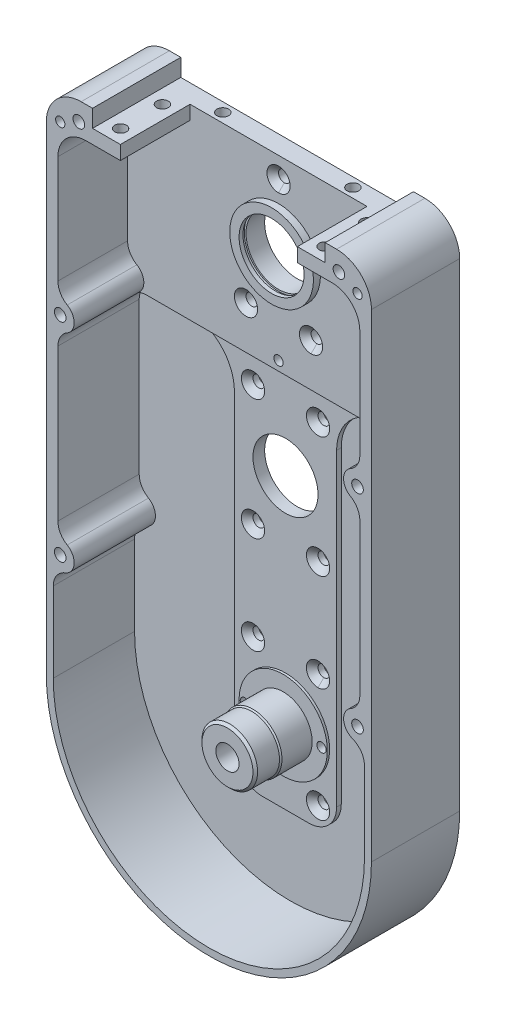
ISO-10303-21;
HEADER;
FILE_DESCRIPTION(('STEP AP214'),'2;1');
FILE_NAME('part.step','',(''),(''),'','','');
FILE_SCHEMA(('AUTOMOTIVE_DESIGN { 1 0 10303 214 1 1 1 1 }'));
ENDSEC;
DATA;
#1=APPLICATION_CONTEXT('core data for automotive mechanical design processes');
#2=APPLICATION_PROTOCOL_DEFINITION('international standard','automotive_design',2000,#1);
#3=PRODUCT_CONTEXT('',#1,'mechanical');
#4=PRODUCT('Part','Part','',(#3));
#5=PRODUCT_RELATED_PRODUCT_CATEGORY('part','',(#4));
#6=PRODUCT_DEFINITION_FORMATION('','',#4);
#7=PRODUCT_DEFINITION_CONTEXT('part definition',#1,'design');
#8=PRODUCT_DEFINITION('design','',#6,#7);
#9=PRODUCT_DEFINITION_SHAPE('','',#8);
#10=(LENGTH_UNIT() NAMED_UNIT(*) SI_UNIT(.MILLI.,.METRE.));
#11=(NAMED_UNIT(*) PLANE_ANGLE_UNIT() SI_UNIT($,.RADIAN.));
#12=(NAMED_UNIT(*) SI_UNIT($,.STERADIAN.) SOLID_ANGLE_UNIT());
#13=UNCERTAINTY_MEASURE_WITH_UNIT(LENGTH_MEASURE(1.E-05),#10,'distance_accuracy_value','');
#14=(GEOMETRIC_REPRESENTATION_CONTEXT(3) GLOBAL_UNCERTAINTY_ASSIGNED_CONTEXT((#13)) GLOBAL_UNIT_ASSIGNED_CONTEXT((#10,
#11,#12)) REPRESENTATION_CONTEXT('',''));
#15=CARTESIAN_POINT('',(0.,0.,0.));
#16=DIRECTION('',(0.,0.,1.));
#17=DIRECTION('',(1.,0.,0.));
#18=AXIS2_PLACEMENT_3D('',#15,#16,#17);
#19=CARTESIAN_POINT('',(0.,0.,11.55));
#20=DIRECTION('',(0.,0.,-1.));
#21=DIRECTION('',(-1.,0.,0.));
#22=AXIS2_PLACEMENT_3D('',#19,#20,#21);
#23=CYLINDRICAL_SURFACE('',#22,14.);
#24=CARTESIAN_POINT('',(0.,0.,9.3));
#25=DIRECTION('',(0.,0.,-1.));
#26=DIRECTION('',(-1.,0.,0.));
#27=AXIS2_PLACEMENT_3D('',#24,#25,#26);
#28=CIRCLE('',#27,14.);
#29=CARTESIAN_POINT('',(-14.,0.,9.3));
#30=VERTEX_POINT('',#29);
#31=EDGE_CURVE('E18',#30,#30,#28,.F.);
#32=ORIENTED_EDGE('',*,*,#31,.F.);
#33=EDGE_LOOP('',(#32));
#34=FACE_BOUND('',#33,.T.);
#35=CARTESIAN_POINT('',(0.,0.,11.));
#36=DIRECTION('',(0.,0.,-1.));
#37=DIRECTION('',(-1.,0.,0.));
#38=AXIS2_PLACEMENT_3D('',#35,#36,#37);
#39=CIRCLE('',#38,14.);
#40=CARTESIAN_POINT('',(-14.,0.,11.));
#41=VERTEX_POINT('',#40);
#42=EDGE_CURVE('E365',#41,#41,#39,.F.);
#43=ORIENTED_EDGE('',*,*,#42,.T.);
#44=EDGE_LOOP('',(#43));
#45=FACE_BOUND('',#44,.T.);
#46=ADVANCED_FACE('F15',(#34,#45),#23,.F.);
#47=CARTESIAN_POINT('',(0.,0.,8.));
#48=DIRECTION('',(0.,0.,1.));
#49=DIRECTION('',(1.,0.,0.));
#50=AXIS2_PLACEMENT_3D('',#47,#48,#49);
#51=PLANE('',#50);
#52=CARTESIAN_POINT('',(-56.,35.5,8.));
#53=DIRECTION('',(0.,0.,1.));
#54=DIRECTION('',(1.,0.,0.));
#55=AXIS2_PLACEMENT_3D('',#52,#53,#54);
#56=CIRCLE('',#55,2.5);
#57=CARTESIAN_POINT('',(-53.5,35.5,8.));
#58=VERTEX_POINT('',#57);
#59=EDGE_CURVE('E462',#58,#58,#56,.T.);
#60=ORIENTED_EDGE('',*,*,#59,.T.);
#61=EDGE_LOOP('',(#60));
#62=FACE_BOUND('',#61,.T.);
#63=ADVANCED_FACE('F1528',(#62),#51,.T.);
#64=CARTESIAN_POINT('',(0.,0.,3.));
#65=DIRECTION('',(0.,0.,1.));
#66=DIRECTION('',(1.,0.,0.));
#67=AXIS2_PLACEMENT_3D('',#64,#65,#66);
#68=PLANE('',#67);
#69=CARTESIAN_POINT('',(64.,-130.,3.));
#70=DIRECTION('',(0.,0.,1.));
#71=DIRECTION('',(1.,0.,0.));
#72=AXIS2_PLACEMENT_3D('',#69,#70,#71);
#73=CIRCLE('',#72,2.5);
#74=CARTESIAN_POINT('',(66.5,-130.,3.));
#75=VERTEX_POINT('',#74);
#76=EDGE_CURVE('E848',#75,#75,#73,.T.);
#77=ORIENTED_EDGE('',*,*,#76,.T.);
#78=EDGE_LOOP('',(#77));
#79=FACE_BOUND('',#78,.T.);
#80=ADVANCED_FACE('F1525',(#79),#68,.T.);
#81=CARTESIAN_POINT('',(0.,0.,3.));
#82=DIRECTION('',(0.,0.,1.));
#83=DIRECTION('',(1.,0.,0.));
#84=AXIS2_PLACEMENT_3D('',#81,#82,#83);
#85=PLANE('',#84);
#86=CARTESIAN_POINT('',(-64.,-130.,3.));
#87=DIRECTION('',(0.,0.,1.));
#88=DIRECTION('',(1.,0.,0.));
#89=AXIS2_PLACEMENT_3D('',#86,#87,#88);
#90=CIRCLE('',#89,2.5);
#91=CARTESIAN_POINT('',(-61.5,-130.,3.));
#92=VERTEX_POINT('',#91);
#93=EDGE_CURVE('E845',#92,#92,#90,.T.);
#94=ORIENTED_EDGE('',*,*,#93,.T.);
#95=EDGE_LOOP('',(#94));
#96=FACE_BOUND('',#95,.T.);
#97=ADVANCED_FACE('F1521',(#96),#85,.T.);
#98=CARTESIAN_POINT('',(0.,0.,8.));
#99=DIRECTION('',(0.,0.,1.));
#100=DIRECTION('',(1.,0.,0.));
#101=AXIS2_PLACEMENT_3D('',#98,#99,#100);
#102=PLANE('',#101);
#103=CARTESIAN_POINT('',(56.,35.5,8.));
#104=DIRECTION('',(0.,0.,1.));
#105=DIRECTION('',(1.,0.,0.));
#106=AXIS2_PLACEMENT_3D('',#103,#104,#105);
#107=CIRCLE('',#106,2.5);
#108=CARTESIAN_POINT('',(58.5,35.5,8.));
#109=VERTEX_POINT('',#108);
#110=EDGE_CURVE('E842',#109,#109,#107,.T.);
#111=ORIENTED_EDGE('',*,*,#110,.T.);
#112=EDGE_LOOP('',(#111));
#113=FACE_BOUND('',#112,.T.);
#114=ADVANCED_FACE('F1517',(#113),#102,.T.);
#115=CARTESIAN_POINT('',(0.,0.,8.));
#116=DIRECTION('',(0.,0.,1.));
#117=DIRECTION('',(1.,0.,0.));
#118=AXIS2_PLACEMENT_3D('',#115,#116,#117);
#119=PLANE('',#118);
#120=CARTESIAN_POINT('',(64.,-40.5,8.));
#121=DIRECTION('',(0.,0.,1.));
#122=DIRECTION('',(1.,0.,0.));
#123=AXIS2_PLACEMENT_3D('',#120,#121,#122);
#124=CIRCLE('',#123,2.5);
#125=CARTESIAN_POINT('',(66.5,-40.5,8.));
#126=VERTEX_POINT('',#125);
#127=EDGE_CURVE('E839',#126,#126,#124,.T.);
#128=ORIENTED_EDGE('',*,*,#127,.T.);
#129=EDGE_LOOP('',(#128));
#130=FACE_BOUND('',#129,.T.);
#131=ADVANCED_FACE('F1513',(#130),#119,.T.);
#132=CARTESIAN_POINT('',(0.,0.,8.));
#133=DIRECTION('',(0.,0.,1.));
#134=DIRECTION('',(1.,0.,0.));
#135=AXIS2_PLACEMENT_3D('',#132,#133,#134);
#136=PLANE('',#135);
#137=CARTESIAN_POINT('',(-64.,-40.5,8.));
#138=DIRECTION('',(0.,0.,1.));
#139=DIRECTION('',(1.,0.,0.));
#140=AXIS2_PLACEMENT_3D('',#137,#138,#139);
#141=CIRCLE('',#140,2.5);
#142=CARTESIAN_POINT('',(-61.5,-40.5,8.));
#143=VERTEX_POINT('',#142);
#144=EDGE_CURVE('E836',#143,#143,#141,.T.);
#145=ORIENTED_EDGE('',*,*,#144,.T.);
#146=EDGE_LOOP('',(#145));
#147=FACE_BOUND('',#146,.T.);
#148=ADVANCED_FACE('F1509',(#147),#136,.T.);
#149=CARTESIAN_POINT('',(0.,0.,8.));
#150=DIRECTION('',(0.,0.,1.));
#151=DIRECTION('',(1.,0.,0.));
#152=AXIS2_PLACEMENT_3D('',#149,#150,#151);
#153=PLANE('',#152);
#154=CARTESIAN_POINT('',(-64.,31.5,8.));
#155=DIRECTION('',(0.,0.,1.));
#156=DIRECTION('',(1.,0.,0.));
#157=AXIS2_PLACEMENT_3D('',#154,#155,#156);
#158=CIRCLE('',#157,2.);
#159=CARTESIAN_POINT('',(-62.,31.5,8.));
#160=VERTEX_POINT('',#159);
#161=EDGE_CURVE('E833',#160,#160,#158,.T.);
#162=ORIENTED_EDGE('',*,*,#161,.T.);
#163=EDGE_LOOP('',(#162));
#164=FACE_BOUND('',#163,.T.);
#165=ADVANCED_FACE('F1505',(#164),#153,.T.);
#166=CARTESIAN_POINT('',(0.,0.,8.));
#167=DIRECTION('',(0.,0.,1.));
#168=DIRECTION('',(1.,0.,0.));
#169=AXIS2_PLACEMENT_3D('',#166,#167,#168);
#170=PLANE('',#169);
#171=CARTESIAN_POINT('',(64.,31.5,8.));
#172=DIRECTION('',(0.,0.,1.));
#173=DIRECTION('',(1.,0.,0.));
#174=AXIS2_PLACEMENT_3D('',#171,#172,#173);
#175=CIRCLE('',#174,2.);
#176=CARTESIAN_POINT('',(66.,31.5,8.));
#177=VERTEX_POINT('',#176);
#178=EDGE_CURVE('E520',#177,#177,#175,.T.);
#179=ORIENTED_EDGE('',*,*,#178,.T.);
#180=EDGE_LOOP('',(#179));
#181=FACE_BOUND('',#180,.T.);
#182=ADVANCED_FACE('F1501',(#181),#170,.T.);
#183=CARTESIAN_POINT('',(0.,-177.5,31.25));
#184=DIRECTION('',(0.,0.,-1.));
#185=DIRECTION('',(-1.,0.,0.));
#186=AXIS2_PLACEMENT_3D('',#183,#184,#185);
#187=CYLINDRICAL_SURFACE('',#186,11.9799999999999);
#188=CARTESIAN_POINT('',(0.,-177.5,19.5751842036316));
#189=DIRECTION('',(0.,0.,-1.));
#190=DIRECTION('',(0.,-1.,0.));
#191=AXIS2_PLACEMENT_3D('',#188,#189,#190);
#192=CIRCLE('',#191,11.9799999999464);
#193=CARTESIAN_POINT('',(0.,-189.479999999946,19.5751842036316));
#194=VERTEX_POINT('',#193);
#195=EDGE_CURVE('E525',#194,#194,#192,.T.);
#196=ORIENTED_EDGE('',*,*,#195,.F.);
#197=EDGE_LOOP('',(#196));
#198=FACE_BOUND('',#197,.T.);
#199=CARTESIAN_POINT('',(0.,-177.5,28.9999999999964));
#200=DIRECTION('',(0.,0.,-1.));
#201=DIRECTION('',(0.,-1.,0.));
#202=AXIS2_PLACEMENT_3D('',#199,#200,#201);
#203=CIRCLE('',#202,11.9800000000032);
#204=CARTESIAN_POINT('',(0.,-189.480000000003,28.9999999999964));
#205=VERTEX_POINT('',#204);
#206=EDGE_CURVE('E516',#205,#205,#203,.F.);
#207=ORIENTED_EDGE('',*,*,#206,.F.);
#208=EDGE_LOOP('',(#207));
#209=FACE_BOUND('',#208,.T.);
#210=ADVANCED_FACE('F1497',(#198,#209),#187,.T.);
#211=CARTESIAN_POINT('',(0.,0.,9.3));
#212=DIRECTION('',(0.,0.,-1.));
#213=DIRECTION('',(-1.,0.,0.));
#214=AXIS2_PLACEMENT_3D('',#211,#212,#213);
#215=PLANE('',#214);
#216=ORIENTED_EDGE('',*,*,#31,.T.);
#217=EDGE_LOOP('',(#216));
#218=FACE_BOUND('',#217,.T.);
#219=CARTESIAN_POINT('',(0.,0.,9.3));
#220=DIRECTION('',(0.,0.,-1.));
#221=DIRECTION('',(-1.,0.,0.));
#222=AXIS2_PLACEMENT_3D('',#219,#220,#221);
#223=CIRCLE('',#222,14.75);
#224=CARTESIAN_POINT('',(-14.75,0.,9.3));
#225=VERTEX_POINT('',#224);
#226=EDGE_CURVE('E519',#225,#225,#223,.T.);
#227=ORIENTED_EDGE('',*,*,#226,.T.);
#228=EDGE_LOOP('',(#227));
#229=FACE_BOUND('',#228,.T.);
#230=ADVANCED_FACE('F1494',(#218,#229),#215,.T.);
#231=CARTESIAN_POINT('',(0.,0.,3.));
#232=DIRECTION('',(0.,0.,1.));
#233=DIRECTION('',(1.,0.,0.));
#234=AXIS2_PLACEMENT_3D('',#231,#232,#233);
#235=PLANE('',#234);
#236=DIRECTION('',(1.,0.,0.));
#237=VECTOR('',#236,1.);
#238=CARTESIAN_POINT('',(-70.,-44.5,3.));
#239=LINE('',#238,#237);
#240=CARTESIAN_POINT('',(-56.9289321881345,-44.5,3.));
#241=VERTEX_POINT('',#240);
#242=CARTESIAN_POINT('',(-42.,-44.5,3.));
#243=VERTEX_POINT('',#242);
#244=EDGE_CURVE('E397',#241,#243,#239,.T.);
#245=ORIENTED_EDGE('',*,*,#244,.F.);
#246=CARTESIAN_POINT('',(-56.9289321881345,-52.,3.));
#247=DIRECTION('',(0.,0.,1.));
#248=DIRECTION('',(1.,0.,0.));
#249=AXIS2_PLACEMENT_3D('',#246,#247,#248);
#250=CIRCLE('',#249,7.5);
#251=CARTESIAN_POINT('',(-60.8573031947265,-45.6111111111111,3.));
#252=VERTEX_POINT('',#251);
#253=EDGE_CURVE('E398',#241,#252,#250,.T.);
#254=ORIENTED_EDGE('',*,*,#253,.T.);
#255=CARTESIAN_POINT('',(-64.,-40.5,3.));
#256=DIRECTION('',(0.,0.,1.));
#257=DIRECTION('',(1.,0.,0.));
#258=AXIS2_PLACEMENT_3D('',#255,#256,#257);
#259=CIRCLE('',#258,6.);
#260=CARTESIAN_POINT('',(-61.,-45.6961524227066,3.));
#261=VERTEX_POINT('',#260);
#262=EDGE_CURVE('E458',#261,#252,#259,.T.);
#263=ORIENTED_EDGE('',*,*,#262,.F.);
#264=CARTESIAN_POINT('',(-57.,-52.6243556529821,3.));
#265=DIRECTION('',(0.,0.,1.));
#266=DIRECTION('',(1.,0.,0.));
#267=AXIS2_PLACEMENT_3D('',#264,#265,#266);
#268=CIRCLE('',#267,8.);
#269=CARTESIAN_POINT('',(-65.,-52.6243556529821,3.));
#270=VERTEX_POINT('',#269);
#271=EDGE_CURVE('E463',#261,#270,#268,.T.);
#272=ORIENTED_EDGE('',*,*,#271,.T.);
#273=DIRECTION('',(0.,1.,0.));
#274=VECTOR('',#273,1.);
#275=CARTESIAN_POINT('',(-65.,-117.875644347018,3.));
#276=LINE('',#275,#274);
#277=CARTESIAN_POINT('',(-65.,-117.875644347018,3.));
#278=VERTEX_POINT('',#277);
#279=EDGE_CURVE('E467',#278,#270,#276,.T.);
#280=ORIENTED_EDGE('',*,*,#279,.F.);
#281=CARTESIAN_POINT('',(-57.,-117.875644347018,3.));
#282=DIRECTION('',(0.,0.,1.));
#283=DIRECTION('',(1.,0.,0.));
#284=AXIS2_PLACEMENT_3D('',#281,#282,#283);
#285=CIRCLE('',#284,8.);
#286=CARTESIAN_POINT('',(-61.,-124.803847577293,3.));
#287=VERTEX_POINT('',#286);
#288=EDGE_CURVE('E471',#278,#287,#285,.T.);
#289=ORIENTED_EDGE('',*,*,#288,.T.);
#290=CARTESIAN_POINT('',(-64.,-130.,3.));
#291=DIRECTION('',(0.,0.,1.));
#292=DIRECTION('',(1.,0.,0.));
#293=AXIS2_PLACEMENT_3D('',#290,#291,#292);
#294=CIRCLE('',#293,6.);
#295=CARTESIAN_POINT('',(-61.8571428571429,-135.604298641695,3.));
#296=VERTEX_POINT('',#295);
#297=EDGE_CURVE('E475',#296,#287,#294,.T.);
#298=ORIENTED_EDGE('',*,*,#297,.F.);
#299=CARTESIAN_POINT('',(-59.,-143.076696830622,3.));
#300=DIRECTION('',(0.,0.,1.));
#301=DIRECTION('',(1.,0.,0.));
#302=AXIS2_PLACEMENT_3D('',#299,#300,#301);
#303=CIRCLE('',#302,8.);
#304=CARTESIAN_POINT('',(-67.,-143.076696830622,3.));
#305=VERTEX_POINT('',#304);
#306=EDGE_CURVE('E479',#296,#305,#303,.T.);
#307=ORIENTED_EDGE('',*,*,#306,.T.);
#308=DIRECTION('',(0.,1.,0.));
#309=VECTOR('',#308,1.);
#310=CARTESIAN_POINT('',(-67.,-177.5,3.));
#311=LINE('',#310,#309);
#312=CARTESIAN_POINT('',(-67.,-177.5,3.));
#313=VERTEX_POINT('',#312);
#314=EDGE_CURVE('E483',#313,#305,#311,.T.);
#315=ORIENTED_EDGE('',*,*,#314,.F.);
#316=CARTESIAN_POINT('',(0.,-177.5,3.));
#317=DIRECTION('',(0.,0.,1.));
#318=DIRECTION('',(1.,0.,0.));
#319=AXIS2_PLACEMENT_3D('',#316,#317,#318);
#320=CIRCLE('',#319,67.);
#321=CARTESIAN_POINT('',(67.,-177.5,3.));
#322=VERTEX_POINT('',#321);
#323=EDGE_CURVE('E487',#313,#322,#320,.T.);
#324=ORIENTED_EDGE('',*,*,#323,.T.);
#325=DIRECTION('',(0.,1.,0.));
#326=VECTOR('',#325,1.);
#327=CARTESIAN_POINT('',(67.,-143.076696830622,3.));
#328=LINE('',#327,#326);
#329=CARTESIAN_POINT('',(67.,-143.076696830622,3.));
#330=VERTEX_POINT('',#329);
#331=EDGE_CURVE('E491',#330,#322,#328,.F.);
#332=ORIENTED_EDGE('',*,*,#331,.F.);
#333=CARTESIAN_POINT('',(59.,-143.076696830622,3.));
#334=DIRECTION('',(0.,0.,1.));
#335=DIRECTION('',(1.,0.,0.));
#336=AXIS2_PLACEMENT_3D('',#333,#334,#335);
#337=CIRCLE('',#336,8.);
#338=CARTESIAN_POINT('',(61.8571428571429,-135.604298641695,3.));
#339=VERTEX_POINT('',#338);
#340=EDGE_CURVE('E495',#330,#339,#337,.T.);
#341=ORIENTED_EDGE('',*,*,#340,.T.);
#342=CARTESIAN_POINT('',(64.,-130.,3.));
#343=DIRECTION('',(0.,0.,1.));
#344=DIRECTION('',(1.,0.,0.));
#345=AXIS2_PLACEMENT_3D('',#342,#343,#344);
#346=CIRCLE('',#345,6.);
#347=CARTESIAN_POINT('',(61.,-124.803847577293,3.));
#348=VERTEX_POINT('',#347);
#349=EDGE_CURVE('E499',#348,#339,#346,.T.);
#350=ORIENTED_EDGE('',*,*,#349,.F.);
#351=CARTESIAN_POINT('',(57.,-117.875644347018,3.));
#352=DIRECTION('',(0.,0.,1.));
#353=DIRECTION('',(1.,0.,0.));
#354=AXIS2_PLACEMENT_3D('',#351,#352,#353);
#355=CIRCLE('',#354,8.);
#356=CARTESIAN_POINT('',(65.,-117.875644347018,3.));
#357=VERTEX_POINT('',#356);
#358=EDGE_CURVE('E503',#348,#357,#355,.T.);
#359=ORIENTED_EDGE('',*,*,#358,.T.);
#360=DIRECTION('',(0.,1.,0.));
#361=VECTOR('',#360,1.);
#362=CARTESIAN_POINT('',(65.,-52.6243556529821,3.));
#363=LINE('',#362,#361);
#364=CARTESIAN_POINT('',(65.,-52.6243556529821,3.));
#365=VERTEX_POINT('',#364);
#366=EDGE_CURVE('E507',#365,#357,#363,.F.);
#367=ORIENTED_EDGE('',*,*,#366,.F.);
#368=CARTESIAN_POINT('',(57.,-52.6243556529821,3.));
#369=DIRECTION('',(0.,0.,1.));
#370=DIRECTION('',(1.,0.,0.));
#371=AXIS2_PLACEMENT_3D('',#368,#369,#370);
#372=CIRCLE('',#371,8.);
#373=CARTESIAN_POINT('',(61.,-45.6961524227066,3.));
#374=VERTEX_POINT('',#373);
#375=EDGE_CURVE('E363',#365,#374,#372,.T.);
#376=ORIENTED_EDGE('',*,*,#375,.T.);
#377=CARTESIAN_POINT('',(64.,-40.5,3.));
#378=DIRECTION('',(0.,0.,1.));
#379=DIRECTION('',(1.,0.,0.));
#380=AXIS2_PLACEMENT_3D('',#377,#378,#379);
#381=CIRCLE('',#380,6.);
#382=CARTESIAN_POINT('',(60.8573031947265,-45.6111111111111,3.));
#383=VERTEX_POINT('',#382);
#384=EDGE_CURVE('E353',#374,#383,#381,.F.);
#385=ORIENTED_EDGE('',*,*,#384,.T.);
#386=CARTESIAN_POINT('',(56.9289321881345,-52.,3.));
#387=DIRECTION('',(0.,0.,-1.));
#388=DIRECTION('',(-1.,0.,0.));
#389=AXIS2_PLACEMENT_3D('',#386,#387,#388);
#390=CIRCLE('',#389,7.5);
#391=CARTESIAN_POINT('',(56.9289321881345,-44.5,3.));
#392=VERTEX_POINT('',#391);
#393=EDGE_CURVE('E361',#383,#392,#390,.F.);
#394=ORIENTED_EDGE('',*,*,#393,.T.);
#395=DIRECTION('',(1.,0.,0.));
#396=VECTOR('',#395,1.);
#397=CARTESIAN_POINT('',(-70.,-44.5,3.));
#398=LINE('',#397,#396);
#399=CARTESIAN_POINT('',(42.,-44.5,3.));
#400=VERTEX_POINT('',#399);
#401=EDGE_CURVE('E393',#400,#392,#398,.T.);
#402=ORIENTED_EDGE('',*,*,#401,.F.);
#403=CARTESIAN_POINT('',(42.,-64.5,3.));
#404=DIRECTION('',(0.,0.,1.));
#405=DIRECTION('',(1.,0.,0.));
#406=AXIS2_PLACEMENT_3D('',#403,#404,#405);
#407=CIRCLE('',#406,20.);
#408=CARTESIAN_POINT('',(22.,-64.5,3.));
#409=VERTEX_POINT('',#408);
#410=EDGE_CURVE('E429',#400,#409,#407,.T.);
#411=ORIENTED_EDGE('',*,*,#410,.T.);
#412=DIRECTION('',(0.,1.,0.));
#413=VECTOR('',#412,1.);
#414=CARTESIAN_POINT('',(22.,-197.5,3.));
#415=LINE('',#414,#413);
#416=CARTESIAN_POINT('',(22.,-197.5,3.));
#417=VERTEX_POINT('',#416);
#418=EDGE_CURVE('E433',#417,#409,#415,.T.);
#419=ORIENTED_EDGE('',*,*,#418,.F.);
#420=CARTESIAN_POINT('',(10.,-197.5,3.));
#421=DIRECTION('',(0.,0.,1.));
#422=DIRECTION('',(1.,0.,0.));
#423=AXIS2_PLACEMENT_3D('',#420,#421,#422);
#424=CIRCLE('',#423,12.);
#425=CARTESIAN_POINT('',(10.,-209.5,3.));
#426=VERTEX_POINT('',#425);
#427=EDGE_CURVE('E434',#426,#417,#424,.T.);
#428=ORIENTED_EDGE('',*,*,#427,.F.);
#429=DIRECTION('',(1.,0.,0.));
#430=VECTOR('',#429,1.);
#431=CARTESIAN_POINT('',(-10.,-209.5,3.));
#432=LINE('',#431,#430);
#433=CARTESIAN_POINT('',(-10.,-209.5,3.));
#434=VERTEX_POINT('',#433);
#435=EDGE_CURVE('E438',#434,#426,#432,.T.);
#436=ORIENTED_EDGE('',*,*,#435,.F.);
#437=CARTESIAN_POINT('',(-10.,-197.5,3.));
#438=DIRECTION('',(0.,0.,1.));
#439=DIRECTION('',(1.,0.,0.));
#440=AXIS2_PLACEMENT_3D('',#437,#438,#439);
#441=CIRCLE('',#440,12.);
#442=CARTESIAN_POINT('',(-22.,-197.5,3.));
#443=VERTEX_POINT('',#442);
#444=EDGE_CURVE('E442',#443,#434,#441,.T.);
#445=ORIENTED_EDGE('',*,*,#444,.F.);
#446=DIRECTION('',(0.,1.,0.));
#447=VECTOR('',#446,1.);
#448=CARTESIAN_POINT('',(-22.,-64.5,3.));
#449=LINE('',#448,#447);
#450=CARTESIAN_POINT('',(-22.,-64.5,3.));
#451=VERTEX_POINT('',#450);
#452=EDGE_CURVE('E446',#451,#443,#449,.F.);
#453=ORIENTED_EDGE('',*,*,#452,.F.);
#454=CARTESIAN_POINT('',(-42.,-64.5,3.));
#455=DIRECTION('',(0.,0.,1.));
#456=DIRECTION('',(1.,0.,0.));
#457=AXIS2_PLACEMENT_3D('',#454,#455,#456);
#458=CIRCLE('',#457,20.);
#459=EDGE_CURVE('E450',#451,#243,#458,.T.);
#460=ORIENTED_EDGE('',*,*,#459,.T.);
#461=EDGE_LOOP('',(#245,#254,#263,#272,#280,#289,#298,#307,#315,#324,#332,#341,#350,#359,#367,
#376,#385,#394,#402,#411,#419,#428,#436,#445,#453,#460));
#462=FACE_BOUND('',#461,.T.);
#463=ADVANCED_FACE('F359',(#462),#235,.T.);
#464=CARTESIAN_POINT('',(0.,0.,11.));
#465=DIRECTION('',(0.,0.,-1.));
#466=DIRECTION('',(-1.,0.,0.));
#467=AXIS2_PLACEMENT_3D('',#464,#465,#466);
#468=PLANE('',#467);
#469=ORIENTED_EDGE('',*,*,#42,.F.);
#470=EDGE_LOOP('',(#469));
#471=FACE_BOUND('',#470,.T.);
#472=CARTESIAN_POINT('',(0.,0.,11.));
#473=DIRECTION('',(0.,0.,-1.));
#474=DIRECTION('',(-1.,0.,0.));
#475=AXIS2_PLACEMENT_3D('',#472,#473,#474);
#476=CIRCLE('',#475,18.);
#477=CARTESIAN_POINT('',(-18.,0.,11.));
#478=VERTEX_POINT('',#477);
#479=EDGE_CURVE('E380',#478,#478,#476,.T.);
#480=ORIENTED_EDGE('',*,*,#479,.F.);
#481=EDGE_LOOP('',(#480));
#482=FACE_BOUND('',#481,.T.);
#483=ADVANCED_FACE('F872',(#471,#482),#468,.F.);
#484=CARTESIAN_POINT('',(0.,-177.5,19.0000000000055));
#485=DIRECTION('',(0.,0.,-1.));
#486=DIRECTION('',(-1.,0.,0.));
#487=AXIS2_PLACEMENT_3D('',#484,#485,#486);
#488=CONICAL_SURFACE('',#487,12.4799999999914,0.715584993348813);
#489=ORIENTED_EDGE('',*,*,#195,.T.);
#490=EDGE_LOOP('',(#489));
#491=FACE_BOUND('',#490,.T.);
#492=CARTESIAN_POINT('',(0.,-177.5,19.));
#493=DIRECTION('',(0.,0.,-1.));
#494=DIRECTION('',(-1.,0.,0.));
#495=AXIS2_PLACEMENT_3D('',#492,#493,#494);
#496=CIRCLE('',#495,12.48);
#497=CARTESIAN_POINT('',(-12.48,-177.5,19.));
#498=VERTEX_POINT('',#497);
#499=EDGE_CURVE('E384',#498,#498,#496,.T.);
#500=ORIENTED_EDGE('',*,*,#499,.F.);
#501=EDGE_LOOP('',(#500));
#502=FACE_BOUND('',#501,.T.);
#503=ADVANCED_FACE('F875',(#491,#502),#488,.T.);
#504=CARTESIAN_POINT('',(0.,16.,0.));
#505=DIRECTION('',(0.,1.,0.));
#506=DIRECTION('',(0.,0.,1.));
#507=AXIS2_PLACEMENT_3D('',#504,#505,#506);
#508=PLANE('',#507);
#509=CARTESIAN_POINT('',(28.,16.,4.));
#510=DIRECTION('',(0.,1.,0.));
#511=DIRECTION('',(0.,0.,1.));
#512=AXIS2_PLACEMENT_3D('',#509,#510,#511);
#513=CIRCLE('',#512,2.5);
#514=CARTESIAN_POINT('',(28.,16.,6.5));
#515=VERTEX_POINT('',#514);
#516=EDGE_CURVE('E417',#515,#515,#513,.T.);
#517=ORIENTED_EDGE('',*,*,#516,.T.);
#518=EDGE_LOOP('',(#517));
#519=FACE_BOUND('',#518,.T.);
#520=ADVANCED_FACE('F1484',(#519),#508,.T.);
#521=CARTESIAN_POINT('',(0.,16.,0.));
#522=DIRECTION('',(0.,1.,0.));
#523=DIRECTION('',(0.,0.,1.));
#524=AXIS2_PLACEMENT_3D('',#521,#522,#523);
#525=PLANE('',#524);
#526=CARTESIAN_POINT('',(-28.,16.,4.));
#527=DIRECTION('',(0.,1.,0.));
#528=DIRECTION('',(0.,0.,1.));
#529=AXIS2_PLACEMENT_3D('',#526,#527,#528);
#530=CIRCLE('',#529,2.5);
#531=CARTESIAN_POINT('',(-28.,16.,6.5));
#532=VERTEX_POINT('',#531);
#533=EDGE_CURVE('E815',#532,#532,#530,.T.);
#534=ORIENTED_EDGE('',*,*,#533,.T.);
#535=EDGE_LOOP('',(#534));
#536=FACE_BOUND('',#535,.T.);
#537=ADVANCED_FACE('F1480',(#536),#525,.T.);
#538=CARTESIAN_POINT('',(57.,-52.6243556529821,3.));
#539=DIRECTION('',(0.,0.,1.));
#540=DIRECTION('',(1.,0.,0.));
#541=AXIS2_PLACEMENT_3D('',#538,#539,#540);
#542=CYLINDRICAL_SURFACE('',#541,8.);
#543=CARTESIAN_POINT('',(57.,-52.6243556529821,38.));
#544=DIRECTION('',(0.,0.,1.));
#545=DIRECTION('',(1.,0.,0.));
#546=AXIS2_PLACEMENT_3D('',#543,#544,#545);
#547=CIRCLE('',#546,8.);
#548=CARTESIAN_POINT('',(61.,-45.6961524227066,38.));
#549=VERTEX_POINT('',#548);
#550=CARTESIAN_POINT('',(65.,-52.6243556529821,38.));
#551=VERTEX_POINT('',#550);
#552=EDGE_CURVE('E790',#549,#551,#547,.F.);
#553=ORIENTED_EDGE('',*,*,#552,.F.);
#554=DIRECTION('',(0.,0.,1.));
#555=VECTOR('',#554,1.);
#556=CARTESIAN_POINT('',(61.,-45.6961524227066,3.));
#557=LINE('',#556,#555);
#558=EDGE_CURVE('E386',#374,#549,#557,.T.);
#559=ORIENTED_EDGE('',*,*,#558,.F.);
#560=ORIENTED_EDGE('',*,*,#375,.F.);
#561=DIRECTION('',(0.,0.,1.));
#562=VECTOR('',#561,1.);
#563=CARTESIAN_POINT('',(65.,-52.6243556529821,3.));
#564=LINE('',#563,#562);
#565=EDGE_CURVE('E504',#551,#365,#564,.F.);
#566=ORIENTED_EDGE('',*,*,#565,.F.);
#567=EDGE_LOOP('',(#553,#559,#560,#566));
#568=FACE_BOUND('',#567,.T.);
#569=ADVANCED_FACE('F1476',(#568),#542,.F.);
#570=CARTESIAN_POINT('',(65.,-52.6243556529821,3.));
#571=DIRECTION('',(-1.,0.,0.));
#572=DIRECTION('',(0.,0.,1.));
#573=AXIS2_PLACEMENT_3D('',#570,#571,#572);
#574=PLANE('',#573);
#575=ORIENTED_EDGE('',*,*,#565,.T.);
#576=ORIENTED_EDGE('',*,*,#366,.T.);
#577=DIRECTION('',(0.,0.,1.));
#578=VECTOR('',#577,1.);
#579=CARTESIAN_POINT('',(65.,-117.875644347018,3.));
#580=LINE('',#579,#578);
#581=CARTESIAN_POINT('',(65.,-117.875644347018,38.));
#582=VERTEX_POINT('',#581);
#583=EDGE_CURVE('E500',#357,#582,#580,.T.);
#584=ORIENTED_EDGE('',*,*,#583,.T.);
#585=DIRECTION('',(0.,1.,0.));
#586=VECTOR('',#585,1.);
#587=CARTESIAN_POINT('',(65.,0.,38.));
#588=LINE('',#587,#586);
#589=EDGE_CURVE('E789',#551,#582,#588,.F.);
#590=ORIENTED_EDGE('',*,*,#589,.F.);
#591=EDGE_LOOP('',(#575,#576,#584,#590));
#592=FACE_BOUND('',#591,.T.);
#593=ADVANCED_FACE('F1472',(#592),#574,.T.);
#594=CARTESIAN_POINT('',(57.,-117.875644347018,3.));
#595=DIRECTION('',(0.,0.,1.));
#596=DIRECTION('',(1.,0.,0.));
#597=AXIS2_PLACEMENT_3D('',#594,#595,#596);
#598=CYLINDRICAL_SURFACE('',#597,8.);
#599=CARTESIAN_POINT('',(57.,-117.875644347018,38.));
#600=DIRECTION('',(0.,0.,1.));
#601=DIRECTION('',(1.,0.,0.));
#602=AXIS2_PLACEMENT_3D('',#599,#600,#601);
#603=CIRCLE('',#602,8.);
#604=CARTESIAN_POINT('',(61.,-124.803847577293,38.));
#605=VERTEX_POINT('',#604);
#606=EDGE_CURVE('E787',#582,#605,#603,.F.);
#607=ORIENTED_EDGE('',*,*,#606,.F.);
#608=ORIENTED_EDGE('',*,*,#583,.F.);
#609=ORIENTED_EDGE('',*,*,#358,.F.);
#610=DIRECTION('',(0.,0.,1.));
#611=VECTOR('',#610,1.);
#612=CARTESIAN_POINT('',(61.,-124.803847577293,3.));
#613=LINE('',#612,#611);
#614=EDGE_CURVE('E496',#605,#348,#613,.F.);
#615=ORIENTED_EDGE('',*,*,#614,.F.);
#616=EDGE_LOOP('',(#607,#608,#609,#615));
#617=FACE_BOUND('',#616,.T.);
#618=ADVANCED_FACE('F1468',(#617),#598,.F.);
#619=CARTESIAN_POINT('',(64.,-130.,3.));
#620=DIRECTION('',(0.,0.,1.));
#621=DIRECTION('',(1.,0.,0.));
#622=AXIS2_PLACEMENT_3D('',#619,#620,#621);
#623=CYLINDRICAL_SURFACE('',#622,6.);
#624=ORIENTED_EDGE('',*,*,#614,.T.);
#625=ORIENTED_EDGE('',*,*,#349,.T.);
#626=DIRECTION('',(0.,0.,1.));
#627=VECTOR('',#626,1.);
#628=CARTESIAN_POINT('',(61.8571428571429,-135.604298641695,3.));
#629=LINE('',#628,#627);
#630=CARTESIAN_POINT('',(61.8571428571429,-135.604298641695,38.));
#631=VERTEX_POINT('',#630);
#632=EDGE_CURVE('E492',#339,#631,#629,.T.);
#633=ORIENTED_EDGE('',*,*,#632,.T.);
#634=CARTESIAN_POINT('',(64.,-130.,38.));
#635=DIRECTION('',(0.,0.,1.));
#636=DIRECTION('',(1.,0.,0.));
#637=AXIS2_PLACEMENT_3D('',#634,#635,#636);
#638=CIRCLE('',#637,6.);
#639=EDGE_CURVE('E785',#605,#631,#638,.T.);
#640=ORIENTED_EDGE('',*,*,#639,.F.);
#641=EDGE_LOOP('',(#624,#625,#633,#640));
#642=FACE_BOUND('',#641,.T.);
#643=ADVANCED_FACE('F1464',(#642),#623,.T.);
#644=CARTESIAN_POINT('',(59.,-143.076696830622,3.));
#645=DIRECTION('',(0.,0.,1.));
#646=DIRECTION('',(1.,0.,0.));
#647=AXIS2_PLACEMENT_3D('',#644,#645,#646);
#648=CYLINDRICAL_SURFACE('',#647,8.);
#649=CARTESIAN_POINT('',(59.,-143.076696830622,38.));
#650=DIRECTION('',(0.,0.,1.));
#651=DIRECTION('',(1.,0.,0.));
#652=AXIS2_PLACEMENT_3D('',#649,#650,#651);
#653=CIRCLE('',#652,8.);
#654=CARTESIAN_POINT('',(67.,-143.076696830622,38.));
#655=VERTEX_POINT('',#654);
#656=EDGE_CURVE('E783',#631,#655,#653,.F.);
#657=ORIENTED_EDGE('',*,*,#656,.F.);
#658=ORIENTED_EDGE('',*,*,#632,.F.);
#659=ORIENTED_EDGE('',*,*,#340,.F.);
#660=DIRECTION('',(0.,0.,1.));
#661=VECTOR('',#660,1.);
#662=CARTESIAN_POINT('',(67.,-143.076696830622,3.));
#663=LINE('',#662,#661);
#664=EDGE_CURVE('E488',#655,#330,#663,.F.);
#665=ORIENTED_EDGE('',*,*,#664,.F.);
#666=EDGE_LOOP('',(#657,#658,#659,#665));
#667=FACE_BOUND('',#666,.T.);
#668=ADVANCED_FACE('F1460',(#667),#648,.F.);
#669=CARTESIAN_POINT('',(67.,-143.076696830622,3.));
#670=DIRECTION('',(-1.,0.,0.));
#671=DIRECTION('',(0.,0.,1.));
#672=AXIS2_PLACEMENT_3D('',#669,#670,#671);
#673=PLANE('',#672);
#674=ORIENTED_EDGE('',*,*,#664,.T.);
#675=ORIENTED_EDGE('',*,*,#331,.T.);
#676=DIRECTION('',(0.,0.,1.));
#677=VECTOR('',#676,1.);
#678=CARTESIAN_POINT('',(67.,-177.5,3.));
#679=LINE('',#678,#677);
#680=CARTESIAN_POINT('',(67.,-177.5,38.));
#681=VERTEX_POINT('',#680);
#682=EDGE_CURVE('E484',#322,#681,#679,.T.);
#683=ORIENTED_EDGE('',*,*,#682,.T.);
#684=DIRECTION('',(0.,1.,0.));
#685=VECTOR('',#684,1.);
#686=CARTESIAN_POINT('',(67.,0.,38.));
#687=LINE('',#686,#685);
#688=EDGE_CURVE('E782',#655,#681,#687,.F.);
#689=ORIENTED_EDGE('',*,*,#688,.F.);
#690=EDGE_LOOP('',(#674,#675,#683,#689));
#691=FACE_BOUND('',#690,.T.);
#692=ADVANCED_FACE('F1456',(#691),#673,.T.);
#693=CARTESIAN_POINT('',(0.,-177.5,3.));
#694=DIRECTION('',(0.,0.,1.));
#695=DIRECTION('',(1.,0.,0.));
#696=AXIS2_PLACEMENT_3D('',#693,#694,#695);
#697=CYLINDRICAL_SURFACE('',#696,67.);
#698=CARTESIAN_POINT('',(0.,-177.5,38.));
#699=DIRECTION('',(0.,0.,1.));
#700=DIRECTION('',(1.,0.,0.));
#701=AXIS2_PLACEMENT_3D('',#698,#699,#700);
#702=CIRCLE('',#701,67.);
#703=CARTESIAN_POINT('',(-67.,-177.5,38.));
#704=VERTEX_POINT('',#703);
#705=EDGE_CURVE('E780',#681,#704,#702,.F.);
#706=ORIENTED_EDGE('',*,*,#705,.F.);
#707=ORIENTED_EDGE('',*,*,#682,.F.);
#708=ORIENTED_EDGE('',*,*,#323,.F.);
#709=DIRECTION('',(0.,0.,-1.));
#710=VECTOR('',#709,1.);
#711=CARTESIAN_POINT('',(-67.,-177.5,3.));
#712=LINE('',#711,#710);
#713=EDGE_CURVE('E480',#704,#313,#712,.T.);
#714=ORIENTED_EDGE('',*,*,#713,.F.);
#715=EDGE_LOOP('',(#706,#707,#708,#714));
#716=FACE_BOUND('',#715,.T.);
#717=ADVANCED_FACE('F1452',(#716),#697,.F.);
#718=CARTESIAN_POINT('',(-67.,-177.5,3.));
#719=DIRECTION('',(1.,0.,0.));
#720=DIRECTION('',(0.,0.,-1.));
#721=AXIS2_PLACEMENT_3D('',#718,#719,#720);
#722=PLANE('',#721);
#723=ORIENTED_EDGE('',*,*,#713,.T.);
#724=ORIENTED_EDGE('',*,*,#314,.T.);
#725=DIRECTION('',(0.,0.,1.));
#726=VECTOR('',#725,1.);
#727=CARTESIAN_POINT('',(-67.,-143.076696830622,3.));
#728=LINE('',#727,#726);
#729=CARTESIAN_POINT('',(-67.,-143.076696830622,38.));
#730=VERTEX_POINT('',#729);
#731=EDGE_CURVE('E476',#305,#730,#728,.T.);
#732=ORIENTED_EDGE('',*,*,#731,.T.);
#733=DIRECTION('',(0.,1.,0.));
#734=VECTOR('',#733,1.);
#735=CARTESIAN_POINT('',(-67.,0.,38.));
#736=LINE('',#735,#734);
#737=EDGE_CURVE('E779',#704,#730,#736,.T.);
#738=ORIENTED_EDGE('',*,*,#737,.F.);
#739=EDGE_LOOP('',(#723,#724,#732,#738));
#740=FACE_BOUND('',#739,.T.);
#741=ADVANCED_FACE('F1448',(#740),#722,.T.);
#742=CARTESIAN_POINT('',(-59.,-143.076696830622,3.));
#743=DIRECTION('',(0.,0.,1.));
#744=DIRECTION('',(1.,0.,0.));
#745=AXIS2_PLACEMENT_3D('',#742,#743,#744);
#746=CYLINDRICAL_SURFACE('',#745,8.);
#747=CARTESIAN_POINT('',(-59.,-143.076696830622,38.));
#748=DIRECTION('',(0.,0.,1.));
#749=DIRECTION('',(1.,0.,0.));
#750=AXIS2_PLACEMENT_3D('',#747,#748,#749);
#751=CIRCLE('',#750,8.);
#752=CARTESIAN_POINT('',(-61.8571428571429,-135.604298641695,38.));
#753=VERTEX_POINT('',#752);
#754=EDGE_CURVE('E777',#730,#753,#751,.F.);
#755=ORIENTED_EDGE('',*,*,#754,.F.);
#756=ORIENTED_EDGE('',*,*,#731,.F.);
#757=ORIENTED_EDGE('',*,*,#306,.F.);
#758=DIRECTION('',(0.,0.,1.));
#759=VECTOR('',#758,1.);
#760=CARTESIAN_POINT('',(-61.8571428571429,-135.604298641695,3.));
#761=LINE('',#760,#759);
#762=EDGE_CURVE('E472',#753,#296,#761,.F.);
#763=ORIENTED_EDGE('',*,*,#762,.F.);
#764=EDGE_LOOP('',(#755,#756,#757,#763));
#765=FACE_BOUND('',#764,.T.);
#766=ADVANCED_FACE('F1444',(#765),#746,.F.);
#767=CARTESIAN_POINT('',(-64.,-130.,3.));
#768=DIRECTION('',(0.,0.,1.));
#769=DIRECTION('',(1.,0.,0.));
#770=AXIS2_PLACEMENT_3D('',#767,#768,#769);
#771=CYLINDRICAL_SURFACE('',#770,6.);
#772=ORIENTED_EDGE('',*,*,#762,.T.);
#773=ORIENTED_EDGE('',*,*,#297,.T.);
#774=DIRECTION('',(0.,0.,1.));
#775=VECTOR('',#774,1.);
#776=CARTESIAN_POINT('',(-61.,-124.803847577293,3.));
#777=LINE('',#776,#775);
#778=CARTESIAN_POINT('',(-61.,-124.803847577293,38.));
#779=VERTEX_POINT('',#778);
#780=EDGE_CURVE('E468',#287,#779,#777,.T.);
#781=ORIENTED_EDGE('',*,*,#780,.T.);
#782=CARTESIAN_POINT('',(-64.,-130.,38.));
#783=DIRECTION('',(0.,0.,1.));
#784=DIRECTION('',(1.,0.,0.));
#785=AXIS2_PLACEMENT_3D('',#782,#783,#784);
#786=CIRCLE('',#785,6.);
#787=EDGE_CURVE('E775',#753,#779,#786,.T.);
#788=ORIENTED_EDGE('',*,*,#787,.F.);
#789=EDGE_LOOP('',(#772,#773,#781,#788));
#790=FACE_BOUND('',#789,.T.);
#791=ADVANCED_FACE('F1440',(#790),#771,.T.);
#792=CARTESIAN_POINT('',(-57.,-117.875644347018,3.));
#793=DIRECTION('',(0.,0.,1.));
#794=DIRECTION('',(1.,0.,0.));
#795=AXIS2_PLACEMENT_3D('',#792,#793,#794);
#796=CYLINDRICAL_SURFACE('',#795,8.);
#797=CARTESIAN_POINT('',(-57.,-117.875644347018,38.));
#798=DIRECTION('',(0.,0.,1.));
#799=DIRECTION('',(1.,0.,0.));
#800=AXIS2_PLACEMENT_3D('',#797,#798,#799);
#801=CIRCLE('',#800,8.);
#802=CARTESIAN_POINT('',(-65.,-117.875644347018,38.));
#803=VERTEX_POINT('',#802);
#804=EDGE_CURVE('E773',#779,#803,#801,.F.);
#805=ORIENTED_EDGE('',*,*,#804,.F.);
#806=ORIENTED_EDGE('',*,*,#780,.F.);
#807=ORIENTED_EDGE('',*,*,#288,.F.);
#808=DIRECTION('',(0.,0.,-1.));
#809=VECTOR('',#808,1.);
#810=CARTESIAN_POINT('',(-65.,-117.875644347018,3.));
#811=LINE('',#810,#809);
#812=EDGE_CURVE('E464',#803,#278,#811,.T.);
#813=ORIENTED_EDGE('',*,*,#812,.F.);
#814=EDGE_LOOP('',(#805,#806,#807,#813));
#815=FACE_BOUND('',#814,.T.);
#816=ADVANCED_FACE('F1436',(#815),#796,.F.);
#817=CARTESIAN_POINT('',(-65.,-117.875644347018,3.));
#818=DIRECTION('',(1.,0.,0.));
#819=DIRECTION('',(0.,0.,-1.));
#820=AXIS2_PLACEMENT_3D('',#817,#818,#819);
#821=PLANE('',#820);
#822=ORIENTED_EDGE('',*,*,#812,.T.);
#823=ORIENTED_EDGE('',*,*,#279,.T.);
#824=DIRECTION('',(0.,0.,1.));
#825=VECTOR('',#824,1.);
#826=CARTESIAN_POINT('',(-65.,-52.6243556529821,3.));
#827=LINE('',#826,#825);
#828=CARTESIAN_POINT('',(-65.,-52.6243556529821,38.));
#829=VERTEX_POINT('',#828);
#830=EDGE_CURVE('E459',#270,#829,#827,.T.);
#831=ORIENTED_EDGE('',*,*,#830,.T.);
#832=DIRECTION('',(0.,1.,0.));
#833=VECTOR('',#832,1.);
#834=CARTESIAN_POINT('',(-65.,0.,38.));
#835=LINE('',#834,#833);
#836=EDGE_CURVE('E772',#803,#829,#835,.T.);
#837=ORIENTED_EDGE('',*,*,#836,.F.);
#838=EDGE_LOOP('',(#822,#823,#831,#837));
#839=FACE_BOUND('',#838,.T.);
#840=ADVANCED_FACE('F1432',(#839),#821,.T.);
#841=CARTESIAN_POINT('',(-57.,-52.6243556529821,3.));
#842=DIRECTION('',(0.,0.,1.));
#843=DIRECTION('',(1.,0.,0.));
#844=AXIS2_PLACEMENT_3D('',#841,#842,#843);
#845=CYLINDRICAL_SURFACE('',#844,8.);
#846=CARTESIAN_POINT('',(-57.,-52.6243556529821,38.));
#847=DIRECTION('',(0.,0.,1.));
#848=DIRECTION('',(1.,0.,0.));
#849=AXIS2_PLACEMENT_3D('',#846,#847,#848);
#850=CIRCLE('',#849,8.);
#851=CARTESIAN_POINT('',(-61.,-45.6961524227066,38.));
#852=VERTEX_POINT('',#851);
#853=EDGE_CURVE('E770',#829,#852,#850,.F.);
#854=ORIENTED_EDGE('',*,*,#853,.F.);
#855=ORIENTED_EDGE('',*,*,#830,.F.);
#856=ORIENTED_EDGE('',*,*,#271,.F.);
#857=DIRECTION('',(0.,0.,1.));
#858=VECTOR('',#857,1.);
#859=CARTESIAN_POINT('',(-61.,-45.6961524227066,3.));
#860=LINE('',#859,#858);
#861=EDGE_CURVE('E401',#852,#261,#860,.F.);
#862=ORIENTED_EDGE('',*,*,#861,.F.);
#863=EDGE_LOOP('',(#854,#855,#856,#862));
#864=FACE_BOUND('',#863,.T.);
#865=ADVANCED_FACE('F1428',(#864),#845,.F.);
#866=CARTESIAN_POINT('',(-56.,35.5,3.));
#867=DIRECTION('',(0.,0.,1.));
#868=DIRECTION('',(1.,0.,0.));
#869=AXIS2_PLACEMENT_3D('',#866,#867,#868);
#870=CYLINDRICAL_SURFACE('',#869,2.5);
#871=CARTESIAN_POINT('',(-56.,35.5,38.));
#872=DIRECTION('',(0.,0.,1.));
#873=DIRECTION('',(1.,0.,0.));
#874=AXIS2_PLACEMENT_3D('',#871,#872,#873);
#875=CIRCLE('',#874,2.5);
#876=CARTESIAN_POINT('',(-53.5,35.5,38.));
#877=VERTEX_POINT('',#876);
#878=EDGE_CURVE('E755',#877,#877,#875,.F.);
#879=ORIENTED_EDGE('',*,*,#878,.F.);
#880=EDGE_LOOP('',(#879));
#881=FACE_BOUND('',#880,.T.);
#882=ORIENTED_EDGE('',*,*,#59,.F.);
#883=EDGE_LOOP('',(#882));
#884=FACE_BOUND('',#883,.T.);
#885=ADVANCED_FACE('F1424',(#881,#884),#870,.F.);
#886=CARTESIAN_POINT('',(64.,-130.,3.));
#887=DIRECTION('',(0.,0.,1.));
#888=DIRECTION('',(1.,0.,0.));
#889=AXIS2_PLACEMENT_3D('',#886,#887,#888);
#890=CYLINDRICAL_SURFACE('',#889,2.5);
#891=CARTESIAN_POINT('',(64.,-130.,38.));
#892=DIRECTION('',(0.,0.,1.));
#893=DIRECTION('',(1.,0.,0.));
#894=AXIS2_PLACEMENT_3D('',#891,#892,#893);
#895=CIRCLE('',#894,2.5);
#896=CARTESIAN_POINT('',(66.5,-130.,38.));
#897=VERTEX_POINT('',#896);
#898=EDGE_CURVE('E752',#897,#897,#895,.F.);
#899=ORIENTED_EDGE('',*,*,#898,.F.);
#900=EDGE_LOOP('',(#899));
#901=FACE_BOUND('',#900,.T.);
#902=ORIENTED_EDGE('',*,*,#76,.F.);
#903=EDGE_LOOP('',(#902));
#904=FACE_BOUND('',#903,.T.);
#905=ADVANCED_FACE('F1420',(#901,#904),#890,.F.);
#906=CARTESIAN_POINT('',(-64.,-130.,3.));
#907=DIRECTION('',(0.,0.,1.));
#908=DIRECTION('',(1.,0.,0.));
#909=AXIS2_PLACEMENT_3D('',#906,#907,#908);
#910=CYLINDRICAL_SURFACE('',#909,2.5);
#911=CARTESIAN_POINT('',(-64.,-130.,38.));
#912=DIRECTION('',(0.,0.,1.));
#913=DIRECTION('',(1.,0.,0.));
#914=AXIS2_PLACEMENT_3D('',#911,#912,#913);
#915=CIRCLE('',#914,2.5);
#916=CARTESIAN_POINT('',(-61.5,-130.,38.));
#917=VERTEX_POINT('',#916);
#918=EDGE_CURVE('E749',#917,#917,#915,.F.);
#919=ORIENTED_EDGE('',*,*,#918,.F.);
#920=EDGE_LOOP('',(#919));
#921=FACE_BOUND('',#920,.T.);
#922=ORIENTED_EDGE('',*,*,#93,.F.);
#923=EDGE_LOOP('',(#922));
#924=FACE_BOUND('',#923,.T.);
#925=ADVANCED_FACE('F1416',(#921,#924),#910,.F.);
#926=CARTESIAN_POINT('',(56.,35.5,3.));
#927=DIRECTION('',(0.,0.,1.));
#928=DIRECTION('',(1.,0.,0.));
#929=AXIS2_PLACEMENT_3D('',#926,#927,#928);
#930=CYLINDRICAL_SURFACE('',#929,2.5);
#931=CARTESIAN_POINT('',(56.,35.5,38.));
#932=DIRECTION('',(0.,0.,1.));
#933=DIRECTION('',(1.,0.,0.));
#934=AXIS2_PLACEMENT_3D('',#931,#932,#933);
#935=CIRCLE('',#934,2.5);
#936=CARTESIAN_POINT('',(58.5,35.5,38.));
#937=VERTEX_POINT('',#936);
#938=EDGE_CURVE('E746',#937,#937,#935,.F.);
#939=ORIENTED_EDGE('',*,*,#938,.F.);
#940=EDGE_LOOP('',(#939));
#941=FACE_BOUND('',#940,.T.);
#942=ORIENTED_EDGE('',*,*,#110,.F.);
#943=EDGE_LOOP('',(#942));
#944=FACE_BOUND('',#943,.T.);
#945=ADVANCED_FACE('F1412',(#941,#944),#930,.F.);
#946=CARTESIAN_POINT('',(64.,-40.5,3.));
#947=DIRECTION('',(0.,0.,1.));
#948=DIRECTION('',(1.,0.,0.));
#949=AXIS2_PLACEMENT_3D('',#946,#947,#948);
#950=CYLINDRICAL_SURFACE('',#949,2.5);
#951=CARTESIAN_POINT('',(64.,-40.5,38.));
#952=DIRECTION('',(0.,0.,1.));
#953=DIRECTION('',(1.,0.,0.));
#954=AXIS2_PLACEMENT_3D('',#951,#952,#953);
#955=CIRCLE('',#954,2.5);
#956=CARTESIAN_POINT('',(66.5,-40.5,38.));
#957=VERTEX_POINT('',#956);
#958=EDGE_CURVE('E743',#957,#957,#955,.F.);
#959=ORIENTED_EDGE('',*,*,#958,.F.);
#960=EDGE_LOOP('',(#959));
#961=FACE_BOUND('',#960,.T.);
#962=ORIENTED_EDGE('',*,*,#127,.F.);
#963=EDGE_LOOP('',(#962));
#964=FACE_BOUND('',#963,.T.);
#965=ADVANCED_FACE('F1408',(#961,#964),#950,.F.);
#966=CARTESIAN_POINT('',(-64.,-40.5,3.));
#967=DIRECTION('',(0.,0.,1.));
#968=DIRECTION('',(1.,0.,0.));
#969=AXIS2_PLACEMENT_3D('',#966,#967,#968);
#970=CYLINDRICAL_SURFACE('',#969,2.5);
#971=CARTESIAN_POINT('',(-64.,-40.5,38.));
#972=DIRECTION('',(0.,0.,1.));
#973=DIRECTION('',(1.,0.,0.));
#974=AXIS2_PLACEMENT_3D('',#971,#972,#973);
#975=CIRCLE('',#974,2.5);
#976=CARTESIAN_POINT('',(-61.5,-40.5,38.));
#977=VERTEX_POINT('',#976);
#978=EDGE_CURVE('E740',#977,#977,#975,.F.);
#979=ORIENTED_EDGE('',*,*,#978,.F.);
#980=EDGE_LOOP('',(#979));
#981=FACE_BOUND('',#980,.T.);
#982=ORIENTED_EDGE('',*,*,#144,.F.);
#983=EDGE_LOOP('',(#982));
#984=FACE_BOUND('',#983,.T.);
#985=ADVANCED_FACE('F1404',(#981,#984),#970,.F.);
#986=CARTESIAN_POINT('',(-64.,31.5,3.));
#987=DIRECTION('',(0.,0.,1.));
#988=DIRECTION('',(1.,0.,0.));
#989=AXIS2_PLACEMENT_3D('',#986,#987,#988);
#990=CYLINDRICAL_SURFACE('',#989,2.);
#991=CARTESIAN_POINT('',(-64.,31.5,38.));
#992=DIRECTION('',(0.,0.,1.));
#993=DIRECTION('',(1.,0.,0.));
#994=AXIS2_PLACEMENT_3D('',#991,#992,#993);
#995=CIRCLE('',#994,2.);
#996=CARTESIAN_POINT('',(-62.,31.5,38.));
#997=VERTEX_POINT('',#996);
#998=EDGE_CURVE('E737',#997,#997,#995,.F.);
#999=ORIENTED_EDGE('',*,*,#998,.F.);
#1000=EDGE_LOOP('',(#999));
#1001=FACE_BOUND('',#1000,.T.);
#1002=ORIENTED_EDGE('',*,*,#161,.F.);
#1003=EDGE_LOOP('',(#1002));
#1004=FACE_BOUND('',#1003,.T.);
#1005=ADVANCED_FACE('F1400',(#1001,#1004),#990,.F.);
#1006=CARTESIAN_POINT('',(64.,31.5,3.));
#1007=DIRECTION('',(0.,0.,1.));
#1008=DIRECTION('',(1.,0.,0.));
#1009=AXIS2_PLACEMENT_3D('',#1006,#1007,#1008);
#1010=CYLINDRICAL_SURFACE('',#1009,2.);
#1011=CARTESIAN_POINT('',(64.,31.5,38.));
#1012=DIRECTION('',(0.,0.,1.));
#1013=DIRECTION('',(1.,0.,0.));
#1014=AXIS2_PLACEMENT_3D('',#1011,#1012,#1013);
#1015=CIRCLE('',#1014,2.);
#1016=CARTESIAN_POINT('',(66.,31.5,38.));
#1017=VERTEX_POINT('',#1016);
#1018=EDGE_CURVE('E734',#1017,#1017,#1015,.F.);
#1019=ORIENTED_EDGE('',*,*,#1018,.F.);
#1020=EDGE_LOOP('',(#1019));
#1021=FACE_BOUND('',#1020,.T.);
#1022=ORIENTED_EDGE('',*,*,#178,.F.);
#1023=EDGE_LOOP('',(#1022));
#1024=FACE_BOUND('',#1023,.T.);
#1025=ADVANCED_FACE('F1396',(#1021,#1024),#1010,.F.);
#1026=CARTESIAN_POINT('',(0.,-177.5,29.0000000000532));
#1027=DIRECTION('',(0.,0.,-1.));
#1028=DIRECTION('',(-1.,0.,0.));
#1029=AXIS2_PLACEMENT_3D('',#1026,#1027,#1028);
#1030=CONICAL_SURFACE('',#1029,11.9799999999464,0.785398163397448);
#1031=ORIENTED_EDGE('',*,*,#206,.T.);
#1032=EDGE_LOOP('',(#1031));
#1033=FACE_BOUND('',#1032,.T.);
#1034=CARTESIAN_POINT('',(0.,-177.5,30.0000000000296));
#1035=DIRECTION('',(0.,0.,-1.));
#1036=DIRECTION('',(-1.,0.,0.));
#1037=AXIS2_PLACEMENT_3D('',#1034,#1035,#1036);
#1038=CIRCLE('',#1037,10.97999999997);
#1039=CARTESIAN_POINT('',(-10.97999999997,-177.5,30.0000000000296));
#1040=VERTEX_POINT('',#1039);
#1041=EDGE_CURVE('E731',#1040,#1040,#1038,.T.);
#1042=ORIENTED_EDGE('',*,*,#1041,.T.);
#1043=EDGE_LOOP('',(#1042));
#1044=FACE_BOUND('',#1043,.T.);
#1045=ADVANCED_FACE('F1392',(#1033,#1044),#1030,.T.);
#1046=CARTESIAN_POINT('',(0.,0.,11.55));
#1047=DIRECTION('',(0.,0.,-1.));
#1048=DIRECTION('',(-1.,0.,0.));
#1049=AXIS2_PLACEMENT_3D('',#1046,#1047,#1048);
#1050=CYLINDRICAL_SURFACE('',#1049,14.75);
#1051=ORIENTED_EDGE('',*,*,#226,.F.);
#1052=EDGE_LOOP('',(#1051));
#1053=FACE_BOUND('',#1052,.T.);
#1054=CARTESIAN_POINT('',(0.,0.,8.));
#1055=DIRECTION('',(0.,0.,-1.));
#1056=DIRECTION('',(-1.,0.,0.));
#1057=AXIS2_PLACEMENT_3D('',#1054,#1055,#1056);
#1058=CIRCLE('',#1057,14.75);
#1059=CARTESIAN_POINT('',(-14.75,0.,8.));
#1060=VERTEX_POINT('',#1059);
#1061=EDGE_CURVE('E728',#1060,#1060,#1058,.T.);
#1062=ORIENTED_EDGE('',*,*,#1061,.T.);
#1063=EDGE_LOOP('',(#1062));
#1064=FACE_BOUND('',#1063,.T.);
#1065=ADVANCED_FACE('F1389',(#1053,#1064),#1050,.F.);
#1066=CARTESIAN_POINT('',(-42.,-64.5,3.));
#1067=DIRECTION('',(0.,0.,1.));
#1068=DIRECTION('',(1.,0.,0.));
#1069=AXIS2_PLACEMENT_3D('',#1066,#1067,#1068);
#1070=CYLINDRICAL_SURFACE('',#1069,20.);
#1071=CARTESIAN_POINT('',(-42.,-64.5,5.));
#1072=DIRECTION('',(0.,0.,1.));
#1073=DIRECTION('',(1.,0.,0.));
#1074=AXIS2_PLACEMENT_3D('',#1071,#1072,#1073);
#1075=CIRCLE('',#1074,20.);
#1076=CARTESIAN_POINT('',(-42.,-44.5,5.));
#1077=VERTEX_POINT('',#1076);
#1078=CARTESIAN_POINT('',(-22.,-64.5,5.));
#1079=VERTEX_POINT('',#1078);
#1080=EDGE_CURVE('E725',#1077,#1079,#1075,.F.);
#1081=ORIENTED_EDGE('',*,*,#1080,.F.);
#1082=DIRECTION('',(0.,0.,-1.));
#1083=VECTOR('',#1082,1.);
#1084=CARTESIAN_POINT('',(-42.,-44.5,3.));
#1085=LINE('',#1084,#1083);
#1086=EDGE_CURVE('E454',#243,#1077,#1085,.F.);
#1087=ORIENTED_EDGE('',*,*,#1086,.F.);
#1088=ORIENTED_EDGE('',*,*,#459,.F.);
#1089=DIRECTION('',(0.,0.,1.));
#1090=VECTOR('',#1089,1.);
#1091=CARTESIAN_POINT('',(-22.,-64.5,3.));
#1092=LINE('',#1091,#1090);
#1093=EDGE_CURVE('E447',#1079,#451,#1092,.F.);
#1094=ORIENTED_EDGE('',*,*,#1093,.F.);
#1095=EDGE_LOOP('',(#1081,#1087,#1088,#1094));
#1096=FACE_BOUND('',#1095,.T.);
#1097=ADVANCED_FACE('F933',(#1096),#1070,.F.);
#1098=CARTESIAN_POINT('',(-22.,-64.5,3.));
#1099=DIRECTION('',(-1.,0.,0.));
#1100=DIRECTION('',(0.,0.,1.));
#1101=AXIS2_PLACEMENT_3D('',#1098,#1099,#1100);
#1102=PLANE('',#1101);
#1103=ORIENTED_EDGE('',*,*,#1093,.T.);
#1104=ORIENTED_EDGE('',*,*,#452,.T.);
#1105=DIRECTION('',(0.,0.,1.));
#1106=VECTOR('',#1105,1.);
#1107=CARTESIAN_POINT('',(-22.,-197.5,3.));
#1108=LINE('',#1107,#1106);
#1109=CARTESIAN_POINT('',(-22.,-197.5,5.));
#1110=VERTEX_POINT('',#1109);
#1111=EDGE_CURVE('E443',#1110,#443,#1108,.F.);
#1112=ORIENTED_EDGE('',*,*,#1111,.F.);
#1113=DIRECTION('',(0.,1.,0.));
#1114=VECTOR('',#1113,1.);
#1115=CARTESIAN_POINT('',(-22.,0.,5.));
#1116=LINE('',#1115,#1114);
#1117=EDGE_CURVE('E724',#1079,#1110,#1116,.F.);
#1118=ORIENTED_EDGE('',*,*,#1117,.F.);
#1119=EDGE_LOOP('',(#1103,#1104,#1112,#1118));
#1120=FACE_BOUND('',#1119,.T.);
#1121=ADVANCED_FACE('F928',(#1120),#1102,.T.);
#1122=CARTESIAN_POINT('',(-10.,-197.5,3.));
#1123=DIRECTION('',(0.,0.,1.));
#1124=DIRECTION('',(1.,0.,0.));
#1125=AXIS2_PLACEMENT_3D('',#1122,#1123,#1124);
#1126=CYLINDRICAL_SURFACE('',#1125,12.);
#1127=ORIENTED_EDGE('',*,*,#1111,.T.);
#1128=ORIENTED_EDGE('',*,*,#444,.T.);
#1129=DIRECTION('',(0.,0.,-1.));
#1130=VECTOR('',#1129,1.);
#1131=CARTESIAN_POINT('',(-10.,-209.5,3.));
#1132=LINE('',#1131,#1130);
#1133=CARTESIAN_POINT('',(-10.,-209.5,5.));
#1134=VERTEX_POINT('',#1133);
#1135=EDGE_CURVE('E439',#1134,#434,#1132,.T.);
#1136=ORIENTED_EDGE('',*,*,#1135,.F.);
#1137=CARTESIAN_POINT('',(-10.,-197.5,5.));
#1138=DIRECTION('',(0.,0.,1.));
#1139=DIRECTION('',(1.,0.,0.));
#1140=AXIS2_PLACEMENT_3D('',#1137,#1138,#1139);
#1141=CIRCLE('',#1140,12.);
#1142=EDGE_CURVE('E722',#1110,#1134,#1141,.T.);
#1143=ORIENTED_EDGE('',*,*,#1142,.F.);
#1144=EDGE_LOOP('',(#1127,#1128,#1136,#1143));
#1145=FACE_BOUND('',#1144,.T.);
#1146=ADVANCED_FACE('F924',(#1145),#1126,.T.);
#1147=CARTESIAN_POINT('',(-10.,-209.5,3.));
#1148=DIRECTION('',(0.,-1.,0.));
#1149=DIRECTION('',(0.,0.,-1.));
#1150=AXIS2_PLACEMENT_3D('',#1147,#1148,#1149);
#1151=PLANE('',#1150);
#1152=ORIENTED_EDGE('',*,*,#1135,.T.);
#1153=ORIENTED_EDGE('',*,*,#435,.T.);
#1154=DIRECTION('',(0.,0.,1.));
#1155=VECTOR('',#1154,1.);
#1156=CARTESIAN_POINT('',(10.,-209.5,3.));
#1157=LINE('',#1156,#1155);
#1158=CARTESIAN_POINT('',(10.,-209.5,5.));
#1159=VERTEX_POINT('',#1158);
#1160=EDGE_CURVE('E435',#1159,#426,#1157,.F.);
#1161=ORIENTED_EDGE('',*,*,#1160,.F.);
#1162=DIRECTION('',(1.,0.,0.));
#1163=VECTOR('',#1162,1.);
#1164=CARTESIAN_POINT('',(0.,-209.5,5.));
#1165=LINE('',#1164,#1163);
#1166=EDGE_CURVE('E721',#1134,#1159,#1165,.T.);
#1167=ORIENTED_EDGE('',*,*,#1166,.F.);
#1168=EDGE_LOOP('',(#1152,#1153,#1161,#1167));
#1169=FACE_BOUND('',#1168,.T.);
#1170=ADVANCED_FACE('F919',(#1169),#1151,.T.);
#1171=CARTESIAN_POINT('',(10.,-197.5,3.));
#1172=DIRECTION('',(0.,0.,1.));
#1173=DIRECTION('',(1.,0.,0.));
#1174=AXIS2_PLACEMENT_3D('',#1171,#1172,#1173);
#1175=CYLINDRICAL_SURFACE('',#1174,12.);
#1176=ORIENTED_EDGE('',*,*,#1160,.T.);
#1177=ORIENTED_EDGE('',*,*,#427,.T.);
#1178=DIRECTION('',(0.,0.,-1.));
#1179=VECTOR('',#1178,1.);
#1180=CARTESIAN_POINT('',(22.,-197.5,3.));
#1181=LINE('',#1180,#1179);
#1182=CARTESIAN_POINT('',(22.,-197.5,5.));
#1183=VERTEX_POINT('',#1182);
#1184=EDGE_CURVE('E430',#1183,#417,#1181,.T.);
#1185=ORIENTED_EDGE('',*,*,#1184,.F.);
#1186=CARTESIAN_POINT('',(10.,-197.5,5.));
#1187=DIRECTION('',(0.,0.,1.));
#1188=DIRECTION('',(1.,0.,0.));
#1189=AXIS2_PLACEMENT_3D('',#1186,#1187,#1188);
#1190=CIRCLE('',#1189,12.);
#1191=EDGE_CURVE('E719',#1159,#1183,#1190,.T.);
#1192=ORIENTED_EDGE('',*,*,#1191,.F.);
#1193=EDGE_LOOP('',(#1176,#1177,#1185,#1192));
#1194=FACE_BOUND('',#1193,.T.);
#1195=ADVANCED_FACE('F913',(#1194),#1175,.T.);
#1196=CARTESIAN_POINT('',(22.,-197.5,3.));
#1197=DIRECTION('',(1.,0.,0.));
#1198=DIRECTION('',(0.,0.,-1.));
#1199=AXIS2_PLACEMENT_3D('',#1196,#1197,#1198);
#1200=PLANE('',#1199);
#1201=ORIENTED_EDGE('',*,*,#1184,.T.);
#1202=ORIENTED_EDGE('',*,*,#418,.T.);
#1203=DIRECTION('',(0.,0.,1.));
#1204=VECTOR('',#1203,1.);
#1205=CARTESIAN_POINT('',(22.,-64.5,3.));
#1206=LINE('',#1205,#1204);
#1207=CARTESIAN_POINT('',(22.,-64.5,5.));
#1208=VERTEX_POINT('',#1207);
#1209=EDGE_CURVE('E426',#409,#1208,#1206,.T.);
#1210=ORIENTED_EDGE('',*,*,#1209,.T.);
#1211=DIRECTION('',(0.,1.,0.));
#1212=VECTOR('',#1211,1.);
#1213=CARTESIAN_POINT('',(22.,0.,5.));
#1214=LINE('',#1213,#1212);
#1215=EDGE_CURVE('E718',#1183,#1208,#1214,.T.);
#1216=ORIENTED_EDGE('',*,*,#1215,.F.);
#1217=EDGE_LOOP('',(#1201,#1202,#1210,#1216));
#1218=FACE_BOUND('',#1217,.T.);
#1219=ADVANCED_FACE('F909',(#1218),#1200,.T.);
#1220=CARTESIAN_POINT('',(42.,-64.5,3.));
#1221=DIRECTION('',(0.,0.,1.));
#1222=DIRECTION('',(1.,0.,0.));
#1223=AXIS2_PLACEMENT_3D('',#1220,#1221,#1222);
#1224=CYLINDRICAL_SURFACE('',#1223,20.);
#1225=CARTESIAN_POINT('',(42.,-64.5,5.));
#1226=DIRECTION('',(0.,0.,1.));
#1227=DIRECTION('',(1.,0.,0.));
#1228=AXIS2_PLACEMENT_3D('',#1225,#1226,#1227);
#1229=CIRCLE('',#1228,20.);
#1230=CARTESIAN_POINT('',(42.,-44.5,5.));
#1231=VERTEX_POINT('',#1230);
#1232=EDGE_CURVE('E715',#1208,#1231,#1229,.F.);
#1233=ORIENTED_EDGE('',*,*,#1232,.F.);
#1234=ORIENTED_EDGE('',*,*,#1209,.F.);
#1235=ORIENTED_EDGE('',*,*,#410,.F.);
#1236=DIRECTION('',(0.,0.,-1.));
#1237=VECTOR('',#1236,1.);
#1238=CARTESIAN_POINT('',(42.,-44.5,3.));
#1239=LINE('',#1238,#1237);
#1240=EDGE_CURVE('E451',#1231,#400,#1239,.T.);
#1241=ORIENTED_EDGE('',*,*,#1240,.F.);
#1242=EDGE_LOOP('',(#1233,#1234,#1235,#1241));
#1243=FACE_BOUND('',#1242,.T.);
#1244=ADVANCED_FACE('F906',(#1243),#1224,.F.);
#1245=CARTESIAN_POINT('',(57.,-28.3756443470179,3.));
#1246=DIRECTION('',(0.,0.,1.));
#1247=DIRECTION('',(1.,0.,0.));
#1248=AXIS2_PLACEMENT_3D('',#1245,#1246,#1247);
#1249=CYLINDRICAL_SURFACE('',#1248,8.);
#1250=CARTESIAN_POINT('',(57.,-28.3756443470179,38.));
#1251=DIRECTION('',(0.,0.,1.));
#1252=DIRECTION('',(1.,0.,0.));
#1253=AXIS2_PLACEMENT_3D('',#1250,#1251,#1252);
#1254=CIRCLE('',#1253,8.);
#1255=CARTESIAN_POINT('',(65.,-28.3756443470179,38.));
#1256=VERTEX_POINT('',#1255);
#1257=CARTESIAN_POINT('',(61.,-35.3038475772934,38.));
#1258=VERTEX_POINT('',#1257);
#1259=EDGE_CURVE('E795',#1256,#1258,#1254,.F.);
#1260=ORIENTED_EDGE('',*,*,#1259,.F.);
#1261=DIRECTION('',(0.,0.,1.));
#1262=VECTOR('',#1261,1.);
#1263=CARTESIAN_POINT('',(65.,-28.3756443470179,3.));
#1264=LINE('',#1263,#1262);
#1265=CARTESIAN_POINT('',(65.,-28.3756443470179,8.));
#1266=VERTEX_POINT('',#1265);
#1267=EDGE_CURVE('E424',#1266,#1256,#1264,.T.);
#1268=ORIENTED_EDGE('',*,*,#1267,.F.);
#1269=CARTESIAN_POINT('',(57.,-28.3756443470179,8.));
#1270=DIRECTION('',(0.,0.,1.));
#1271=DIRECTION('',(1.,0.,0.));
#1272=AXIS2_PLACEMENT_3D('',#1269,#1270,#1271);
#1273=CIRCLE('',#1272,8.);
#1274=CARTESIAN_POINT('',(61.,-35.3038475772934,8.));
#1275=VERTEX_POINT('',#1274);
#1276=EDGE_CURVE('E679',#1275,#1266,#1273,.T.);
#1277=ORIENTED_EDGE('',*,*,#1276,.F.);
#1278=DIRECTION('',(0.,0.,1.));
#1279=VECTOR('',#1278,1.);
#1280=CARTESIAN_POINT('',(61.,-35.3038475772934,3.));
#1281=LINE('',#1280,#1279);
#1282=EDGE_CURVE('E381',#1258,#1275,#1281,.F.);
#1283=ORIENTED_EDGE('',*,*,#1282,.F.);
#1284=EDGE_LOOP('',(#1260,#1268,#1277,#1283));
#1285=FACE_BOUND('',#1284,.T.);
#1286=ADVANCED_FACE('F1370',(#1285),#1249,.F.);
#1287=CARTESIAN_POINT('',(65.,18.,3.));
#1288=DIRECTION('',(-1.,0.,0.));
#1289=DIRECTION('',(0.,0.,1.));
#1290=AXIS2_PLACEMENT_3D('',#1287,#1288,#1289);
#1291=PLANE('',#1290);
#1292=DIRECTION('',(0.,0.,1.));
#1293=VECTOR('',#1292,1.);
#1294=CARTESIAN_POINT('',(65.,18.,3.));
#1295=LINE('',#1294,#1293);
#1296=CARTESIAN_POINT('',(65.,18.,38.));
#1297=VERTEX_POINT('',#1296);
#1298=CARTESIAN_POINT('',(65.,18.,8.));
#1299=VERTEX_POINT('',#1298);
#1300=EDGE_CURVE('E421',#1297,#1299,#1295,.F.);
#1301=ORIENTED_EDGE('',*,*,#1300,.T.);
#1302=DIRECTION('',(0.,1.,0.));
#1303=VECTOR('',#1302,1.);
#1304=CARTESIAN_POINT('',(65.,0.,8.));
#1305=LINE('',#1304,#1303);
#1306=EDGE_CURVE('E678',#1266,#1299,#1305,.T.);
#1307=ORIENTED_EDGE('',*,*,#1306,.F.);
#1308=ORIENTED_EDGE('',*,*,#1267,.T.);
#1309=DIRECTION('',(0.,1.,0.));
#1310=VECTOR('',#1309,1.);
#1311=CARTESIAN_POINT('',(65.,0.,38.));
#1312=LINE('',#1311,#1310);
#1313=EDGE_CURVE('E797',#1297,#1256,#1312,.F.);
#1314=ORIENTED_EDGE('',*,*,#1313,.F.);
#1315=EDGE_LOOP('',(#1301,#1307,#1308,#1314));
#1316=FACE_BOUND('',#1315,.T.);
#1317=ADVANCED_FACE('F1366',(#1316),#1291,.T.);
#1318=CARTESIAN_POINT('',(53.,18.,3.));
#1319=DIRECTION('',(0.,0.,1.));
#1320=DIRECTION('',(1.,0.,0.));
#1321=AXIS2_PLACEMENT_3D('',#1318,#1319,#1320);
#1322=CYLINDRICAL_SURFACE('',#1321,12.);
#1323=CARTESIAN_POINT('',(53.,18.,38.));
#1324=DIRECTION('',(0.,0.,1.));
#1325=DIRECTION('',(1.,0.,0.));
#1326=AXIS2_PLACEMENT_3D('',#1323,#1324,#1325);
#1327=CIRCLE('',#1326,12.);
#1328=CARTESIAN_POINT('',(53.,30.,38.));
#1329=VERTEX_POINT('',#1328);
#1330=EDGE_CURVE('E798',#1329,#1297,#1327,.F.);
#1331=ORIENTED_EDGE('',*,*,#1330,.F.);
#1332=DIRECTION('',(0.,0.,-1.));
#1333=VECTOR('',#1332,1.);
#1334=CARTESIAN_POINT('',(53.,30.,3.));
#1335=LINE('',#1334,#1333);
#1336=CARTESIAN_POINT('',(53.,30.,8.));
#1337=VERTEX_POINT('',#1336);
#1338=EDGE_CURVE('E410',#1337,#1329,#1335,.F.);
#1339=ORIENTED_EDGE('',*,*,#1338,.F.);
#1340=CARTESIAN_POINT('',(53.,18.,8.));
#1341=DIRECTION('',(0.,0.,1.));
#1342=DIRECTION('',(1.,0.,0.));
#1343=AXIS2_PLACEMENT_3D('',#1340,#1341,#1342);
#1344=CIRCLE('',#1343,12.);
#1345=EDGE_CURVE('E675',#1299,#1337,#1344,.T.);
#1346=ORIENTED_EDGE('',*,*,#1345,.F.);
#1347=ORIENTED_EDGE('',*,*,#1300,.F.);
#1348=EDGE_LOOP('',(#1331,#1339,#1346,#1347));
#1349=FACE_BOUND('',#1348,.T.);
#1350=ADVANCED_FACE('F1362',(#1349),#1322,.F.);
#1351=CARTESIAN_POINT('',(38.1,30.,3.));
#1352=DIRECTION('',(0.,-1.,0.));
#1353=DIRECTION('',(0.,0.,-1.));
#1354=AXIS2_PLACEMENT_3D('',#1351,#1352,#1353);
#1355=PLANE('',#1354);
#1356=CARTESIAN_POINT('',(44.,30.,32.));
#1357=DIRECTION('',(0.,1.,0.));
#1358=DIRECTION('',(0.,0.,1.));
#1359=AXIS2_PLACEMENT_3D('',#1356,#1357,#1358);
#1360=CIRCLE('',#1359,2.5);
#1361=CARTESIAN_POINT('',(44.,30.,34.5));
#1362=VERTEX_POINT('',#1361);
#1363=EDGE_CURVE('E809',#1362,#1362,#1360,.T.);
#1364=ORIENTED_EDGE('',*,*,#1363,.T.);
#1365=EDGE_LOOP('',(#1364));
#1366=FACE_BOUND('',#1365,.T.);
#1367=CARTESIAN_POINT('',(44.,30.,14.));
#1368=DIRECTION('',(0.,1.,0.));
#1369=DIRECTION('',(0.,0.,1.));
#1370=AXIS2_PLACEMENT_3D('',#1367,#1368,#1369);
#1371=CIRCLE('',#1370,2.5);
#1372=CARTESIAN_POINT('',(44.,30.,16.5));
#1373=VERTEX_POINT('',#1372);
#1374=EDGE_CURVE('E812',#1373,#1373,#1371,.T.);
#1375=ORIENTED_EDGE('',*,*,#1374,.T.);
#1376=EDGE_LOOP('',(#1375));
#1377=FACE_BOUND('',#1376,.T.);
#1378=DIRECTION('',(0.,0.,1.));
#1379=VECTOR('',#1378,1.);
#1380=CARTESIAN_POINT('',(38.1,30.,3.));
#1381=LINE('',#1380,#1379);
#1382=CARTESIAN_POINT('',(38.1,30.,8.));
#1383=VERTEX_POINT('',#1382);
#1384=CARTESIAN_POINT('',(38.1,30.,38.));
#1385=VERTEX_POINT('',#1384);
#1386=EDGE_CURVE('E413',#1383,#1385,#1381,.T.);
#1387=ORIENTED_EDGE('',*,*,#1386,.F.);
#1388=DIRECTION('',(1.,0.,0.));
#1389=VECTOR('',#1388,1.);
#1390=CARTESIAN_POINT('',(0.,30.,8.));
#1391=LINE('',#1390,#1389);
#1392=EDGE_CURVE('E677',#1337,#1383,#1391,.F.);
#1393=ORIENTED_EDGE('',*,*,#1392,.F.);
#1394=ORIENTED_EDGE('',*,*,#1338,.T.);
#1395=DIRECTION('',(1.,0.,0.));
#1396=VECTOR('',#1395,1.);
#1397=CARTESIAN_POINT('',(0.,30.,38.));
#1398=LINE('',#1397,#1396);
#1399=EDGE_CURVE('E801',#1385,#1329,#1398,.T.);
#1400=ORIENTED_EDGE('',*,*,#1399,.F.);
#1401=EDGE_LOOP('',(#1387,#1393,#1394,#1400));
#1402=FACE_BOUND('',#1401,.T.);
#1403=ADVANCED_FACE('F1358',(#1366,#1377,#1402),#1355,.T.);
#1404=CARTESIAN_POINT('',(-53.,30.,3.));
#1405=DIRECTION('',(0.,-1.,0.));
#1406=DIRECTION('',(0.,0.,-1.));
#1407=AXIS2_PLACEMENT_3D('',#1404,#1405,#1406);
#1408=PLANE('',#1407);
#1409=CARTESIAN_POINT('',(-44.,30.,14.));
#1410=DIRECTION('',(0.,1.,0.));
#1411=DIRECTION('',(0.,0.,1.));
#1412=AXIS2_PLACEMENT_3D('',#1409,#1410,#1411);
#1413=CIRCLE('',#1412,2.5);
#1414=CARTESIAN_POINT('',(-44.,30.,16.5));
#1415=VERTEX_POINT('',#1414);
#1416=EDGE_CURVE('E802',#1415,#1415,#1413,.T.);
#1417=ORIENTED_EDGE('',*,*,#1416,.T.);
#1418=EDGE_LOOP('',(#1417));
#1419=FACE_BOUND('',#1418,.T.);
#1420=CARTESIAN_POINT('',(-44.,30.,32.));
#1421=DIRECTION('',(0.,1.,0.));
#1422=DIRECTION('',(0.,0.,1.));
#1423=AXIS2_PLACEMENT_3D('',#1420,#1421,#1422);
#1424=CIRCLE('',#1423,2.5);
#1425=CARTESIAN_POINT('',(-44.,30.,34.5));
#1426=VERTEX_POINT('',#1425);
#1427=EDGE_CURVE('E806',#1426,#1426,#1424,.T.);
#1428=ORIENTED_EDGE('',*,*,#1427,.T.);
#1429=EDGE_LOOP('',(#1428));
#1430=FACE_BOUND('',#1429,.T.);
#1431=DIRECTION('',(0.,0.,1.));
#1432=VECTOR('',#1431,1.);
#1433=CARTESIAN_POINT('',(-53.,30.,3.));
#1434=LINE('',#1433,#1432);
#1435=CARTESIAN_POINT('',(-53.,30.,38.));
#1436=VERTEX_POINT('',#1435);
#1437=CARTESIAN_POINT('',(-53.,30.,8.));
#1438=VERTEX_POINT('',#1437);
#1439=EDGE_CURVE('E407',#1436,#1438,#1434,.F.);
#1440=ORIENTED_EDGE('',*,*,#1439,.T.);
#1441=DIRECTION('',(1.,0.,0.));
#1442=VECTOR('',#1441,1.);
#1443=CARTESIAN_POINT('',(0.,30.,8.));
#1444=LINE('',#1443,#1442);
#1445=CARTESIAN_POINT('',(-38.1,30.,8.));
#1446=VERTEX_POINT('',#1445);
#1447=EDGE_CURVE('E674',#1446,#1438,#1444,.F.);
#1448=ORIENTED_EDGE('',*,*,#1447,.F.);
#1449=DIRECTION('',(0.,0.,-1.));
#1450=VECTOR('',#1449,1.);
#1451=CARTESIAN_POINT('',(-38.1,30.,3.));
#1452=LINE('',#1451,#1450);
#1453=CARTESIAN_POINT('',(-38.1,30.,38.));
#1454=VERTEX_POINT('',#1453);
#1455=EDGE_CURVE('E411',#1454,#1446,#1452,.T.);
#1456=ORIENTED_EDGE('',*,*,#1455,.F.);
#1457=DIRECTION('',(1.,0.,0.));
#1458=VECTOR('',#1457,1.);
#1459=CARTESIAN_POINT('',(0.,30.,38.));
#1460=LINE('',#1459,#1458);
#1461=EDGE_CURVE('E762',#1436,#1454,#1460,.T.);
#1462=ORIENTED_EDGE('',*,*,#1461,.F.);
#1463=EDGE_LOOP('',(#1440,#1448,#1456,#1462));
#1464=FACE_BOUND('',#1463,.T.);
#1465=ADVANCED_FACE('F1354',(#1419,#1430,#1464),#1408,.T.);
#1466=CARTESIAN_POINT('',(-53.,18.,3.));
#1467=DIRECTION('',(0.,0.,1.));
#1468=DIRECTION('',(1.,0.,0.));
#1469=AXIS2_PLACEMENT_3D('',#1466,#1467,#1468);
#1470=CYLINDRICAL_SURFACE('',#1469,12.);
#1471=CARTESIAN_POINT('',(-53.,18.,38.));
#1472=DIRECTION('',(0.,0.,1.));
#1473=DIRECTION('',(1.,0.,0.));
#1474=AXIS2_PLACEMENT_3D('',#1471,#1472,#1473);
#1475=CIRCLE('',#1474,12.);
#1476=CARTESIAN_POINT('',(-65.,18.,38.));
#1477=VERTEX_POINT('',#1476);
#1478=EDGE_CURVE('E759',#1477,#1436,#1475,.F.);
#1479=ORIENTED_EDGE('',*,*,#1478,.F.);
#1480=DIRECTION('',(0.,0.,-1.));
#1481=VECTOR('',#1480,1.);
#1482=CARTESIAN_POINT('',(-65.,18.,3.));
#1483=LINE('',#1482,#1481);
#1484=CARTESIAN_POINT('',(-65.,18.,8.));
#1485=VERTEX_POINT('',#1484);
#1486=EDGE_CURVE('E405',#1485,#1477,#1483,.F.);
#1487=ORIENTED_EDGE('',*,*,#1486,.F.);
#1488=CARTESIAN_POINT('',(-53.,18.,8.));
#1489=DIRECTION('',(0.,0.,1.));
#1490=DIRECTION('',(1.,0.,0.));
#1491=AXIS2_PLACEMENT_3D('',#1488,#1489,#1490);
#1492=CIRCLE('',#1491,12.);
#1493=EDGE_CURVE('E672',#1438,#1485,#1492,.T.);
#1494=ORIENTED_EDGE('',*,*,#1493,.F.);
#1495=ORIENTED_EDGE('',*,*,#1439,.F.);
#1496=EDGE_LOOP('',(#1479,#1487,#1494,#1495));
#1497=FACE_BOUND('',#1496,.T.);
#1498=ADVANCED_FACE('F1350',(#1497),#1470,.F.);
#1499=CARTESIAN_POINT('',(-65.,-28.3756443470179,3.));
#1500=DIRECTION('',(1.,0.,0.));
#1501=DIRECTION('',(0.,0.,-1.));
#1502=AXIS2_PLACEMENT_3D('',#1499,#1500,#1501);
#1503=PLANE('',#1502);
#1504=DIRECTION('',(0.,0.,1.));
#1505=VECTOR('',#1504,1.);
#1506=CARTESIAN_POINT('',(-65.,-28.3756443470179,3.));
#1507=LINE('',#1506,#1505);
#1508=CARTESIAN_POINT('',(-65.,-28.3756443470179,38.));
#1509=VERTEX_POINT('',#1508);
#1510=CARTESIAN_POINT('',(-65.,-28.3756443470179,8.));
#1511=VERTEX_POINT('',#1510);
#1512=EDGE_CURVE('E402',#1509,#1511,#1507,.F.);
#1513=ORIENTED_EDGE('',*,*,#1512,.T.);
#1514=DIRECTION('',(0.,1.,0.));
#1515=VECTOR('',#1514,1.);
#1516=CARTESIAN_POINT('',(-65.,0.,8.));
#1517=LINE('',#1516,#1515);
#1518=EDGE_CURVE('E671',#1485,#1511,#1517,.F.);
#1519=ORIENTED_EDGE('',*,*,#1518,.F.);
#1520=ORIENTED_EDGE('',*,*,#1486,.T.);
#1521=DIRECTION('',(0.,1.,0.));
#1522=VECTOR('',#1521,1.);
#1523=CARTESIAN_POINT('',(-65.,0.,38.));
#1524=LINE('',#1523,#1522);
#1525=EDGE_CURVE('E763',#1509,#1477,#1524,.T.);
#1526=ORIENTED_EDGE('',*,*,#1525,.F.);
#1527=EDGE_LOOP('',(#1513,#1519,#1520,#1526));
#1528=FACE_BOUND('',#1527,.T.);
#1529=ADVANCED_FACE('F1346',(#1528),#1503,.T.);
#1530=CARTESIAN_POINT('',(-57.,-28.3756443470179,3.));
#1531=DIRECTION('',(0.,0.,1.));
#1532=DIRECTION('',(1.,0.,0.));
#1533=AXIS2_PLACEMENT_3D('',#1530,#1531,#1532);
#1534=CYLINDRICAL_SURFACE('',#1533,8.);
#1535=CARTESIAN_POINT('',(-57.,-28.3756443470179,38.));
#1536=DIRECTION('',(0.,0.,1.));
#1537=DIRECTION('',(1.,0.,0.));
#1538=AXIS2_PLACEMENT_3D('',#1535,#1536,#1537);
#1539=CIRCLE('',#1538,8.);
#1540=CARTESIAN_POINT('',(-61.,-35.3038475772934,38.));
#1541=VERTEX_POINT('',#1540);
#1542=EDGE_CURVE('E764',#1541,#1509,#1539,.F.);
#1543=ORIENTED_EDGE('',*,*,#1542,.F.);
#1544=DIRECTION('',(0.,0.,1.));
#1545=VECTOR('',#1544,1.);
#1546=CARTESIAN_POINT('',(-61.,-35.3038475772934,3.));
#1547=LINE('',#1546,#1545);
#1548=CARTESIAN_POINT('',(-61.,-35.3038475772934,8.));
#1549=VERTEX_POINT('',#1548);
#1550=EDGE_CURVE('E399',#1549,#1541,#1547,.T.);
#1551=ORIENTED_EDGE('',*,*,#1550,.F.);
#1552=CARTESIAN_POINT('',(-57.,-28.3756443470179,8.));
#1553=DIRECTION('',(0.,0.,1.));
#1554=DIRECTION('',(1.,0.,0.));
#1555=AXIS2_PLACEMENT_3D('',#1552,#1553,#1554);
#1556=CIRCLE('',#1555,8.);
#1557=EDGE_CURVE('E669',#1511,#1549,#1556,.T.);
#1558=ORIENTED_EDGE('',*,*,#1557,.F.);
#1559=ORIENTED_EDGE('',*,*,#1512,.F.);
#1560=EDGE_LOOP('',(#1543,#1551,#1558,#1559));
#1561=FACE_BOUND('',#1560,.T.);
#1562=ADVANCED_FACE('F1342',(#1561),#1534,.F.);
#1563=CARTESIAN_POINT('',(-64.,-40.5,3.));
#1564=DIRECTION('',(0.,0.,1.));
#1565=DIRECTION('',(1.,0.,0.));
#1566=AXIS2_PLACEMENT_3D('',#1563,#1564,#1565);
#1567=CYLINDRICAL_SURFACE('',#1566,6.);
#1568=ORIENTED_EDGE('',*,*,#262,.T.);
#1569=DIRECTION('',(0.,0.,1.));
#1570=VECTOR('',#1569,1.);
#1571=CARTESIAN_POINT('',(-60.8573031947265,-45.6111111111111,2.48326608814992));
#1572=LINE('',#1571,#1570);
#1573=CARTESIAN_POINT('',(-60.8573031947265,-45.6111111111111,8.));
#1574=VERTEX_POINT('',#1573);
#1575=EDGE_CURVE('E394',#252,#1574,#1572,.T.);
#1576=ORIENTED_EDGE('',*,*,#1575,.T.);
#1577=CARTESIAN_POINT('',(-64.,-40.5,8.));
#1578=DIRECTION('',(0.,0.,1.));
#1579=DIRECTION('',(1.,0.,0.));
#1580=AXIS2_PLACEMENT_3D('',#1577,#1578,#1579);
#1581=CIRCLE('',#1580,6.);
#1582=EDGE_CURVE('E667',#1549,#1574,#1581,.F.);
#1583=ORIENTED_EDGE('',*,*,#1582,.F.);
#1584=ORIENTED_EDGE('',*,*,#1550,.T.);
#1585=CARTESIAN_POINT('',(-64.,-40.5,38.));
#1586=DIRECTION('',(0.,0.,1.));
#1587=DIRECTION('',(1.,0.,0.));
#1588=AXIS2_PLACEMENT_3D('',#1585,#1586,#1587);
#1589=CIRCLE('',#1588,6.);
#1590=EDGE_CURVE('E767',#852,#1541,#1589,.T.);
#1591=ORIENTED_EDGE('',*,*,#1590,.F.);
#1592=ORIENTED_EDGE('',*,*,#861,.T.);
#1593=EDGE_LOOP('',(#1568,#1576,#1583,#1584,#1591,#1592));
#1594=FACE_BOUND('',#1593,.T.);
#1595=ADVANCED_FACE('F1338',(#1594),#1567,.T.);
#1596=CARTESIAN_POINT('',(-56.9289321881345,-52.,2.48326608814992));
#1597=DIRECTION('',(0.,0.,1.));
#1598=DIRECTION('',(1.,0.,0.));
#1599=AXIS2_PLACEMENT_3D('',#1596,#1597,#1598);
#1600=CYLINDRICAL_SURFACE('',#1599,7.5);
#1601=ORIENTED_EDGE('',*,*,#1575,.F.);
#1602=ORIENTED_EDGE('',*,*,#253,.F.);
#1603=DIRECTION('',(0.,0.,-1.));
#1604=VECTOR('',#1603,1.);
#1605=CARTESIAN_POINT('',(-56.9289321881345,-44.5,3.));
#1606=LINE('',#1605,#1604);
#1607=CARTESIAN_POINT('',(-56.9289321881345,-44.5,8.));
#1608=VERTEX_POINT('',#1607);
#1609=EDGE_CURVE('E375',#1608,#241,#1606,.T.);
#1610=ORIENTED_EDGE('',*,*,#1609,.F.);
#1611=CARTESIAN_POINT('',(-56.9289321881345,-52.,8.));
#1612=DIRECTION('',(0.,0.,1.));
#1613=DIRECTION('',(1.,0.,0.));
#1614=AXIS2_PLACEMENT_3D('',#1611,#1612,#1613);
#1615=CIRCLE('',#1614,7.5);
#1616=EDGE_CURVE('E665',#1574,#1608,#1615,.F.);
#1617=ORIENTED_EDGE('',*,*,#1616,.F.);
#1618=EDGE_LOOP('',(#1601,#1602,#1610,#1617));
#1619=FACE_BOUND('',#1618,.T.);
#1620=ADVANCED_FACE('F1335',(#1619),#1600,.F.);
#1621=CARTESIAN_POINT('',(-70.,-44.5,3.));
#1622=DIRECTION('',(0.,-1.,0.));
#1623=DIRECTION('',(0.,0.,-1.));
#1624=AXIS2_PLACEMENT_3D('',#1621,#1622,#1623);
#1625=PLANE('',#1624);
#1626=DIRECTION('',(1.,0.,0.));
#1627=VECTOR('',#1626,1.);
#1628=CARTESIAN_POINT('',(0.,-44.5,8.));
#1629=LINE('',#1628,#1627);
#1630=CARTESIAN_POINT('',(56.9289321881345,-44.5,8.));
#1631=VERTEX_POINT('',#1630);
#1632=EDGE_CURVE('E664',#1608,#1631,#1629,.T.);
#1633=ORIENTED_EDGE('',*,*,#1632,.F.);
#1634=ORIENTED_EDGE('',*,*,#1609,.T.);
#1635=ORIENTED_EDGE('',*,*,#244,.T.);
#1636=ORIENTED_EDGE('',*,*,#1086,.T.);
#1637=DIRECTION('',(1.,0.,0.));
#1638=VECTOR('',#1637,1.);
#1639=CARTESIAN_POINT('',(0.,-44.5,5.));
#1640=LINE('',#1639,#1638);
#1641=EDGE_CURVE('E727',#1231,#1077,#1640,.F.);
#1642=ORIENTED_EDGE('',*,*,#1641,.F.);
#1643=ORIENTED_EDGE('',*,*,#1240,.T.);
#1644=ORIENTED_EDGE('',*,*,#401,.T.);
#1645=DIRECTION('',(0.,0.,-1.));
#1646=VECTOR('',#1645,1.);
#1647=CARTESIAN_POINT('',(56.9289321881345,-44.5,38.8419774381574));
#1648=LINE('',#1647,#1646);
#1649=EDGE_CURVE('E374',#392,#1631,#1648,.F.);
#1650=ORIENTED_EDGE('',*,*,#1649,.T.);
#1651=EDGE_LOOP('',(#1633,#1634,#1635,#1636,#1642,#1643,#1644,#1650));
#1652=FACE_BOUND('',#1651,.T.);
#1653=ADVANCED_FACE('F899',(#1652),#1625,.T.);
#1654=CARTESIAN_POINT('',(56.9289321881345,-52.,38.8419774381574));
#1655=DIRECTION('',(0.,0.,-1.));
#1656=DIRECTION('',(-1.,0.,0.));
#1657=AXIS2_PLACEMENT_3D('',#1654,#1655,#1656);
#1658=CYLINDRICAL_SURFACE('',#1657,7.5);
#1659=CARTESIAN_POINT('',(56.9289321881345,-52.,8.));
#1660=DIRECTION('',(0.,0.,-1.));
#1661=DIRECTION('',(-1.,0.,0.));
#1662=AXIS2_PLACEMENT_3D('',#1659,#1660,#1661);
#1663=CIRCLE('',#1662,7.5);
#1664=CARTESIAN_POINT('',(60.8573031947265,-45.6111111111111,8.));
#1665=VERTEX_POINT('',#1664);
#1666=EDGE_CURVE('E662',#1631,#1665,#1663,.T.);
#1667=ORIENTED_EDGE('',*,*,#1666,.F.);
#1668=ORIENTED_EDGE('',*,*,#1649,.F.);
#1669=ORIENTED_EDGE('',*,*,#393,.F.);
#1670=DIRECTION('',(0.,0.,1.));
#1671=VECTOR('',#1670,1.);
#1672=CARTESIAN_POINT('',(60.8573031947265,-45.6111111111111,3.));
#1673=LINE('',#1672,#1671);
#1674=EDGE_CURVE('E371',#1665,#383,#1673,.F.);
#1675=ORIENTED_EDGE('',*,*,#1674,.F.);
#1676=EDGE_LOOP('',(#1667,#1668,#1669,#1675));
#1677=FACE_BOUND('',#1676,.T.);
#1678=ADVANCED_FACE('F370',(#1677),#1658,.F.);
#1679=CARTESIAN_POINT('',(64.,-40.5,3.));
#1680=DIRECTION('',(0.,0.,1.));
#1681=DIRECTION('',(1.,0.,0.));
#1682=AXIS2_PLACEMENT_3D('',#1679,#1680,#1681);
#1683=CYLINDRICAL_SURFACE('',#1682,6.);
#1684=CARTESIAN_POINT('',(64.,-40.5,8.));
#1685=DIRECTION('',(0.,0.,1.));
#1686=DIRECTION('',(1.,0.,0.));
#1687=AXIS2_PLACEMENT_3D('',#1684,#1685,#1686);
#1688=CIRCLE('',#1687,6.);
#1689=EDGE_CURVE('E379',#1665,#1275,#1688,.F.);
#1690=ORIENTED_EDGE('',*,*,#1689,.F.);
#1691=ORIENTED_EDGE('',*,*,#1674,.T.);
#1692=ORIENTED_EDGE('',*,*,#384,.F.);
#1693=ORIENTED_EDGE('',*,*,#558,.T.);
#1694=CARTESIAN_POINT('',(64.,-40.5,38.));
#1695=DIRECTION('',(0.,0.,1.));
#1696=DIRECTION('',(1.,0.,0.));
#1697=AXIS2_PLACEMENT_3D('',#1694,#1695,#1696);
#1698=CIRCLE('',#1697,6.);
#1699=EDGE_CURVE('E792',#1258,#549,#1698,.T.);
#1700=ORIENTED_EDGE('',*,*,#1699,.F.);
#1701=ORIENTED_EDGE('',*,*,#1282,.T.);
#1702=EDGE_LOOP('',(#1690,#1691,#1692,#1693,#1700,#1701));
#1703=FACE_BOUND('',#1702,.T.);
#1704=ADVANCED_FACE('F377',(#1703),#1683,.T.);
#1705=CARTESIAN_POINT('',(0.,0.,8.));
#1706=DIRECTION('',(0.,0.,-1.));
#1707=DIRECTION('',(-1.,0.,0.));
#1708=AXIS2_PLACEMENT_3D('',#1705,#1706,#1707);
#1709=CYLINDRICAL_SURFACE('',#1708,18.);
#1710=ORIENTED_EDGE('',*,*,#479,.T.);
#1711=EDGE_LOOP('',(#1710));
#1712=FACE_BOUND('',#1711,.T.);
#1713=CARTESIAN_POINT('',(0.,0.,8.));
#1714=DIRECTION('',(0.,0.,-1.));
#1715=DIRECTION('',(-1.,0.,0.));
#1716=AXIS2_PLACEMENT_3D('',#1713,#1714,#1715);
#1717=CIRCLE('',#1716,18.);
#1718=CARTESIAN_POINT('',(-18.,0.,8.));
#1719=VERTEX_POINT('',#1718);
#1720=EDGE_CURVE('E658',#1719,#1719,#1717,.T.);
#1721=ORIENTED_EDGE('',*,*,#1720,.F.);
#1722=EDGE_LOOP('',(#1721));
#1723=FACE_BOUND('',#1722,.T.);
#1724=ADVANCED_FACE('F879',(#1712,#1723),#1709,.T.);
#1725=CARTESIAN_POINT('',(0.,-177.5,31.25));
#1726=DIRECTION('',(0.,0.,-1.));
#1727=DIRECTION('',(-1.,0.,0.));
#1728=AXIS2_PLACEMENT_3D('',#1725,#1726,#1727);
#1729=CYLINDRICAL_SURFACE('',#1728,19.);
#1730=CARTESIAN_POINT('',(0.,-177.5,5.));
#1731=DIRECTION('',(0.,0.,-1.));
#1732=DIRECTION('',(-1.,0.,0.));
#1733=AXIS2_PLACEMENT_3D('',#1730,#1731,#1732);
#1734=CIRCLE('',#1733,19.);
#1735=CARTESIAN_POINT('',(-19.,-177.5,5.));
#1736=VERTEX_POINT('',#1735);
#1737=EDGE_CURVE('E712',#1736,#1736,#1734,.T.);
#1738=ORIENTED_EDGE('',*,*,#1737,.F.);
#1739=EDGE_LOOP('',(#1738));
#1740=FACE_BOUND('',#1739,.T.);
#1741=CARTESIAN_POINT('',(0.,-177.5,6.));
#1742=DIRECTION('',(0.,0.,-1.));
#1743=DIRECTION('',(-1.,0.,0.));
#1744=AXIS2_PLACEMENT_3D('',#1741,#1742,#1743);
#1745=CIRCLE('',#1744,19.);
#1746=CARTESIAN_POINT('',(-19.,-177.5,6.));
#1747=VERTEX_POINT('',#1746);
#1748=EDGE_CURVE('E642',#1747,#1747,#1745,.T.);
#1749=ORIENTED_EDGE('',*,*,#1748,.T.);
#1750=EDGE_LOOP('',(#1749));
#1751=FACE_BOUND('',#1750,.T.);
#1752=ADVANCED_FACE('F882',(#1740,#1751),#1729,.T.);
#1753=CARTESIAN_POINT('',(0.,-177.5,31.25));
#1754=DIRECTION('',(0.,0.,-1.));
#1755=DIRECTION('',(-1.,0.,0.));
#1756=AXIS2_PLACEMENT_3D('',#1753,#1754,#1755);
#1757=CYLINDRICAL_SURFACE('',#1756,12.48);
#1758=ORIENTED_EDGE('',*,*,#499,.T.);
#1759=EDGE_LOOP('',(#1758));
#1760=FACE_BOUND('',#1759,.T.);
#1761=CARTESIAN_POINT('',(0.,-177.5,6.));
#1762=DIRECTION('',(0.,0.,-1.));
#1763=DIRECTION('',(-1.,0.,0.));
#1764=AXIS2_PLACEMENT_3D('',#1761,#1762,#1763);
#1765=CIRCLE('',#1764,12.48);
#1766=CARTESIAN_POINT('',(-12.48,-177.5,6.));
#1767=VERTEX_POINT('',#1766);
#1768=EDGE_CURVE('E639',#1767,#1767,#1765,.F.);
#1769=ORIENTED_EDGE('',*,*,#1768,.T.);
#1770=EDGE_LOOP('',(#1769));
#1771=FACE_BOUND('',#1770,.T.);
#1772=ADVANCED_FACE('F1219',(#1760,#1771),#1757,.T.);
#1773=CARTESIAN_POINT('',(-38.1,30.,3.));
#1774=DIRECTION('',(1.,0.,0.));
#1775=DIRECTION('',(0.,0.,-1.));
#1776=AXIS2_PLACEMENT_3D('',#1773,#1774,#1775);
#1777=PLANE('',#1776);
#1778=ORIENTED_EDGE('',*,*,#1455,.T.);
#1779=DIRECTION('',(0.,1.,0.));
#1780=VECTOR('',#1779,1.);
#1781=CARTESIAN_POINT('',(-38.1,0.,8.));
#1782=LINE('',#1781,#1780);
#1783=CARTESIAN_POINT('',(-38.1,36.,8.));
#1784=VERTEX_POINT('',#1783);
#1785=EDGE_CURVE('E996',#1784,#1446,#1782,.F.);
#1786=ORIENTED_EDGE('',*,*,#1785,.F.);
#1787=DIRECTION('',(0.,0.,1.));
#1788=VECTOR('',#1787,1.);
#1789=CARTESIAN_POINT('',(-38.1,36.,0.));
#1790=LINE('',#1789,#1788);
#1791=CARTESIAN_POINT('',(-38.1,36.,38.));
#1792=VERTEX_POINT('',#1791);
#1793=EDGE_CURVE('E968',#1792,#1784,#1790,.F.);
#1794=ORIENTED_EDGE('',*,*,#1793,.F.);
#1795=DIRECTION('',(0.,1.,0.));
#1796=VECTOR('',#1795,1.);
#1797=CARTESIAN_POINT('',(-38.1,0.,38.));
#1798=LINE('',#1797,#1796);
#1799=EDGE_CURVE('E758',#1454,#1792,#1798,.T.);
#1800=ORIENTED_EDGE('',*,*,#1799,.F.);
#1801=EDGE_LOOP('',(#1778,#1786,#1794,#1800));
#1802=FACE_BOUND('',#1801,.T.);
#1803=ADVANCED_FACE('F1321',(#1802),#1777,.T.);
#1804=CARTESIAN_POINT('',(38.1,36.,3.));
#1805=DIRECTION('',(-1.,0.,0.));
#1806=DIRECTION('',(0.,0.,1.));
#1807=AXIS2_PLACEMENT_3D('',#1804,#1805,#1806);
#1808=PLANE('',#1807);
#1809=DIRECTION('',(0.,0.,1.));
#1810=VECTOR('',#1809,1.);
#1811=CARTESIAN_POINT('',(38.1,36.,0.));
#1812=LINE('',#1811,#1810);
#1813=CARTESIAN_POINT('',(38.1,36.,8.));
#1814=VERTEX_POINT('',#1813);
#1815=CARTESIAN_POINT('',(38.1,36.,38.));
#1816=VERTEX_POINT('',#1815);
#1817=EDGE_CURVE('E979',#1814,#1816,#1812,.T.);
#1818=ORIENTED_EDGE('',*,*,#1817,.F.);
#1819=DIRECTION('',(0.,1.,0.));
#1820=VECTOR('',#1819,1.);
#1821=CARTESIAN_POINT('',(38.1,0.,8.));
#1822=LINE('',#1821,#1820);
#1823=EDGE_CURVE('E994',#1383,#1814,#1822,.T.);
#1824=ORIENTED_EDGE('',*,*,#1823,.F.);
#1825=ORIENTED_EDGE('',*,*,#1386,.T.);
#1826=DIRECTION('',(0.,1.,0.));
#1827=VECTOR('',#1826,1.);
#1828=CARTESIAN_POINT('',(38.1,0.,38.));
#1829=LINE('',#1828,#1827);
#1830=EDGE_CURVE('E805',#1816,#1385,#1829,.F.);
#1831=ORIENTED_EDGE('',*,*,#1830,.F.);
#1832=EDGE_LOOP('',(#1818,#1824,#1825,#1831));
#1833=FACE_BOUND('',#1832,.T.);
#1834=ADVANCED_FACE('F1317',(#1833),#1808,.T.);
#1835=CARTESIAN_POINT('',(28.,36.,4.));
#1836=DIRECTION('',(0.,1.,0.));
#1837=DIRECTION('',(0.,0.,1.));
#1838=AXIS2_PLACEMENT_3D('',#1835,#1836,#1837);
#1839=CYLINDRICAL_SURFACE('',#1838,2.5);
#1840=ORIENTED_EDGE('',*,*,#516,.F.);
#1841=EDGE_LOOP('',(#1840));
#1842=FACE_BOUND('',#1841,.T.);
#1843=CARTESIAN_POINT('',(28.,36.,4.));
#1844=DIRECTION('',(0.,1.,0.));
#1845=DIRECTION('',(0.,0.,1.));
#1846=AXIS2_PLACEMENT_3D('',#1843,#1844,#1845);
#1847=CIRCLE('',#1846,2.5);
#1848=CARTESIAN_POINT('',(28.,36.,6.5));
#1849=VERTEX_POINT('',#1848);
#1850=EDGE_CURVE('E624',#1849,#1849,#1847,.F.);
#1851=ORIENTED_EDGE('',*,*,#1850,.F.);
#1852=EDGE_LOOP('',(#1851));
#1853=FACE_BOUND('',#1852,.T.);
#1854=ADVANCED_FACE('F1313',(#1842,#1853),#1839,.F.);
#1855=CARTESIAN_POINT('',(-28.,36.,4.));
#1856=DIRECTION('',(0.,1.,0.));
#1857=DIRECTION('',(0.,0.,1.));
#1858=AXIS2_PLACEMENT_3D('',#1855,#1856,#1857);
#1859=CYLINDRICAL_SURFACE('',#1858,2.5);
#1860=ORIENTED_EDGE('',*,*,#533,.F.);
#1861=EDGE_LOOP('',(#1860));
#1862=FACE_BOUND('',#1861,.T.);
#1863=CARTESIAN_POINT('',(-28.,36.,4.));
#1864=DIRECTION('',(0.,1.,0.));
#1865=DIRECTION('',(0.,0.,1.));
#1866=AXIS2_PLACEMENT_3D('',#1863,#1864,#1865);
#1867=CIRCLE('',#1866,2.5);
#1868=CARTESIAN_POINT('',(-28.,36.,6.5));
#1869=VERTEX_POINT('',#1868);
#1870=EDGE_CURVE('E621',#1869,#1869,#1867,.F.);
#1871=ORIENTED_EDGE('',*,*,#1870,.F.);
#1872=EDGE_LOOP('',(#1871));
#1873=FACE_BOUND('',#1872,.T.);
#1874=ADVANCED_FACE('F1309',(#1862,#1873),#1859,.F.);
#1875=CARTESIAN_POINT('',(44.,36.,14.));
#1876=DIRECTION('',(0.,1.,0.));
#1877=DIRECTION('',(0.,0.,1.));
#1878=AXIS2_PLACEMENT_3D('',#1875,#1876,#1877);
#1879=CYLINDRICAL_SURFACE('',#1878,2.5);
#1880=ORIENTED_EDGE('',*,*,#1374,.F.);
#1881=EDGE_LOOP('',(#1880));
#1882=FACE_BOUND('',#1881,.T.);
#1883=CARTESIAN_POINT('',(44.,36.,14.));
#1884=DIRECTION('',(0.,1.,0.));
#1885=DIRECTION('',(0.,0.,1.));
#1886=AXIS2_PLACEMENT_3D('',#1883,#1884,#1885);
#1887=CIRCLE('',#1886,2.5);
#1888=CARTESIAN_POINT('',(44.,36.,16.5));
#1889=VERTEX_POINT('',#1888);
#1890=EDGE_CURVE('E618',#1889,#1889,#1887,.F.);
#1891=ORIENTED_EDGE('',*,*,#1890,.F.);
#1892=EDGE_LOOP('',(#1891));
#1893=FACE_BOUND('',#1892,.T.);
#1894=ADVANCED_FACE('F1305',(#1882,#1893),#1879,.F.);
#1895=CARTESIAN_POINT('',(44.,36.,32.));
#1896=DIRECTION('',(0.,1.,0.));
#1897=DIRECTION('',(0.,0.,1.));
#1898=AXIS2_PLACEMENT_3D('',#1895,#1896,#1897);
#1899=CYLINDRICAL_SURFACE('',#1898,2.5);
#1900=ORIENTED_EDGE('',*,*,#1363,.F.);
#1901=EDGE_LOOP('',(#1900));
#1902=FACE_BOUND('',#1901,.T.);
#1903=CARTESIAN_POINT('',(44.,36.,32.));
#1904=DIRECTION('',(0.,1.,0.));
#1905=DIRECTION('',(0.,0.,1.));
#1906=AXIS2_PLACEMENT_3D('',#1903,#1904,#1905);
#1907=CIRCLE('',#1906,2.5);
#1908=CARTESIAN_POINT('',(44.,36.,34.5));
#1909=VERTEX_POINT('',#1908);
#1910=EDGE_CURVE('E615',#1909,#1909,#1907,.F.);
#1911=ORIENTED_EDGE('',*,*,#1910,.F.);
#1912=EDGE_LOOP('',(#1911));
#1913=FACE_BOUND('',#1912,.T.);
#1914=ADVANCED_FACE('F1301',(#1902,#1913),#1899,.F.);
#1915=CARTESIAN_POINT('',(-44.,36.,32.));
#1916=DIRECTION('',(0.,1.,0.));
#1917=DIRECTION('',(0.,0.,1.));
#1918=AXIS2_PLACEMENT_3D('',#1915,#1916,#1917);
#1919=CYLINDRICAL_SURFACE('',#1918,2.5);
#1920=ORIENTED_EDGE('',*,*,#1427,.F.);
#1921=EDGE_LOOP('',(#1920));
#1922=FACE_BOUND('',#1921,.T.);
#1923=CARTESIAN_POINT('',(-44.,36.,32.));
#1924=DIRECTION('',(0.,1.,0.));
#1925=DIRECTION('',(0.,0.,1.));
#1926=AXIS2_PLACEMENT_3D('',#1923,#1924,#1925);
#1927=CIRCLE('',#1926,2.5);
#1928=CARTESIAN_POINT('',(-44.,36.,34.5));
#1929=VERTEX_POINT('',#1928);
#1930=EDGE_CURVE('E612',#1929,#1929,#1927,.F.);
#1931=ORIENTED_EDGE('',*,*,#1930,.F.);
#1932=EDGE_LOOP('',(#1931));
#1933=FACE_BOUND('',#1932,.T.);
#1934=ADVANCED_FACE('F1297',(#1922,#1933),#1919,.F.);
#1935=CARTESIAN_POINT('',(-44.,36.,14.));
#1936=DIRECTION('',(0.,1.,0.));
#1937=DIRECTION('',(0.,0.,1.));
#1938=AXIS2_PLACEMENT_3D('',#1935,#1936,#1937);
#1939=CYLINDRICAL_SURFACE('',#1938,2.5);
#1940=ORIENTED_EDGE('',*,*,#1416,.F.);
#1941=EDGE_LOOP('',(#1940));
#1942=FACE_BOUND('',#1941,.T.);
#1943=CARTESIAN_POINT('',(-44.,36.,14.));
#1944=DIRECTION('',(0.,1.,0.));
#1945=DIRECTION('',(0.,0.,1.));
#1946=AXIS2_PLACEMENT_3D('',#1943,#1944,#1945);
#1947=CIRCLE('',#1946,2.5);
#1948=CARTESIAN_POINT('',(-44.,36.,16.5));
#1949=VERTEX_POINT('',#1948);
#1950=EDGE_CURVE('E608',#1949,#1949,#1947,.F.);
#1951=ORIENTED_EDGE('',*,*,#1950,.F.);
#1952=EDGE_LOOP('',(#1951));
#1953=FACE_BOUND('',#1952,.T.);
#1954=ADVANCED_FACE('F1293',(#1942,#1953),#1939,.F.);
#1955=CARTESIAN_POINT('',(0.,0.,38.));
#1956=DIRECTION('',(0.,0.,1.));
#1957=DIRECTION('',(1.,0.,0.));
#1958=AXIS2_PLACEMENT_3D('',#1955,#1956,#1957);
#1959=PLANE('',#1958);
#1960=ORIENTED_EDGE('',*,*,#1018,.T.);
#1961=EDGE_LOOP('',(#1960));
#1962=FACE_BOUND('',#1961,.T.);
#1963=ORIENTED_EDGE('',*,*,#998,.T.);
#1964=EDGE_LOOP('',(#1963));
#1965=FACE_BOUND('',#1964,.T.);
#1966=ORIENTED_EDGE('',*,*,#978,.T.);
#1967=EDGE_LOOP('',(#1966));
#1968=FACE_BOUND('',#1967,.T.);
#1969=ORIENTED_EDGE('',*,*,#958,.T.);
#1970=EDGE_LOOP('',(#1969));
#1971=FACE_BOUND('',#1970,.T.);
#1972=ORIENTED_EDGE('',*,*,#938,.T.);
#1973=EDGE_LOOP('',(#1972));
#1974=FACE_BOUND('',#1973,.T.);
#1975=ORIENTED_EDGE('',*,*,#918,.T.);
#1976=EDGE_LOOP('',(#1975));
#1977=FACE_BOUND('',#1976,.T.);
#1978=ORIENTED_EDGE('',*,*,#898,.T.);
#1979=EDGE_LOOP('',(#1978));
#1980=FACE_BOUND('',#1979,.T.);
#1981=ORIENTED_EDGE('',*,*,#878,.T.);
#1982=EDGE_LOOP('',(#1981));
#1983=FACE_BOUND('',#1982,.T.);
#1984=DIRECTION('',(0.,1.,0.));
#1985=VECTOR('',#1984,1.);
#1986=CARTESIAN_POINT('',(-70.,43.5,38.));
#1987=LINE('',#1986,#1985);
#1988=CARTESIAN_POINT('',(-70.,-177.5,38.));
#1989=VERTEX_POINT('',#1988);
#1990=CARTESIAN_POINT('',(-70.,28.5,38.));
#1991=VERTEX_POINT('',#1990);
#1992=EDGE_CURVE('E638',#1989,#1991,#1987,.T.);
#1993=ORIENTED_EDGE('',*,*,#1992,.F.);
#1994=CARTESIAN_POINT('',(0.,-177.5,38.));
#1995=DIRECTION('',(0.,0.,1.));
#1996=DIRECTION('',(1.,0.,0.));
#1997=AXIS2_PLACEMENT_3D('',#1994,#1995,#1996);
#1998=CIRCLE('',#1997,70.);
#1999=CARTESIAN_POINT('',(70.,-177.5,38.));
#2000=VERTEX_POINT('',#1999);
#2001=EDGE_CURVE('E632',#2000,#1989,#1998,.F.);
#2002=ORIENTED_EDGE('',*,*,#2001,.F.);
#2003=DIRECTION('',(0.,1.,0.));
#2004=VECTOR('',#2003,1.);
#2005=CARTESIAN_POINT('',(70.,-247.5,38.));
#2006=LINE('',#2005,#2004);
#2007=CARTESIAN_POINT('',(70.,28.5,38.));
#2008=VERTEX_POINT('',#2007);
#2009=EDGE_CURVE('E1013',#2008,#2000,#2006,.F.);
#2010=ORIENTED_EDGE('',*,*,#2009,.F.);
#2011=CARTESIAN_POINT('',(55.,28.5,38.));
#2012=DIRECTION('',(0.,0.,1.));
#2013=DIRECTION('',(1.,0.,0.));
#2014=AXIS2_PLACEMENT_3D('',#2011,#2012,#2013);
#2015=CIRCLE('',#2014,15.);
#2016=CARTESIAN_POINT('',(55.,43.5,38.));
#2017=VERTEX_POINT('',#2016);
#2018=EDGE_CURVE('E628',#2017,#2008,#2015,.F.);
#2019=ORIENTED_EDGE('',*,*,#2018,.F.);
#2020=DIRECTION('',(1.,0.,0.));
#2021=VECTOR('',#2020,1.);
#2022=CARTESIAN_POINT('',(70.,43.5,38.));
#2023=LINE('',#2022,#2021);
#2024=CARTESIAN_POINT('',(50.1,43.5,38.));
#2025=VERTEX_POINT('',#2024);
#2026=EDGE_CURVE('E1009',#2025,#2017,#2023,.T.);
#2027=ORIENTED_EDGE('',*,*,#2026,.F.);
#2028=DIRECTION('',(0.,1.,0.));
#2029=VECTOR('',#2028,1.);
#2030=CARTESIAN_POINT('',(50.1,43.5,38.));
#2031=LINE('',#2030,#2029);
#2032=CARTESIAN_POINT('',(50.1,36.,38.));
#2033=VERTEX_POINT('',#2032);
#2034=EDGE_CURVE('E972',#2033,#2025,#2031,.T.);
#2035=ORIENTED_EDGE('',*,*,#2034,.F.);
#2036=DIRECTION('',(1.,0.,0.));
#2037=VECTOR('',#2036,1.);
#2038=CARTESIAN_POINT('',(50.1,36.,38.));
#2039=LINE('',#2038,#2037);
#2040=EDGE_CURVE('E977',#1816,#2033,#2039,.T.);
#2041=ORIENTED_EDGE('',*,*,#2040,.F.);
#2042=ORIENTED_EDGE('',*,*,#1830,.T.);
#2043=ORIENTED_EDGE('',*,*,#1399,.T.);
#2044=ORIENTED_EDGE('',*,*,#1330,.T.);
#2045=ORIENTED_EDGE('',*,*,#1313,.T.);
#2046=ORIENTED_EDGE('',*,*,#1259,.T.);
#2047=ORIENTED_EDGE('',*,*,#1699,.T.);
#2048=ORIENTED_EDGE('',*,*,#552,.T.);
#2049=ORIENTED_EDGE('',*,*,#589,.T.);
#2050=ORIENTED_EDGE('',*,*,#606,.T.);
#2051=ORIENTED_EDGE('',*,*,#639,.T.);
#2052=ORIENTED_EDGE('',*,*,#656,.T.);
#2053=ORIENTED_EDGE('',*,*,#688,.T.);
#2054=ORIENTED_EDGE('',*,*,#705,.T.);
#2055=ORIENTED_EDGE('',*,*,#737,.T.);
#2056=ORIENTED_EDGE('',*,*,#754,.T.);
#2057=ORIENTED_EDGE('',*,*,#787,.T.);
#2058=ORIENTED_EDGE('',*,*,#804,.T.);
#2059=ORIENTED_EDGE('',*,*,#836,.T.);
#2060=ORIENTED_EDGE('',*,*,#853,.T.);
#2061=ORIENTED_EDGE('',*,*,#1590,.T.);
#2062=ORIENTED_EDGE('',*,*,#1542,.T.);
#2063=ORIENTED_EDGE('',*,*,#1525,.T.);
#2064=ORIENTED_EDGE('',*,*,#1478,.T.);
#2065=ORIENTED_EDGE('',*,*,#1461,.T.);
#2066=ORIENTED_EDGE('',*,*,#1799,.T.);
#2067=DIRECTION('',(1.,0.,0.));
#2068=VECTOR('',#2067,1.);
#2069=CARTESIAN_POINT('',(50.1,36.,38.));
#2070=LINE('',#2069,#2068);
#2071=CARTESIAN_POINT('',(-50.1,36.,38.));
#2072=VERTEX_POINT('',#2071);
#2073=EDGE_CURVE('E965',#2072,#1792,#2070,.T.);
#2074=ORIENTED_EDGE('',*,*,#2073,.F.);
#2075=DIRECTION('',(0.,1.,0.));
#2076=VECTOR('',#2075,1.);
#2077=CARTESIAN_POINT('',(-50.1,36.,38.));
#2078=LINE('',#2077,#2076);
#2079=CARTESIAN_POINT('',(-50.1,43.5,38.));
#2080=VERTEX_POINT('',#2079);
#2081=EDGE_CURVE('E611',#2080,#2072,#2078,.F.);
#2082=ORIENTED_EDGE('',*,*,#2081,.F.);
#2083=DIRECTION('',(1.,0.,0.));
#2084=VECTOR('',#2083,1.);
#2085=CARTESIAN_POINT('',(-50.1,43.5,38.));
#2086=LINE('',#2085,#2084);
#2087=CARTESIAN_POINT('',(-55.,43.5,38.));
#2088=VERTEX_POINT('',#2087);
#2089=EDGE_CURVE('E945',#2088,#2080,#2086,.T.);
#2090=ORIENTED_EDGE('',*,*,#2089,.F.);
#2091=CARTESIAN_POINT('',(-55.,28.5,38.));
#2092=DIRECTION('',(0.,0.,1.));
#2093=DIRECTION('',(1.,0.,0.));
#2094=AXIS2_PLACEMENT_3D('',#2091,#2092,#2093);
#2095=CIRCLE('',#2094,15.);
#2096=EDGE_CURVE('E636',#1991,#2088,#2095,.F.);
#2097=ORIENTED_EDGE('',*,*,#2096,.F.);
#2098=EDGE_LOOP('',(#1993,#2002,#2010,#2019,#2027,#2035,#2041,#2042,#2043,#2044,#2045,#2046,
#2047,#2048,#2049,#2050,#2051,#2052,#2053,#2054,#2055,#2056,#2057,#2058,#2059,#2060,#2061,#2062,
#2063,#2064,#2065,#2066,#2074,#2082,#2090,#2097));
#2099=FACE_BOUND('',#2098,.T.);
#2100=ADVANCED_FACE('F1289',(#1962,#1965,#1968,#1971,#1974,#1977,#1980,#1983,#2099),#1959,.T.);
#2101=CARTESIAN_POINT('',(0.,-177.5,30.));
#2102=DIRECTION('',(0.,0.,-1.));
#2103=DIRECTION('',(-1.,0.,0.));
#2104=AXIS2_PLACEMENT_3D('',#2101,#2102,#2103);
#2105=PLANE('',#2104);
#2106=CARTESIAN_POINT('',(0.,-177.5,30.));
#2107=DIRECTION('',(0.,0.,1.));
#2108=DIRECTION('',(1.,0.,0.));
#2109=AXIS2_PLACEMENT_3D('',#2106,#2107,#2108);
#2110=CIRCLE('',#2109,5.);
#2111=CARTESIAN_POINT('',(5.,-177.5,30.));
#2112=VERTEX_POINT('',#2111);
#2113=EDGE_CURVE('E605',#2112,#2112,#2110,.F.);
#2114=ORIENTED_EDGE('',*,*,#2113,.T.);
#2115=EDGE_LOOP('',(#2114));
#2116=FACE_BOUND('',#2115,.T.);
#2117=ORIENTED_EDGE('',*,*,#1041,.F.);
#2118=EDGE_LOOP('',(#2117));
#2119=FACE_BOUND('',#2118,.T.);
#2120=ADVANCED_FACE('F1285',(#2116,#2119),#2105,.F.);
#2121=CARTESIAN_POINT('',(0.,0.,8.));
#2122=DIRECTION('',(0.,0.,-1.));
#2123=DIRECTION('',(-1.,0.,0.));
#2124=AXIS2_PLACEMENT_3D('',#2121,#2122,#2123);
#2125=PLANE('',#2124);
#2126=CARTESIAN_POINT('',(0.,0.,8.));
#2127=DIRECTION('',(0.,0.,-1.));
#2128=DIRECTION('',(-1.,0.,0.));
#2129=AXIS2_PLACEMENT_3D('',#2126,#2127,#2128);
#2130=CIRCLE('',#2129,14.);
#2131=CARTESIAN_POINT('',(-14.,0.,8.));
#2132=VERTEX_POINT('',#2131);
#2133=EDGE_CURVE('E602',#2132,#2132,#2130,.T.);
#2134=ORIENTED_EDGE('',*,*,#2133,.T.);
#2135=EDGE_LOOP('',(#2134));
#2136=FACE_BOUND('',#2135,.T.);
#2137=ORIENTED_EDGE('',*,*,#1061,.F.);
#2138=EDGE_LOOP('',(#2137));
#2139=FACE_BOUND('',#2138,.T.);
#2140=ADVANCED_FACE('F1204',(#2136,#2139),#2125,.F.);
#2141=CARTESIAN_POINT('',(0.,0.,5.));
#2142=DIRECTION('',(0.,0.,1.));
#2143=DIRECTION('',(1.,0.,0.));
#2144=AXIS2_PLACEMENT_3D('',#2141,#2142,#2143);
#2145=PLANE('',#2144);
#2146=CARTESIAN_POINT('',(-14.,-58.,4.99999957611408));
#2147=DIRECTION('',(0.,0.,1.));
#2148=DIRECTION('',(1.,0.,0.));
#2149=AXIS2_PLACEMENT_3D('',#2146,#2147,#2148);
#2150=CIRCLE('',#2149,5.00000042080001);
#2151=CARTESIAN_POINT('',(-8.99999957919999,-58.,4.99999957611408));
#2152=VERTEX_POINT('',#2151);
#2153=EDGE_CURVE('E686',#2152,#2152,#2150,.F.);
#2154=ORIENTED_EDGE('',*,*,#2153,.T.);
#2155=EDGE_LOOP('',(#2154));
#2156=FACE_BOUND('',#2155,.T.);
#2157=CARTESIAN_POINT('',(14.,-58.,4.99999957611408));
#2158=DIRECTION('',(0.,0.,1.));
#2159=DIRECTION('',(1.,0.,0.));
#2160=AXIS2_PLACEMENT_3D('',#2157,#2158,#2159);
#2161=CIRCLE('',#2160,5.00000042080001);
#2162=CARTESIAN_POINT('',(19.0000004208,-58.,4.99999957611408));
#2163=VERTEX_POINT('',#2162);
#2164=EDGE_CURVE('E682',#2163,#2163,#2161,.F.);
#2165=ORIENTED_EDGE('',*,*,#2164,.T.);
#2166=EDGE_LOOP('',(#2165));
#2167=FACE_BOUND('',#2166,.T.);
#2168=CARTESIAN_POINT('',(14.,-110.,4.99999957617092));
#2169=DIRECTION('',(0.,0.,1.));
#2170=DIRECTION('',(1.,0.,0.));
#2171=AXIS2_PLACEMENT_3D('',#2168,#2169,#2170);
#2172=CIRCLE('',#2171,5.00000042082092);
#2173=CARTESIAN_POINT('',(19.0000004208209,-110.,4.99999957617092));
#2174=VERTEX_POINT('',#2173);
#2175=EDGE_CURVE('E689',#2174,#2174,#2172,.F.);
#2176=ORIENTED_EDGE('',*,*,#2175,.T.);
#2177=EDGE_LOOP('',(#2176));
#2178=FACE_BOUND('',#2177,.T.);
#2179=CARTESIAN_POINT('',(-14.,-110.,4.99999957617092));
#2180=DIRECTION('',(0.,0.,1.));
#2181=DIRECTION('',(1.,0.,0.));
#2182=AXIS2_PLACEMENT_3D('',#2179,#2180,#2181);
#2183=CIRCLE('',#2182,5.00000042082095);
#2184=CARTESIAN_POINT('',(-8.99999957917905,-110.,4.99999957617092));
#2185=VERTEX_POINT('',#2184);
#2186=EDGE_CURVE('E692',#2185,#2185,#2183,.F.);
#2187=ORIENTED_EDGE('',*,*,#2186,.T.);
#2188=EDGE_LOOP('',(#2187));
#2189=FACE_BOUND('',#2188,.T.);
#2190=CARTESIAN_POINT('',(-14.,-152.,4.99999957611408));
#2191=DIRECTION('',(0.,0.,1.));
#2192=DIRECTION('',(1.,0.,0.));
#2193=AXIS2_PLACEMENT_3D('',#2190,#2191,#2192);
#2194=CIRCLE('',#2193,5.00000042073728);
#2195=CARTESIAN_POINT('',(-8.99999957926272,-152.,4.99999957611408));
#2196=VERTEX_POINT('',#2195);
#2197=EDGE_CURVE('E703',#2196,#2196,#2194,.F.);
#2198=ORIENTED_EDGE('',*,*,#2197,.T.);
#2199=EDGE_LOOP('',(#2198));
#2200=FACE_BOUND('',#2199,.T.);
#2201=CARTESIAN_POINT('',(14.,-152.,4.99999957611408));
#2202=DIRECTION('',(0.,0.,1.));
#2203=DIRECTION('',(1.,0.,0.));
#2204=AXIS2_PLACEMENT_3D('',#2201,#2202,#2203);
#2205=CIRCLE('',#2204,5.00000042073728);
#2206=CARTESIAN_POINT('',(13.9999999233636,-146.999999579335,4.99999957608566));
#2207=VERTEX_POINT('',#2206);
#2208=CARTESIAN_POINT('',(14.,-157.000000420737,4.99999957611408));
#2209=VERTEX_POINT('',#2208);
#2210=EDGE_CURVE('E700',#2207,#2209,#2205,.F.);
#2211=ORIENTED_EDGE('',*,*,#2210,.T.);
#2212=CARTESIAN_POINT('',(14.,-152.,4.99999957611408));
#2213=DIRECTION('',(0.,0.,1.));
#2214=DIRECTION('',(1.,0.,0.));
#2215=AXIS2_PLACEMENT_3D('',#2212,#2213,#2214);
#2216=CIRCLE('',#2215,5.00000042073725);
#2217=EDGE_CURVE('E696',#2209,#2207,#2216,.F.);
#2218=ORIENTED_EDGE('',*,*,#2217,.T.);
#2219=EDGE_LOOP('',(#2211,#2218));
#2220=FACE_BOUND('',#2219,.T.);
#2221=CARTESIAN_POINT('',(14.,-201.,4.99999957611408));
#2222=DIRECTION('',(0.,0.,1.));
#2223=DIRECTION('',(1.,0.,0.));
#2224=AXIS2_PLACEMENT_3D('',#2221,#2222,#2223);
#2225=CIRCLE('',#2224,5.00000042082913);
#2226=CARTESIAN_POINT('',(19.0000004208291,-201.,4.99999957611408));
#2227=VERTEX_POINT('',#2226);
#2228=EDGE_CURVE('E709',#2227,#2227,#2225,.F.);
#2229=ORIENTED_EDGE('',*,*,#2228,.T.);
#2230=EDGE_LOOP('',(#2229));
#2231=FACE_BOUND('',#2230,.T.);
#2232=CARTESIAN_POINT('',(-14.,-201.,4.99999957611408));
#2233=DIRECTION('',(0.,0.,1.));
#2234=DIRECTION('',(1.,0.,0.));
#2235=AXIS2_PLACEMENT_3D('',#2232,#2233,#2234);
#2236=CIRCLE('',#2235,5.00000042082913);
#2237=CARTESIAN_POINT('',(-8.99999957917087,-201.,4.99999957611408));
#2238=VERTEX_POINT('',#2237);
#2239=EDGE_CURVE('E706',#2238,#2238,#2236,.F.);
#2240=ORIENTED_EDGE('',*,*,#2239,.T.);
#2241=EDGE_LOOP('',(#2240));
#2242=FACE_BOUND('',#2241,.T.);
#2243=ORIENTED_EDGE('',*,*,#1737,.T.);
#2244=EDGE_LOOP('',(#2243));
#2245=FACE_BOUND('',#2244,.T.);
#2246=CARTESIAN_POINT('',(0.,-85.,5.));
#2247=DIRECTION('',(0.,0.,-1.));
#2248=DIRECTION('',(-1.,0.,0.));
#2249=AXIS2_PLACEMENT_3D('',#2246,#2247,#2248);
#2250=CIRCLE('',#2249,14.);
#2251=CARTESIAN_POINT('',(-14.,-85.,5.));
#2252=VERTEX_POINT('',#2251);
#2253=EDGE_CURVE('E598',#2252,#2252,#2250,.T.);
#2254=ORIENTED_EDGE('',*,*,#2253,.T.);
#2255=EDGE_LOOP('',(#2254));
#2256=FACE_BOUND('',#2255,.T.);
#2257=ORIENTED_EDGE('',*,*,#1215,.T.);
#2258=ORIENTED_EDGE('',*,*,#1232,.T.);
#2259=ORIENTED_EDGE('',*,*,#1641,.T.);
#2260=ORIENTED_EDGE('',*,*,#1080,.T.);
#2261=ORIENTED_EDGE('',*,*,#1117,.T.);
#2262=ORIENTED_EDGE('',*,*,#1142,.T.);
#2263=ORIENTED_EDGE('',*,*,#1166,.T.);
#2264=ORIENTED_EDGE('',*,*,#1191,.T.);
#2265=EDGE_LOOP('',(#2257,#2258,#2259,#2260,#2261,#2262,#2263,#2264));
#2266=FACE_BOUND('',#2265,.T.);
#2267=ADVANCED_FACE('F936',(#2156,#2167,#2178,#2189,#2200,#2220,#2231,#2242,#2245,#2256,#2266),
#2145,.T.);
#2268=CARTESIAN_POINT('',(14.,-201.,4.99999957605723));
#2269=DIRECTION('',(0.,0.,1.));
#2270=DIRECTION('',(1.,0.,0.));
#2271=AXIS2_PLACEMENT_3D('',#2268,#2269,#2270);
#2272=CONICAL_SURFACE('',#2271,5.00000042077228,0.785398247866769);
#2273=CARTESIAN_POINT('',(14.,-201.,2.5));
#2274=DIRECTION('',(0.,0.,1.));
#2275=DIRECTION('',(1.,0.,0.));
#2276=AXIS2_PLACEMENT_3D('',#2273,#2274,#2275);
#2277=CIRCLE('',#2276,2.5);
#2278=CARTESIAN_POINT('',(16.5,-201.,2.5));
#2279=VERTEX_POINT('',#2278);
#2280=EDGE_CURVE('E601',#2279,#2279,#2277,.F.);
#2281=ORIENTED_EDGE('',*,*,#2280,.T.);
#2282=EDGE_LOOP('',(#2281));
#2283=FACE_BOUND('',#2282,.T.);
#2284=ORIENTED_EDGE('',*,*,#2228,.F.);
#2285=EDGE_LOOP('',(#2284));
#2286=FACE_BOUND('',#2285,.T.);
#2287=ADVANCED_FACE('F1113',(#2283,#2286),#2272,.F.);
#2288=CARTESIAN_POINT('',(-14.,-201.,4.99999957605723));
#2289=DIRECTION('',(0.,0.,1.));
#2290=DIRECTION('',(1.,0.,0.));
#2291=AXIS2_PLACEMENT_3D('',#2288,#2289,#2290);
#2292=CONICAL_SURFACE('',#2291,5.00000042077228,0.785398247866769);
#2293=CARTESIAN_POINT('',(-14.,-201.,2.5));
#2294=DIRECTION('',(0.,0.,1.));
#2295=DIRECTION('',(1.,0.,0.));
#2296=AXIS2_PLACEMENT_3D('',#2293,#2294,#2295);
#2297=CIRCLE('',#2296,2.5);
#2298=CARTESIAN_POINT('',(-11.5,-201.,2.5));
#2299=VERTEX_POINT('',#2298);
#2300=EDGE_CURVE('E1106',#2299,#2299,#2297,.F.);
#2301=ORIENTED_EDGE('',*,*,#2300,.T.);
#2302=EDGE_LOOP('',(#2301));
#2303=FACE_BOUND('',#2302,.T.);
#2304=ORIENTED_EDGE('',*,*,#2239,.F.);
#2305=EDGE_LOOP('',(#2304));
#2306=FACE_BOUND('',#2305,.T.);
#2307=ADVANCED_FACE('F1198',(#2303,#2306),#2292,.F.);
#2308=CARTESIAN_POINT('',(-14.,-152.,4.99999957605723));
#2309=DIRECTION('',(0.,0.,1.));
#2310=DIRECTION('',(1.,0.,0.));
#2311=AXIS2_PLACEMENT_3D('',#2308,#2309,#2310);
#2312=CONICAL_SURFACE('',#2311,5.00000042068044,0.785398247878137);
#2313=CARTESIAN_POINT('',(-14.,-152.,2.5));
#2314=DIRECTION('',(0.,0.,1.));
#2315=DIRECTION('',(1.,0.,0.));
#2316=AXIS2_PLACEMENT_3D('',#2313,#2314,#2315);
#2317=CIRCLE('',#2316,2.5);
#2318=CARTESIAN_POINT('',(-11.5,-152.,2.5));
#2319=VERTEX_POINT('',#2318);
#2320=EDGE_CURVE('E1089',#2319,#2319,#2317,.F.);
#2321=ORIENTED_EDGE('',*,*,#2320,.T.);
#2322=EDGE_LOOP('',(#2321));
#2323=FACE_BOUND('',#2322,.T.);
#2324=ORIENTED_EDGE('',*,*,#2197,.F.);
#2325=EDGE_LOOP('',(#2324));
#2326=FACE_BOUND('',#2325,.T.);
#2327=ADVANCED_FACE('F1194',(#2323,#2326),#2312,.F.);
#2328=CARTESIAN_POINT('',(14.,-152.,4.99999957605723));
#2329=DIRECTION('',(0.,0.,1.));
#2330=DIRECTION('',(1.,0.,0.));
#2331=AXIS2_PLACEMENT_3D('',#2328,#2329,#2330);
#2332=CONICAL_SURFACE('',#2331,5.00000042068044,0.785398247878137);
#2333=CARTESIAN_POINT('',(14.,-152.,2.5));
#2334=DIRECTION('',(0.,0.,1.));
#2335=DIRECTION('',(1.,0.,0.));
#2336=AXIS2_PLACEMENT_3D('',#2333,#2334,#2335);
#2337=CIRCLE('',#2336,2.5);
#2338=CARTESIAN_POINT('',(13.9999999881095,-149.499999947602,2.49999994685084));
#2339=VERTEX_POINT('',#2338);
#2340=CARTESIAN_POINT('',(14.,-154.500000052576,2.49999994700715));
#2341=VERTEX_POINT('',#2340);
#2342=EDGE_CURVE('E1086',#2339,#2341,#2337,.F.);
#2343=ORIENTED_EDGE('',*,*,#2342,.T.);
#2344=DIRECTION('',(0.,0.707106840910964,-0.707106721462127));
#2345=VECTOR('',#2344,1.);
#2346=CARTESIAN_POINT('',(14.,-499000.,498847.915731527));
#2347=LINE('',#2346,#2345);
#2348=EDGE_CURVE('E695',#2341,#2209,#2347,.F.);
#2349=ORIENTED_EDGE('',*,*,#2348,.T.);
#2350=ORIENTED_EDGE('',*,*,#2210,.F.);
#2351=DIRECTION('',(1.34526037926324E-08,-0.707106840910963,-0.707106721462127));
#2352=VECTOR('',#2351,1.);
#2353=CARTESIAN_POINT('',(13.9905094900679,498696.,498847.915731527));
#2354=LINE('',#2353,#2352);
#2355=EDGE_CURVE('E699',#2207,#2339,#2354,.T.);
#2356=ORIENTED_EDGE('',*,*,#2355,.T.);
#2357=EDGE_LOOP('',(#2343,#2349,#2350,#2356));
#2358=FACE_BOUND('',#2357,.T.);
#2359=ADVANCED_FACE('F1197',(#2358),#2332,.F.);
#2360=CARTESIAN_POINT('',(14.,-152.,4.99999957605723));
#2361=DIRECTION('',(0.,0.,1.));
#2362=DIRECTION('',(1.,0.,0.));
#2363=AXIS2_PLACEMENT_3D('',#2360,#2361,#2362);
#2364=CONICAL_SURFACE('',#2363,5.00000042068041,0.785398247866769);
#2365=CARTESIAN_POINT('',(14.,-152.,2.5));
#2366=DIRECTION('',(0.,0.,1.));
#2367=DIRECTION('',(1.,0.,0.));
#2368=AXIS2_PLACEMENT_3D('',#2365,#2366,#2367);
#2369=CIRCLE('',#2368,2.5);
#2370=EDGE_CURVE('E1085',#2341,#2339,#2369,.F.);
#2371=ORIENTED_EDGE('',*,*,#2370,.T.);
#2372=ORIENTED_EDGE('',*,*,#2355,.F.);
#2373=ORIENTED_EDGE('',*,*,#2217,.F.);
#2374=ORIENTED_EDGE('',*,*,#2348,.F.);
#2375=EDGE_LOOP('',(#2371,#2372,#2373,#2374));
#2376=FACE_BOUND('',#2375,.T.);
#2377=ADVANCED_FACE('F1270',(#2376),#2364,.F.);
#2378=CARTESIAN_POINT('',(-14.,-110.,4.99999957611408));
#2379=DIRECTION('',(0.,0.,1.));
#2380=DIRECTION('',(1.,0.,0.));
#2381=AXIS2_PLACEMENT_3D('',#2378,#2379,#2380);
#2382=CONICAL_SURFACE('',#2381,5.00000042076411,0.785398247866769);
#2383=CARTESIAN_POINT('',(-14.,-110.,2.5));
#2384=DIRECTION('',(0.,0.,1.));
#2385=DIRECTION('',(1.,0.,0.));
#2386=AXIS2_PLACEMENT_3D('',#2383,#2384,#2385);
#2387=CIRCLE('',#2386,2.5);
#2388=CARTESIAN_POINT('',(-11.5,-110.,2.5));
#2389=VERTEX_POINT('',#2388);
#2390=EDGE_CURVE('E1082',#2389,#2389,#2387,.F.);
#2391=ORIENTED_EDGE('',*,*,#2390,.T.);
#2392=EDGE_LOOP('',(#2391));
#2393=FACE_BOUND('',#2392,.T.);
#2394=ORIENTED_EDGE('',*,*,#2186,.F.);
#2395=EDGE_LOOP('',(#2394));
#2396=FACE_BOUND('',#2395,.T.);
#2397=ADVANCED_FACE('F1266',(#2393,#2396),#2382,.F.);
#2398=CARTESIAN_POINT('',(14.,-110.,4.99999957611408));
#2399=DIRECTION('',(0.,0.,1.));
#2400=DIRECTION('',(1.,0.,0.));
#2401=AXIS2_PLACEMENT_3D('',#2398,#2399,#2400);
#2402=CONICAL_SURFACE('',#2401,5.00000042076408,0.785398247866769);
#2403=CARTESIAN_POINT('',(14.,-110.,2.5));
#2404=DIRECTION('',(0.,0.,1.));
#2405=DIRECTION('',(1.,0.,0.));
#2406=AXIS2_PLACEMENT_3D('',#2403,#2404,#2405);
#2407=CIRCLE('',#2406,2.5);
#2408=CARTESIAN_POINT('',(16.5,-110.,2.5));
#2409=VERTEX_POINT('',#2408);
#2410=EDGE_CURVE('E1079',#2409,#2409,#2407,.F.);
#2411=ORIENTED_EDGE('',*,*,#2410,.T.);
#2412=EDGE_LOOP('',(#2411));
#2413=FACE_BOUND('',#2412,.T.);
#2414=ORIENTED_EDGE('',*,*,#2175,.F.);
#2415=EDGE_LOOP('',(#2414));
#2416=FACE_BOUND('',#2415,.T.);
#2417=ADVANCED_FACE('F1262',(#2413,#2416),#2402,.F.);
#2418=CARTESIAN_POINT('',(-14.,-58.,4.99999957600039));
#2419=DIRECTION('',(0.,0.,1.));
#2420=DIRECTION('',(1.,0.,0.));
#2421=AXIS2_PLACEMENT_3D('',#2418,#2419,#2420);
#2422=CONICAL_SURFACE('',#2421,5.00000042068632,0.785398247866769);
#2423=CARTESIAN_POINT('',(-14.,-58.,2.5));
#2424=DIRECTION('',(0.,0.,1.));
#2425=DIRECTION('',(1.,0.,0.));
#2426=AXIS2_PLACEMENT_3D('',#2423,#2424,#2425);
#2427=CIRCLE('',#2426,2.5);
#2428=CARTESIAN_POINT('',(-11.5,-58.,2.5));
#2429=VERTEX_POINT('',#2428);
#2430=EDGE_CURVE('E1076',#2429,#2429,#2427,.F.);
#2431=ORIENTED_EDGE('',*,*,#2430,.T.);
#2432=EDGE_LOOP('',(#2431));
#2433=FACE_BOUND('',#2432,.T.);
#2434=ORIENTED_EDGE('',*,*,#2153,.F.);
#2435=EDGE_LOOP('',(#2434));
#2436=FACE_BOUND('',#2435,.T.);
#2437=ADVANCED_FACE('F1258',(#2433,#2436),#2422,.F.);
#2438=CARTESIAN_POINT('',(14.,-58.,4.99999957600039));
#2439=DIRECTION('',(0.,0.,1.));
#2440=DIRECTION('',(1.,0.,0.));
#2441=AXIS2_PLACEMENT_3D('',#2438,#2439,#2440);
#2442=CONICAL_SURFACE('',#2441,5.00000042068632,0.785398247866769);
#2443=CARTESIAN_POINT('',(14.,-58.,2.5));
#2444=DIRECTION('',(0.,0.,1.));
#2445=DIRECTION('',(1.,0.,0.));
#2446=AXIS2_PLACEMENT_3D('',#2443,#2444,#2445);
#2447=CIRCLE('',#2446,2.5);
#2448=CARTESIAN_POINT('',(16.5,-58.,2.5));
#2449=VERTEX_POINT('',#2448);
#2450=EDGE_CURVE('E1059',#2449,#2449,#2447,.F.);
#2451=ORIENTED_EDGE('',*,*,#2450,.T.);
#2452=EDGE_LOOP('',(#2451));
#2453=FACE_BOUND('',#2452,.T.);
#2454=ORIENTED_EDGE('',*,*,#2164,.F.);
#2455=EDGE_LOOP('',(#2454));
#2456=FACE_BOUND('',#2455,.T.);
#2457=ADVANCED_FACE('F1254',(#2453,#2456),#2442,.F.);
#2458=CARTESIAN_POINT('',(14.,-26.,7.99999957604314));
#2459=DIRECTION('',(0.,0.,1.));
#2460=DIRECTION('',(1.,0.,0.));
#2461=AXIS2_PLACEMENT_3D('',#2458,#2459,#2460);
#2462=CONICAL_SURFACE('',#2461,5.00000042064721,0.785398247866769);
#2463=CARTESIAN_POINT('',(14.,-26.,5.5));
#2464=DIRECTION('',(0.,0.,1.));
#2465=DIRECTION('',(1.,0.,0.));
#2466=AXIS2_PLACEMENT_3D('',#2463,#2464,#2465);
#2467=CIRCLE('',#2466,2.5);
#2468=CARTESIAN_POINT('',(13.9999999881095,-23.4999999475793,5.49999994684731));
#2469=VERTEX_POINT('',#2468);
#2470=CARTESIAN_POINT('',(14.,-28.5000000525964,5.49999994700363));
#2471=VERTEX_POINT('',#2470);
#2472=EDGE_CURVE('E1056',#2469,#2471,#2467,.F.);
#2473=ORIENTED_EDGE('',*,*,#2472,.T.);
#2474=DIRECTION('',(0.,0.707106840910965,-0.707106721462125));
#2475=VECTOR('',#2474,1.);
#2476=CARTESIAN_POINT('',(14.,-499000.,498976.915710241));
#2477=LINE('',#2476,#2475);
#2478=CARTESIAN_POINT('',(14.,-31.0000004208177,7.99999957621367));
#2479=VERTEX_POINT('',#2478);
#2480=EDGE_CURVE('E1050',#2471,#2479,#2477,.F.);
#2481=ORIENTED_EDGE('',*,*,#2480,.T.);
#2482=CARTESIAN_POINT('',(14.,-26.,7.99999957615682));
#2483=DIRECTION('',(0.,0.,1.));
#2484=DIRECTION('',(1.,0.,0.));
#2485=AXIS2_PLACEMENT_3D('',#2482,#2483,#2484);
#2486=CIRCLE('',#2485,5.0000004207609);
#2487=CARTESIAN_POINT('',(13.9999999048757,-20.9999995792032,7.99999957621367));
#2488=VERTEX_POINT('',#2487);
#2489=EDGE_CURVE('E653',#2488,#2479,#2486,.F.);
#2490=ORIENTED_EDGE('',*,*,#2489,.F.);
#2491=DIRECTION('',(1.34526044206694E-08,-0.707106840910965,-0.707106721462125));
#2492=VECTOR('',#2491,1.);
#2493=CARTESIAN_POINT('',(13.9905070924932,498948.,498976.915710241));
#2494=LINE('',#2493,#2492);
#2495=EDGE_CURVE('E685',#2488,#2469,#2494,.T.);
#2496=ORIENTED_EDGE('',*,*,#2495,.T.);
#2497=EDGE_LOOP('',(#2473,#2481,#2490,#2496));
#2498=FACE_BOUND('',#2497,.T.);
#2499=ADVANCED_FACE('F1250',(#2498),#2462,.F.);
#2500=CARTESIAN_POINT('',(14.,-26.,7.99999957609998));
#2501=DIRECTION('',(0.,0.,1.));
#2502=DIRECTION('',(1.,0.,0.));
#2503=AXIS2_PLACEMENT_3D('',#2500,#2501,#2502);
#2504=CONICAL_SURFACE('',#2503,5.00000042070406,0.7853982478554);
#2505=CARTESIAN_POINT('',(14.,-26.,5.5));
#2506=DIRECTION('',(0.,0.,1.));
#2507=DIRECTION('',(1.,0.,0.));
#2508=AXIS2_PLACEMENT_3D('',#2505,#2506,#2507);
#2509=CIRCLE('',#2508,2.5);
#2510=EDGE_CURVE('E1055',#2471,#2469,#2509,.F.);
#2511=ORIENTED_EDGE('',*,*,#2510,.T.);
#2512=ORIENTED_EDGE('',*,*,#2495,.F.);
#2513=CARTESIAN_POINT('',(14.,-26.,7.99999957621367));
#2514=DIRECTION('',(0.,0.,1.));
#2515=DIRECTION('',(1.,0.,0.));
#2516=AXIS2_PLACEMENT_3D('',#2513,#2514,#2515);
#2517=CIRCLE('',#2516,5.00000042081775);
#2518=EDGE_CURVE('E650',#2479,#2488,#2517,.F.);
#2519=ORIENTED_EDGE('',*,*,#2518,.F.);
#2520=ORIENTED_EDGE('',*,*,#2480,.F.);
#2521=EDGE_LOOP('',(#2511,#2512,#2519,#2520));
#2522=FACE_BOUND('',#2521,.T.);
#2523=ADVANCED_FACE('F1246',(#2522),#2504,.F.);
#2524=CARTESIAN_POINT('',(-14.,-26.,7.99999957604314));
#2525=DIRECTION('',(0.,0.,1.));
#2526=DIRECTION('',(1.,0.,0.));
#2527=AXIS2_PLACEMENT_3D('',#2524,#2525,#2526);
#2528=CONICAL_SURFACE('',#2527,5.00000042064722,0.785398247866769);
#2529=CARTESIAN_POINT('',(-14.,-26.,5.5));
#2530=DIRECTION('',(0.,0.,1.));
#2531=DIRECTION('',(1.,0.,0.));
#2532=AXIS2_PLACEMENT_3D('',#2529,#2530,#2531);
#2533=CIRCLE('',#2532,2.5);
#2534=CARTESIAN_POINT('',(-11.5,-26.,5.5));
#2535=VERTEX_POINT('',#2534);
#2536=EDGE_CURVE('E1036',#2535,#2535,#2533,.F.);
#2537=ORIENTED_EDGE('',*,*,#2536,.T.);
#2538=EDGE_LOOP('',(#2537));
#2539=FACE_BOUND('',#2538,.T.);
#2540=CARTESIAN_POINT('',(-14.,-26.,7.99999957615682));
#2541=DIRECTION('',(0.,0.,1.));
#2542=DIRECTION('',(1.,0.,0.));
#2543=AXIS2_PLACEMENT_3D('',#2540,#2541,#2542);
#2544=CIRCLE('',#2543,5.0000004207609);
#2545=CARTESIAN_POINT('',(-8.9999995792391,-26.,7.99999957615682));
#2546=VERTEX_POINT('',#2545);
#2547=EDGE_CURVE('E655',#2546,#2546,#2544,.F.);
#2548=ORIENTED_EDGE('',*,*,#2547,.F.);
#2549=EDGE_LOOP('',(#2548));
#2550=FACE_BOUND('',#2549,.T.);
#2551=ADVANCED_FACE('F1242',(#2539,#2550),#2528,.F.);
#2552=CARTESIAN_POINT('',(0.,27.,7.99999957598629));
#2553=DIRECTION('',(0.,0.,1.));
#2554=DIRECTION('',(1.,0.,0.));
#2555=AXIS2_PLACEMENT_3D('',#2552,#2553,#2554);
#2556=CONICAL_SURFACE('',#2555,5.00000042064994,0.785398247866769);
#2557=CARTESIAN_POINT('',(0.,27.,5.5));
#2558=DIRECTION('',(0.,0.,1.));
#2559=DIRECTION('',(1.,0.,0.));
#2560=AXIS2_PLACEMENT_3D('',#2557,#2558,#2559);
#2561=CIRCLE('',#2560,2.5);
#2562=CARTESIAN_POINT('',(-1.1890534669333E-08,29.50000005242,5.49999994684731));
#2563=VERTEX_POINT('',#2562);
#2564=CARTESIAN_POINT('',(0.,24.4999999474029,5.49999994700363));
#2565=VERTEX_POINT('',#2564);
#2566=EDGE_CURVE('E1033',#2563,#2565,#2561,.F.);
#2567=ORIENTED_EDGE('',*,*,#2566,.T.);
#2568=DIRECTION('',(0.,0.707106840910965,-0.707106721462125));
#2569=VECTOR('',#2568,1.);
#2570=CARTESIAN_POINT('',(0.,-498970.084293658,499000.));
#2571=LINE('',#2570,#2569);
#2572=CARTESIAN_POINT('',(0.,21.9999995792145,7.99999957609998));
#2573=VERTEX_POINT('',#2572);
#2574=EDGE_CURVE('E681',#2565,#2573,#2571,.F.);
#2575=ORIENTED_EDGE('',*,*,#2574,.T.);
#2576=CARTESIAN_POINT('',(0.,27.,7.99999957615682));
#2577=DIRECTION('',(0.,0.,1.));
#2578=DIRECTION('',(1.,0.,0.));
#2579=AXIS2_PLACEMENT_3D('',#2576,#2577,#2578);
#2580=CIRCLE('',#2579,5.00000042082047);
#2581=CARTESIAN_POINT('',(-9.51242772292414E-08,32.000000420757,7.99999957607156));
#2582=VERTEX_POINT('',#2581);
#2583=EDGE_CURVE('E648',#2582,#2573,#2580,.F.);
#2584=ORIENTED_EDGE('',*,*,#2583,.F.);
#2585=DIRECTION('',(1.34526041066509E-08,-0.707106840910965,-0.707106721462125));
#2586=VECTOR('',#2585,1.);
#2587=CARTESIAN_POINT('',(-0.00949334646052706,499024.084293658,499000.));
#2588=LINE('',#2587,#2586);
#2589=EDGE_CURVE('E1045',#2582,#2563,#2588,.T.);
#2590=ORIENTED_EDGE('',*,*,#2589,.T.);
#2591=EDGE_LOOP('',(#2567,#2575,#2584,#2590));
#2592=FACE_BOUND('',#2591,.T.);
#2593=ADVANCED_FACE('F1238',(#2592),#2556,.F.);
#2594=CARTESIAN_POINT('',(0.,27.,7.99999957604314));
#2595=DIRECTION('',(0.,0.,1.));
#2596=DIRECTION('',(1.,0.,0.));
#2597=AXIS2_PLACEMENT_3D('',#2594,#2595,#2596);
#2598=CONICAL_SURFACE('',#2597,5.00000042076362,0.785398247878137);
#2599=CARTESIAN_POINT('',(0.,27.,5.5));
#2600=DIRECTION('',(0.,0.,1.));
#2601=DIRECTION('',(1.,0.,0.));
#2602=AXIS2_PLACEMENT_3D('',#2599,#2600,#2601);
#2603=CIRCLE('',#2602,2.5);
#2604=EDGE_CURVE('E597',#2565,#2563,#2603,.F.);
#2605=ORIENTED_EDGE('',*,*,#2604,.T.);
#2606=ORIENTED_EDGE('',*,*,#2589,.F.);
#2607=CARTESIAN_POINT('',(0.,27.,7.99999957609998));
#2608=DIRECTION('',(0.,0.,1.));
#2609=DIRECTION('',(1.,0.,0.));
#2610=AXIS2_PLACEMENT_3D('',#2607,#2608,#2609);
#2611=CIRCLE('',#2610,5.00000042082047);
#2612=EDGE_CURVE('E645',#2573,#2582,#2611,.F.);
#2613=ORIENTED_EDGE('',*,*,#2612,.F.);
#2614=ORIENTED_EDGE('',*,*,#2574,.F.);
#2615=EDGE_LOOP('',(#2605,#2606,#2613,#2614));
#2616=FACE_BOUND('',#2615,.T.);
#2617=ADVANCED_FACE('F890',(#2616),#2598,.F.);
#2618=CARTESIAN_POINT('',(0.,0.,8.));
#2619=DIRECTION('',(0.,0.,1.));
#2620=DIRECTION('',(1.,0.,0.));
#2621=AXIS2_PLACEMENT_3D('',#2618,#2619,#2620);
#2622=PLANE('',#2621);
#2623=CARTESIAN_POINT('',(0.,-40.5,8.));
#2624=DIRECTION('',(0.,0.,1.));
#2625=DIRECTION('',(1.,0.,0.));
#2626=AXIS2_PLACEMENT_3D('',#2623,#2624,#2625);
#2627=CIRCLE('',#2626,2.);
#2628=CARTESIAN_POINT('',(2.,-40.5,8.));
#2629=VERTEX_POINT('',#2628);
#2630=EDGE_CURVE('E594',#2629,#2629,#2627,.F.);
#2631=ORIENTED_EDGE('',*,*,#2630,.T.);
#2632=EDGE_LOOP('',(#2631));
#2633=FACE_BOUND('',#2632,.T.);
#2634=ORIENTED_EDGE('',*,*,#2583,.T.);
#2635=ORIENTED_EDGE('',*,*,#2612,.T.);
#2636=EDGE_LOOP('',(#2634,#2635));
#2637=FACE_BOUND('',#2636,.T.);
#2638=ORIENTED_EDGE('',*,*,#2489,.T.);
#2639=ORIENTED_EDGE('',*,*,#2518,.T.);
#2640=EDGE_LOOP('',(#2638,#2639));
#2641=FACE_BOUND('',#2640,.T.);
#2642=ORIENTED_EDGE('',*,*,#2547,.T.);
#2643=EDGE_LOOP('',(#2642));
#2644=FACE_BOUND('',#2643,.T.);
#2645=ORIENTED_EDGE('',*,*,#1720,.T.);
#2646=EDGE_LOOP('',(#2645));
#2647=FACE_BOUND('',#2646,.T.);
#2648=ORIENTED_EDGE('',*,*,#1666,.T.);
#2649=ORIENTED_EDGE('',*,*,#1689,.T.);
#2650=ORIENTED_EDGE('',*,*,#1276,.T.);
#2651=ORIENTED_EDGE('',*,*,#1306,.T.);
#2652=ORIENTED_EDGE('',*,*,#1345,.T.);
#2653=ORIENTED_EDGE('',*,*,#1392,.T.);
#2654=ORIENTED_EDGE('',*,*,#1823,.T.);
#2655=DIRECTION('',(1.,0.,0.));
#2656=VECTOR('',#2655,1.);
#2657=CARTESIAN_POINT('',(50.1,36.,8.));
#2658=LINE('',#2657,#2656);
#2659=EDGE_CURVE('E987',#1784,#1814,#2658,.T.);
#2660=ORIENTED_EDGE('',*,*,#2659,.F.);
#2661=ORIENTED_EDGE('',*,*,#1785,.T.);
#2662=ORIENTED_EDGE('',*,*,#1447,.T.);
#2663=ORIENTED_EDGE('',*,*,#1493,.T.);
#2664=ORIENTED_EDGE('',*,*,#1518,.T.);
#2665=ORIENTED_EDGE('',*,*,#1557,.T.);
#2666=ORIENTED_EDGE('',*,*,#1582,.T.);
#2667=ORIENTED_EDGE('',*,*,#1616,.T.);
#2668=ORIENTED_EDGE('',*,*,#1632,.T.);
#2669=EDGE_LOOP('',(#2648,#2649,#2650,#2651,#2652,#2653,#2654,#2660,#2661,#2662,#2663,#2664,
#2665,#2666,#2667,#2668));
#2670=FACE_BOUND('',#2669,.T.);
#2671=ADVANCED_FACE('F886',(#2633,#2637,#2641,#2644,#2647,#2670),#2622,.T.);
#2672=CARTESIAN_POINT('',(0.,-177.5,6.));
#2673=DIRECTION('',(0.,0.,-1.));
#2674=DIRECTION('',(-1.,0.,0.));
#2675=AXIS2_PLACEMENT_3D('',#2672,#2673,#2674);
#2676=PLANE('',#2675);
#2677=CARTESIAN_POINT('',(-16.5,-177.5,6.));
#2678=DIRECTION('',(0.,0.,1.));
#2679=DIRECTION('',(1.,0.,0.));
#2680=AXIS2_PLACEMENT_3D('',#2677,#2678,#2679);
#2681=CIRCLE('',#2680,2.);
#2682=CARTESIAN_POINT('',(-14.5,-177.5,6.));
#2683=VERTEX_POINT('',#2682);
#2684=EDGE_CURVE('E588',#2683,#2683,#2681,.F.);
#2685=ORIENTED_EDGE('',*,*,#2684,.T.);
#2686=EDGE_LOOP('',(#2685));
#2687=FACE_BOUND('',#2686,.T.);
#2688=CARTESIAN_POINT('',(16.5,-177.5,6.));
#2689=DIRECTION('',(0.,0.,1.));
#2690=DIRECTION('',(1.,0.,0.));
#2691=AXIS2_PLACEMENT_3D('',#2688,#2689,#2690);
#2692=CIRCLE('',#2691,2.);
#2693=CARTESIAN_POINT('',(18.5,-177.5,6.));
#2694=VERTEX_POINT('',#2693);
#2695=EDGE_CURVE('E591',#2694,#2694,#2692,.F.);
#2696=ORIENTED_EDGE('',*,*,#2695,.T.);
#2697=EDGE_LOOP('',(#2696));
#2698=FACE_BOUND('',#2697,.T.);
#2699=ORIENTED_EDGE('',*,*,#1768,.F.);
#2700=EDGE_LOOP('',(#2699));
#2701=FACE_BOUND('',#2700,.T.);
#2702=ORIENTED_EDGE('',*,*,#1748,.F.);
#2703=EDGE_LOOP('',(#2702));
#2704=FACE_BOUND('',#2703,.T.);
#2705=ADVANCED_FACE('F889',(#2687,#2698,#2701,#2704),#2676,.F.);
#2706=CARTESIAN_POINT('',(-55.,28.5,33.));
#2707=DIRECTION('',(0.,0.,1.));
#2708=DIRECTION('',(1.,0.,0.));
#2709=AXIS2_PLACEMENT_3D('',#2706,#2707,#2708);
#2710=CYLINDRICAL_SURFACE('',#2709,15.);
#2711=ORIENTED_EDGE('',*,*,#2096,.T.);
#2712=DIRECTION('',(0.,0.,1.));
#2713=VECTOR('',#2712,1.);
#2714=CARTESIAN_POINT('',(-55.,43.5,0.));
#2715=LINE('',#2714,#2713);
#2716=CARTESIAN_POINT('',(-55.,43.5,0.));
#2717=VERTEX_POINT('',#2716);
#2718=EDGE_CURVE('E947',#2717,#2088,#2715,.T.);
#2719=ORIENTED_EDGE('',*,*,#2718,.F.);
#2720=CARTESIAN_POINT('',(-55.,28.5,0.));
#2721=DIRECTION('',(0.,0.,1.));
#2722=DIRECTION('',(1.,0.,0.));
#2723=AXIS2_PLACEMENT_3D('',#2720,#2721,#2722);
#2724=CIRCLE('',#2723,15.);
#2725=CARTESIAN_POINT('',(-70.,28.5,0.));
#2726=VERTEX_POINT('',#2725);
#2727=EDGE_CURVE('E585',#2717,#2726,#2724,.T.);
#2728=ORIENTED_EDGE('',*,*,#2727,.T.);
#2729=DIRECTION('',(0.,0.,1.));
#2730=VECTOR('',#2729,1.);
#2731=CARTESIAN_POINT('',(-70.,28.5,0.));
#2732=LINE('',#2731,#2730);
#2733=EDGE_CURVE('E635',#1991,#2726,#2732,.F.);
#2734=ORIENTED_EDGE('',*,*,#2733,.F.);
#2735=EDGE_LOOP('',(#2711,#2719,#2728,#2734));
#2736=FACE_BOUND('',#2735,.T.);
#2737=ADVANCED_FACE('F1224',(#2736),#2710,.T.);
#2738=CARTESIAN_POINT('',(-70.,43.5,0.));
#2739=DIRECTION('',(-1.,0.,0.));
#2740=DIRECTION('',(0.,0.,1.));
#2741=AXIS2_PLACEMENT_3D('',#2738,#2739,#2740);
#2742=PLANE('',#2741);
#2743=ORIENTED_EDGE('',*,*,#1992,.T.);
#2744=ORIENTED_EDGE('',*,*,#2733,.T.);
#2745=DIRECTION('',(0.,1.,0.));
#2746=VECTOR('',#2745,1.);
#2747=CARTESIAN_POINT('',(-70.,0.,0.));
#2748=LINE('',#2747,#2746);
#2749=CARTESIAN_POINT('',(-70.,-177.5,0.));
#2750=VERTEX_POINT('',#2749);
#2751=EDGE_CURVE('E584',#2726,#2750,#2748,.F.);
#2752=ORIENTED_EDGE('',*,*,#2751,.T.);
#2753=DIRECTION('',(0.,0.,1.));
#2754=VECTOR('',#2753,1.);
#2755=CARTESIAN_POINT('',(-70.,-177.5,33.));
#2756=LINE('',#2755,#2754);
#2757=EDGE_CURVE('E634',#1989,#2750,#2756,.F.);
#2758=ORIENTED_EDGE('',*,*,#2757,.F.);
#2759=EDGE_LOOP('',(#2743,#2744,#2752,#2758));
#2760=FACE_BOUND('',#2759,.T.);
#2761=ADVANCED_FACE('F1230',(#2760),#2742,.T.);
#2762=CARTESIAN_POINT('',(0.,-177.5,33.));
#2763=DIRECTION('',(0.,0.,1.));
#2764=DIRECTION('',(1.,0.,0.));
#2765=AXIS2_PLACEMENT_3D('',#2762,#2763,#2764);
#2766=CYLINDRICAL_SURFACE('',#2765,70.);
#2767=ORIENTED_EDGE('',*,*,#2001,.T.);
#2768=ORIENTED_EDGE('',*,*,#2757,.T.);
#2769=CARTESIAN_POINT('',(0.,-177.5,0.));
#2770=DIRECTION('',(0.,0.,1.));
#2771=DIRECTION('',(1.,0.,0.));
#2772=AXIS2_PLACEMENT_3D('',#2769,#2770,#2771);
#2773=CIRCLE('',#2772,70.);
#2774=CARTESIAN_POINT('',(70.,-177.5,0.));
#2775=VERTEX_POINT('',#2774);
#2776=EDGE_CURVE('E581',#2750,#2775,#2773,.T.);
#2777=ORIENTED_EDGE('',*,*,#2776,.T.);
#2778=DIRECTION('',(0.,0.,-1.));
#2779=VECTOR('',#2778,1.);
#2780=CARTESIAN_POINT('',(70.,-177.5,0.));
#2781=LINE('',#2780,#2779);
#2782=EDGE_CURVE('E631',#2000,#2775,#2781,.T.);
#2783=ORIENTED_EDGE('',*,*,#2782,.F.);
#2784=EDGE_LOOP('',(#2767,#2768,#2777,#2783));
#2785=FACE_BOUND('',#2784,.T.);
#2786=ADVANCED_FACE('F2039',(#2785),#2766,.T.);
#2787=CARTESIAN_POINT('',(70.,-247.5,0.));
#2788=DIRECTION('',(1.,0.,0.));
#2789=DIRECTION('',(0.,0.,-1.));
#2790=AXIS2_PLACEMENT_3D('',#2787,#2788,#2789);
#2791=PLANE('',#2790);
#2792=ORIENTED_EDGE('',*,*,#2009,.T.);
#2793=ORIENTED_EDGE('',*,*,#2782,.T.);
#2794=DIRECTION('',(0.,1.,0.));
#2795=VECTOR('',#2794,1.);
#2796=CARTESIAN_POINT('',(70.,0.,0.));
#2797=LINE('',#2796,#2795);
#2798=CARTESIAN_POINT('',(70.,28.5,0.));
#2799=VERTEX_POINT('',#2798);
#2800=EDGE_CURVE('E580',#2775,#2799,#2797,.T.);
#2801=ORIENTED_EDGE('',*,*,#2800,.T.);
#2802=DIRECTION('',(0.,0.,1.));
#2803=VECTOR('',#2802,1.);
#2804=CARTESIAN_POINT('',(70.,28.5,33.));
#2805=LINE('',#2804,#2803);
#2806=EDGE_CURVE('E630',#2008,#2799,#2805,.F.);
#2807=ORIENTED_EDGE('',*,*,#2806,.F.);
#2808=EDGE_LOOP('',(#2792,#2793,#2801,#2807));
#2809=FACE_BOUND('',#2808,.T.);
#2810=ADVANCED_FACE('F2046',(#2809),#2791,.T.);
#2811=CARTESIAN_POINT('',(55.,28.5,33.));
#2812=DIRECTION('',(0.,0.,1.));
#2813=DIRECTION('',(1.,0.,0.));
#2814=AXIS2_PLACEMENT_3D('',#2811,#2812,#2813);
#2815=CYLINDRICAL_SURFACE('',#2814,15.);
#2816=ORIENTED_EDGE('',*,*,#2018,.T.);
#2817=ORIENTED_EDGE('',*,*,#2806,.T.);
#2818=CARTESIAN_POINT('',(55.,28.5,0.));
#2819=DIRECTION('',(0.,0.,1.));
#2820=DIRECTION('',(1.,0.,0.));
#2821=AXIS2_PLACEMENT_3D('',#2818,#2819,#2820);
#2822=CIRCLE('',#2821,15.);
#2823=CARTESIAN_POINT('',(55.,43.5,0.));
#2824=VERTEX_POINT('',#2823);
#2825=EDGE_CURVE('E576',#2799,#2824,#2822,.T.);
#2826=ORIENTED_EDGE('',*,*,#2825,.T.);
#2827=DIRECTION('',(0.,0.,1.));
#2828=VECTOR('',#2827,1.);
#2829=CARTESIAN_POINT('',(55.,43.5,0.));
#2830=LINE('',#2829,#2828);
#2831=EDGE_CURVE('E974',#2017,#2824,#2830,.F.);
#2832=ORIENTED_EDGE('',*,*,#2831,.F.);
#2833=EDGE_LOOP('',(#2816,#2817,#2826,#2832));
#2834=FACE_BOUND('',#2833,.T.);
#2835=ADVANCED_FACE('F2055',(#2834),#2815,.T.);
#2836=CARTESIAN_POINT('',(70.,43.5,0.));
#2837=DIRECTION('',(0.,1.,0.));
#2838=DIRECTION('',(0.,0.,1.));
#2839=AXIS2_PLACEMENT_3D('',#2836,#2837,#2838);
#2840=PLANE('',#2839);
#2841=ORIENTED_EDGE('',*,*,#2026,.T.);
#2842=ORIENTED_EDGE('',*,*,#2831,.T.);
#2843=DIRECTION('',(1.,0.,0.));
#2844=VECTOR('',#2843,1.);
#2845=CARTESIAN_POINT('',(0.,43.5,0.));
#2846=LINE('',#2845,#2844);
#2847=CARTESIAN_POINT('',(50.1,43.5,0.));
#2848=VERTEX_POINT('',#2847);
#2849=EDGE_CURVE('E579',#2824,#2848,#2846,.F.);
#2850=ORIENTED_EDGE('',*,*,#2849,.T.);
#2851=DIRECTION('',(0.,0.,1.));
#2852=VECTOR('',#2851,1.);
#2853=CARTESIAN_POINT('',(50.1,43.5,0.));
#2854=LINE('',#2853,#2852);
#2855=EDGE_CURVE('E969',#2025,#2848,#2854,.F.);
#2856=ORIENTED_EDGE('',*,*,#2855,.F.);
#2857=EDGE_LOOP('',(#2841,#2842,#2850,#2856));
#2858=FACE_BOUND('',#2857,.T.);
#2859=ADVANCED_FACE('F2064',(#2858),#2840,.T.);
#2860=CARTESIAN_POINT('',(50.1,43.5,0.));
#2861=DIRECTION('',(-1.,0.,0.));
#2862=DIRECTION('',(0.,0.,1.));
#2863=AXIS2_PLACEMENT_3D('',#2860,#2861,#2862);
#2864=PLANE('',#2863);
#2865=ORIENTED_EDGE('',*,*,#2034,.T.);
#2866=ORIENTED_EDGE('',*,*,#2855,.T.);
#2867=DIRECTION('',(0.,1.,0.));
#2868=VECTOR('',#2867,1.);
#2869=CARTESIAN_POINT('',(50.1,0.,0.));
#2870=LINE('',#2869,#2868);
#2871=CARTESIAN_POINT('',(50.1,36.,0.));
#2872=VERTEX_POINT('',#2871);
#2873=EDGE_CURVE('E2238',#2848,#2872,#2870,.F.);
#2874=ORIENTED_EDGE('',*,*,#2873,.T.);
#2875=DIRECTION('',(0.,0.,1.));
#2876=VECTOR('',#2875,1.);
#2877=CARTESIAN_POINT('',(50.1,36.,0.));
#2878=LINE('',#2877,#2876);
#2879=EDGE_CURVE('E627',#2033,#2872,#2878,.F.);
#2880=ORIENTED_EDGE('',*,*,#2879,.F.);
#2881=EDGE_LOOP('',(#2865,#2866,#2874,#2880));
#2882=FACE_BOUND('',#2881,.T.);
#2883=ADVANCED_FACE('F2073',(#2882),#2864,.T.);
#2884=CARTESIAN_POINT('',(50.1,36.,0.));
#2885=DIRECTION('',(0.,1.,0.));
#2886=DIRECTION('',(0.,0.,1.));
#2887=AXIS2_PLACEMENT_3D('',#2884,#2885,#2886);
#2888=PLANE('',#2887);
#2889=ORIENTED_EDGE('',*,*,#1950,.T.);
#2890=EDGE_LOOP('',(#2889));
#2891=FACE_BOUND('',#2890,.T.);
#2892=ORIENTED_EDGE('',*,*,#1930,.T.);
#2893=EDGE_LOOP('',(#2892));
#2894=FACE_BOUND('',#2893,.T.);
#2895=ORIENTED_EDGE('',*,*,#1910,.T.);
#2896=EDGE_LOOP('',(#2895));
#2897=FACE_BOUND('',#2896,.T.);
#2898=ORIENTED_EDGE('',*,*,#1890,.T.);
#2899=EDGE_LOOP('',(#2898));
#2900=FACE_BOUND('',#2899,.T.);
#2901=ORIENTED_EDGE('',*,*,#1870,.T.);
#2902=EDGE_LOOP('',(#2901));
#2903=FACE_BOUND('',#2902,.T.);
#2904=ORIENTED_EDGE('',*,*,#1850,.T.);
#2905=EDGE_LOOP('',(#2904));
#2906=FACE_BOUND('',#2905,.T.);
#2907=ORIENTED_EDGE('',*,*,#2040,.T.);
#2908=ORIENTED_EDGE('',*,*,#2879,.T.);
#2909=DIRECTION('',(1.,0.,0.));
#2910=VECTOR('',#2909,1.);
#2911=CARTESIAN_POINT('',(0.,36.,0.));
#2912=LINE('',#2911,#2910);
#2913=CARTESIAN_POINT('',(-50.1,36.,0.));
#2914=VERTEX_POINT('',#2913);
#2915=EDGE_CURVE('E2232',#2872,#2914,#2912,.F.);
#2916=ORIENTED_EDGE('',*,*,#2915,.T.);
#2917=DIRECTION('',(0.,0.,-1.));
#2918=VECTOR('',#2917,1.);
#2919=CARTESIAN_POINT('',(-50.1,36.,0.));
#2920=LINE('',#2919,#2918);
#2921=EDGE_CURVE('E942',#2072,#2914,#2920,.T.);
#2922=ORIENTED_EDGE('',*,*,#2921,.F.);
#2923=ORIENTED_EDGE('',*,*,#2073,.T.);
#2924=ORIENTED_EDGE('',*,*,#1793,.T.);
#2925=ORIENTED_EDGE('',*,*,#2659,.T.);
#2926=ORIENTED_EDGE('',*,*,#1817,.T.);
#2927=EDGE_LOOP('',(#2907,#2908,#2916,#2922,#2923,#2924,#2925,#2926));
#2928=FACE_BOUND('',#2927,.T.);
#2929=ADVANCED_FACE('F2082',(#2891,#2894,#2897,#2900,#2903,#2906,#2928),#2888,.T.);
#2930=CARTESIAN_POINT('',(-50.1,36.,0.));
#2931=DIRECTION('',(1.,0.,0.));
#2932=DIRECTION('',(0.,0.,-1.));
#2933=AXIS2_PLACEMENT_3D('',#2930,#2931,#2932);
#2934=PLANE('',#2933);
#2935=ORIENTED_EDGE('',*,*,#2081,.T.);
#2936=ORIENTED_EDGE('',*,*,#2921,.T.);
#2937=DIRECTION('',(0.,1.,0.));
#2938=VECTOR('',#2937,1.);
#2939=CARTESIAN_POINT('',(-50.1,0.,0.));
#2940=LINE('',#2939,#2938);
#2941=CARTESIAN_POINT('',(-50.1,43.5,0.));
#2942=VERTEX_POINT('',#2941);
#2943=EDGE_CURVE('E2229',#2914,#2942,#2940,.T.);
#2944=ORIENTED_EDGE('',*,*,#2943,.T.);
#2945=DIRECTION('',(0.,0.,1.));
#2946=VECTOR('',#2945,1.);
#2947=CARTESIAN_POINT('',(-50.1,43.5,0.));
#2948=LINE('',#2947,#2946);
#2949=EDGE_CURVE('E33',#2080,#2942,#2948,.F.);
#2950=ORIENTED_EDGE('',*,*,#2949,.F.);
#2951=EDGE_LOOP('',(#2935,#2936,#2944,#2950));
#2952=FACE_BOUND('',#2951,.T.);
#2953=ADVANCED_FACE('F2091',(#2952),#2934,.T.);
#2954=CARTESIAN_POINT('',(-50.1,43.5,0.));
#2955=DIRECTION('',(0.,1.,0.));
#2956=DIRECTION('',(0.,0.,1.));
#2957=AXIS2_PLACEMENT_3D('',#2954,#2955,#2956);
#2958=PLANE('',#2957);
#2959=ORIENTED_EDGE('',*,*,#2089,.T.);
#2960=ORIENTED_EDGE('',*,*,#2949,.T.);
#2961=DIRECTION('',(1.,0.,0.));
#2962=VECTOR('',#2961,1.);
#2963=CARTESIAN_POINT('',(0.,43.5,0.));
#2964=LINE('',#2963,#2962);
#2965=EDGE_CURVE('E575',#2942,#2717,#2964,.F.);
#2966=ORIENTED_EDGE('',*,*,#2965,.T.);
#2967=ORIENTED_EDGE('',*,*,#2718,.T.);
#2968=EDGE_LOOP('',(#2959,#2960,#2966,#2967));
#2969=FACE_BOUND('',#2968,.T.);
#2970=ADVANCED_FACE('F2100',(#2969),#2958,.T.);
#2971=CARTESIAN_POINT('',(0.,-177.5,0.));
#2972=DIRECTION('',(0.,0.,1.));
#2973=DIRECTION('',(1.,0.,0.));
#2974=AXIS2_PLACEMENT_3D('',#2971,#2972,#2973);
#2975=CYLINDRICAL_SURFACE('',#2974,5.);
#2976=ORIENTED_EDGE('',*,*,#2113,.F.);
#2977=EDGE_LOOP('',(#2976));
#2978=FACE_BOUND('',#2977,.T.);
#2979=CARTESIAN_POINT('',(0.,-177.5,0.));
#2980=DIRECTION('',(0.,0.,1.));
#2981=DIRECTION('',(1.,0.,0.));
#2982=AXIS2_PLACEMENT_3D('',#2979,#2980,#2981);
#2983=CIRCLE('',#2982,5.);
#2984=CARTESIAN_POINT('',(5.,-177.5,0.));
#2985=VERTEX_POINT('',#2984);
#2986=EDGE_CURVE('E572',#2985,#2985,#2983,.F.);
#2987=ORIENTED_EDGE('',*,*,#2986,.T.);
#2988=EDGE_LOOP('',(#2987));
#2989=FACE_BOUND('',#2988,.T.);
#2990=ADVANCED_FACE('F2109',(#2978,#2989),#2975,.F.);
#2991=CARTESIAN_POINT('',(0.,0.,11.55));
#2992=DIRECTION('',(0.,0.,-1.));
#2993=DIRECTION('',(-1.,0.,0.));
#2994=AXIS2_PLACEMENT_3D('',#2991,#2992,#2993);
#2995=CYLINDRICAL_SURFACE('',#2994,14.);
#2996=ORIENTED_EDGE('',*,*,#2133,.F.);
#2997=EDGE_LOOP('',(#2996));
#2998=FACE_BOUND('',#2997,.T.);
#2999=CARTESIAN_POINT('',(0.,0.,0.));
#3000=DIRECTION('',(0.,0.,-1.));
#3001=DIRECTION('',(-1.,0.,0.));
#3002=AXIS2_PLACEMENT_3D('',#2999,#3000,#3001);
#3003=CIRCLE('',#3002,14.);
#3004=CARTESIAN_POINT('',(-14.,0.,0.));
#3005=VERTEX_POINT('',#3004);
#3006=EDGE_CURVE('E569',#3005,#3005,#3003,.T.);
#3007=ORIENTED_EDGE('',*,*,#3006,.T.);
#3008=EDGE_LOOP('',(#3007));
#3009=FACE_BOUND('',#3008,.T.);
#3010=ADVANCED_FACE('F1130',(#2998,#3009),#2995,.F.);
#3011=CARTESIAN_POINT('',(0.,-85.,5.25));
#3012=DIRECTION('',(0.,0.,-1.));
#3013=DIRECTION('',(-1.,0.,0.));
#3014=AXIS2_PLACEMENT_3D('',#3011,#3012,#3013);
#3015=CYLINDRICAL_SURFACE('',#3014,14.);
#3016=CARTESIAN_POINT('',(0.,-85.,0.));
#3017=DIRECTION('',(0.,0.,-1.));
#3018=DIRECTION('',(-1.,0.,0.));
#3019=AXIS2_PLACEMENT_3D('',#3016,#3017,#3018);
#3020=CIRCLE('',#3019,14.);
#3021=CARTESIAN_POINT('',(-14.,-85.,0.));
#3022=VERTEX_POINT('',#3021);
#3023=EDGE_CURVE('E566',#3022,#3022,#3020,.T.);
#3024=ORIENTED_EDGE('',*,*,#3023,.T.);
#3025=EDGE_LOOP('',(#3024));
#3026=FACE_BOUND('',#3025,.T.);
#3027=ORIENTED_EDGE('',*,*,#2253,.F.);
#3028=EDGE_LOOP('',(#3027));
#3029=FACE_BOUND('',#3028,.T.);
#3030=ADVANCED_FACE('F1119',(#3026,#3029),#3015,.F.);
#3031=CARTESIAN_POINT('',(14.,-201.,8.));
#3032=DIRECTION('',(0.,0.,1.));
#3033=DIRECTION('',(1.,0.,0.));
#3034=AXIS2_PLACEMENT_3D('',#3031,#3032,#3033);
#3035=CYLINDRICAL_SURFACE('',#3034,2.5);
#3036=CARTESIAN_POINT('',(14.,-201.,0.));
#3037=DIRECTION('',(0.,0.,1.));
#3038=DIRECTION('',(1.,0.,0.));
#3039=AXIS2_PLACEMENT_3D('',#3036,#3037,#3038);
#3040=CIRCLE('',#3039,2.5);
#3041=CARTESIAN_POINT('',(16.5,-201.,0.));
#3042=VERTEX_POINT('',#3041);
#3043=EDGE_CURVE('E563',#3042,#3042,#3040,.F.);
#3044=ORIENTED_EDGE('',*,*,#3043,.T.);
#3045=EDGE_LOOP('',(#3044));
#3046=FACE_BOUND('',#3045,.T.);
#3047=ORIENTED_EDGE('',*,*,#2280,.F.);
#3048=EDGE_LOOP('',(#3047));
#3049=FACE_BOUND('',#3048,.T.);
#3050=ADVANCED_FACE('F1116',(#3046,#3049),#3035,.F.);
#3051=CARTESIAN_POINT('',(-14.,-201.,8.));
#3052=DIRECTION('',(0.,0.,1.));
#3053=DIRECTION('',(1.,0.,0.));
#3054=AXIS2_PLACEMENT_3D('',#3051,#3052,#3053);
#3055=CYLINDRICAL_SURFACE('',#3054,2.5);
#3056=CARTESIAN_POINT('',(-14.,-201.,0.));
#3057=DIRECTION('',(0.,0.,1.));
#3058=DIRECTION('',(1.,0.,0.));
#3059=AXIS2_PLACEMENT_3D('',#3056,#3057,#3058);
#3060=CIRCLE('',#3059,2.5);
#3061=CARTESIAN_POINT('',(-11.5,-201.,0.));
#3062=VERTEX_POINT('',#3061);
#3063=EDGE_CURVE('E560',#3062,#3062,#3060,.F.);
#3064=ORIENTED_EDGE('',*,*,#3063,.T.);
#3065=EDGE_LOOP('',(#3064));
#3066=FACE_BOUND('',#3065,.T.);
#3067=ORIENTED_EDGE('',*,*,#2300,.F.);
#3068=EDGE_LOOP('',(#3067));
#3069=FACE_BOUND('',#3068,.T.);
#3070=ADVANCED_FACE('F1118',(#3066,#3069),#3055,.F.);
#3071=CARTESIAN_POINT('',(-14.,-152.,8.));
#3072=DIRECTION('',(0.,0.,1.));
#3073=DIRECTION('',(1.,0.,0.));
#3074=AXIS2_PLACEMENT_3D('',#3071,#3072,#3073);
#3075=CYLINDRICAL_SURFACE('',#3074,2.5);
#3076=CARTESIAN_POINT('',(-14.,-152.,0.));
#3077=DIRECTION('',(0.,0.,1.));
#3078=DIRECTION('',(1.,0.,0.));
#3079=AXIS2_PLACEMENT_3D('',#3076,#3077,#3078);
#3080=CIRCLE('',#3079,2.5);
#3081=CARTESIAN_POINT('',(-11.5,-152.,0.));
#3082=VERTEX_POINT('',#3081);
#3083=EDGE_CURVE('E557',#3082,#3082,#3080,.F.);
#3084=ORIENTED_EDGE('',*,*,#3083,.T.);
#3085=EDGE_LOOP('',(#3084));
#3086=FACE_BOUND('',#3085,.T.);
#3087=ORIENTED_EDGE('',*,*,#2320,.F.);
#3088=EDGE_LOOP('',(#3087));
#3089=FACE_BOUND('',#3088,.T.);
#3090=ADVANCED_FACE('F1127',(#3086,#3089),#3075,.F.);
#3091=CARTESIAN_POINT('',(14.,-152.,8.));
#3092=DIRECTION('',(0.,0.,1.));
#3093=DIRECTION('',(1.,0.,0.));
#3094=AXIS2_PLACEMENT_3D('',#3091,#3092,#3093);
#3095=CYLINDRICAL_SURFACE('',#3094,2.5);
#3096=CARTESIAN_POINT('',(14.,-152.,0.));
#3097=DIRECTION('',(0.,0.,1.));
#3098=DIRECTION('',(1.,0.,0.));
#3099=AXIS2_PLACEMENT_3D('',#3096,#3097,#3098);
#3100=CIRCLE('',#3099,2.5);
#3101=CARTESIAN_POINT('',(16.5,-152.,0.));
#3102=VERTEX_POINT('',#3101);
#3103=EDGE_CURVE('E554',#3102,#3102,#3100,.F.);
#3104=ORIENTED_EDGE('',*,*,#3103,.T.);
#3105=EDGE_LOOP('',(#3104));
#3106=FACE_BOUND('',#3105,.T.);
#3107=ORIENTED_EDGE('',*,*,#2342,.F.);
#3108=ORIENTED_EDGE('',*,*,#2370,.F.);
#3109=EDGE_LOOP('',(#3107,#3108));
#3110=FACE_BOUND('',#3109,.T.);
#3111=ADVANCED_FACE('F1181',(#3106,#3110),#3095,.F.);
#3112=CARTESIAN_POINT('',(-14.,-110.,8.));
#3113=DIRECTION('',(0.,0.,1.));
#3114=DIRECTION('',(1.,0.,0.));
#3115=AXIS2_PLACEMENT_3D('',#3112,#3113,#3114);
#3116=CYLINDRICAL_SURFACE('',#3115,2.5);
#3117=CARTESIAN_POINT('',(-14.,-110.,0.));
#3118=DIRECTION('',(0.,0.,1.));
#3119=DIRECTION('',(1.,0.,0.));
#3120=AXIS2_PLACEMENT_3D('',#3117,#3118,#3119);
#3121=CIRCLE('',#3120,2.5);
#3122=CARTESIAN_POINT('',(-11.5,-110.,0.));
#3123=VERTEX_POINT('',#3122);
#3124=EDGE_CURVE('E551',#3123,#3123,#3121,.F.);
#3125=ORIENTED_EDGE('',*,*,#3124,.T.);
#3126=EDGE_LOOP('',(#3125));
#3127=FACE_BOUND('',#3126,.T.);
#3128=ORIENTED_EDGE('',*,*,#2390,.F.);
#3129=EDGE_LOOP('',(#3128));
#3130=FACE_BOUND('',#3129,.T.);
#3131=ADVANCED_FACE('F1177',(#3127,#3130),#3116,.F.);
#3132=CARTESIAN_POINT('',(14.,-110.,8.));
#3133=DIRECTION('',(0.,0.,1.));
#3134=DIRECTION('',(1.,0.,0.));
#3135=AXIS2_PLACEMENT_3D('',#3132,#3133,#3134);
#3136=CYLINDRICAL_SURFACE('',#3135,2.5);
#3137=CARTESIAN_POINT('',(14.,-110.,0.));
#3138=DIRECTION('',(0.,0.,1.));
#3139=DIRECTION('',(1.,0.,0.));
#3140=AXIS2_PLACEMENT_3D('',#3137,#3138,#3139);
#3141=CIRCLE('',#3140,2.5);
#3142=CARTESIAN_POINT('',(16.5,-110.,0.));
#3143=VERTEX_POINT('',#3142);
#3144=EDGE_CURVE('E548',#3143,#3143,#3141,.F.);
#3145=ORIENTED_EDGE('',*,*,#3144,.T.);
#3146=EDGE_LOOP('',(#3145));
#3147=FACE_BOUND('',#3146,.T.);
#3148=ORIENTED_EDGE('',*,*,#2410,.F.);
#3149=EDGE_LOOP('',(#3148));
#3150=FACE_BOUND('',#3149,.T.);
#3151=ADVANCED_FACE('F1173',(#3147,#3150),#3136,.F.);
#3152=CARTESIAN_POINT('',(-14.,-58.,8.));
#3153=DIRECTION('',(0.,0.,1.));
#3154=DIRECTION('',(1.,0.,0.));
#3155=AXIS2_PLACEMENT_3D('',#3152,#3153,#3154);
#3156=CYLINDRICAL_SURFACE('',#3155,2.5);
#3157=CARTESIAN_POINT('',(-14.,-58.,0.));
#3158=DIRECTION('',(0.,0.,1.));
#3159=DIRECTION('',(1.,0.,0.));
#3160=AXIS2_PLACEMENT_3D('',#3157,#3158,#3159);
#3161=CIRCLE('',#3160,2.5);
#3162=CARTESIAN_POINT('',(-11.5,-58.,0.));
#3163=VERTEX_POINT('',#3162);
#3164=EDGE_CURVE('E545',#3163,#3163,#3161,.F.);
#3165=ORIENTED_EDGE('',*,*,#3164,.T.);
#3166=EDGE_LOOP('',(#3165));
#3167=FACE_BOUND('',#3166,.T.);
#3168=ORIENTED_EDGE('',*,*,#2430,.F.);
#3169=EDGE_LOOP('',(#3168));
#3170=FACE_BOUND('',#3169,.T.);
#3171=ADVANCED_FACE('F1169',(#3167,#3170),#3156,.F.);
#3172=CARTESIAN_POINT('',(14.,-58.,8.));
#3173=DIRECTION('',(0.,0.,1.));
#3174=DIRECTION('',(1.,0.,0.));
#3175=AXIS2_PLACEMENT_3D('',#3172,#3173,#3174);
#3176=CYLINDRICAL_SURFACE('',#3175,2.5);
#3177=CARTESIAN_POINT('',(14.,-58.,0.));
#3178=DIRECTION('',(0.,0.,1.));
#3179=DIRECTION('',(1.,0.,0.));
#3180=AXIS2_PLACEMENT_3D('',#3177,#3178,#3179);
#3181=CIRCLE('',#3180,2.5);
#3182=CARTESIAN_POINT('',(16.5,-58.,0.));
#3183=VERTEX_POINT('',#3182);
#3184=EDGE_CURVE('E542',#3183,#3183,#3181,.F.);
#3185=ORIENTED_EDGE('',*,*,#3184,.T.);
#3186=EDGE_LOOP('',(#3185));
#3187=FACE_BOUND('',#3186,.T.);
#3188=ORIENTED_EDGE('',*,*,#2450,.F.);
#3189=EDGE_LOOP('',(#3188));
#3190=FACE_BOUND('',#3189,.T.);
#3191=ADVANCED_FACE('F1165',(#3187,#3190),#3176,.F.);
#3192=CARTESIAN_POINT('',(14.,-26.,8.));
#3193=DIRECTION('',(0.,0.,1.));
#3194=DIRECTION('',(1.,0.,0.));
#3195=AXIS2_PLACEMENT_3D('',#3192,#3193,#3194);
#3196=CYLINDRICAL_SURFACE('',#3195,2.5);
#3197=CARTESIAN_POINT('',(14.,-26.,0.));
#3198=DIRECTION('',(0.,0.,1.));
#3199=DIRECTION('',(1.,0.,0.));
#3200=AXIS2_PLACEMENT_3D('',#3197,#3198,#3199);
#3201=CIRCLE('',#3200,2.5);
#3202=CARTESIAN_POINT('',(16.5,-26.,0.));
#3203=VERTEX_POINT('',#3202);
#3204=EDGE_CURVE('E539',#3203,#3203,#3201,.F.);
#3205=ORIENTED_EDGE('',*,*,#3204,.T.);
#3206=EDGE_LOOP('',(#3205));
#3207=FACE_BOUND('',#3206,.T.);
#3208=ORIENTED_EDGE('',*,*,#2472,.F.);
#3209=ORIENTED_EDGE('',*,*,#2510,.F.);
#3210=EDGE_LOOP('',(#3208,#3209));
#3211=FACE_BOUND('',#3210,.T.);
#3212=ADVANCED_FACE('F1161',(#3207,#3211),#3196,.F.);
#3213=CARTESIAN_POINT('',(-14.,-26.,8.));
#3214=DIRECTION('',(0.,0.,1.));
#3215=DIRECTION('',(1.,0.,0.));
#3216=AXIS2_PLACEMENT_3D('',#3213,#3214,#3215);
#3217=CYLINDRICAL_SURFACE('',#3216,2.5);
#3218=CARTESIAN_POINT('',(-14.,-26.,0.));
#3219=DIRECTION('',(0.,0.,1.));
#3220=DIRECTION('',(1.,0.,0.));
#3221=AXIS2_PLACEMENT_3D('',#3218,#3219,#3220);
#3222=CIRCLE('',#3221,2.5);
#3223=CARTESIAN_POINT('',(-11.5,-26.,0.));
#3224=VERTEX_POINT('',#3223);
#3225=EDGE_CURVE('E536',#3224,#3224,#3222,.F.);
#3226=ORIENTED_EDGE('',*,*,#3225,.T.);
#3227=EDGE_LOOP('',(#3226));
#3228=FACE_BOUND('',#3227,.T.);
#3229=ORIENTED_EDGE('',*,*,#2536,.F.);
#3230=EDGE_LOOP('',(#3229));
#3231=FACE_BOUND('',#3230,.T.);
#3232=ADVANCED_FACE('F1157',(#3228,#3231),#3217,.F.);
#3233=CARTESIAN_POINT('',(0.,27.,8.));
#3234=DIRECTION('',(0.,0.,1.));
#3235=DIRECTION('',(1.,0.,0.));
#3236=AXIS2_PLACEMENT_3D('',#3233,#3234,#3235);
#3237=CYLINDRICAL_SURFACE('',#3236,2.5);
#3238=CARTESIAN_POINT('',(0.,27.,0.));
#3239=DIRECTION('',(0.,0.,1.));
#3240=DIRECTION('',(1.,0.,0.));
#3241=AXIS2_PLACEMENT_3D('',#3238,#3239,#3240);
#3242=CIRCLE('',#3241,2.5);
#3243=CARTESIAN_POINT('',(2.5,27.,0.));
#3244=VERTEX_POINT('',#3243);
#3245=EDGE_CURVE('E533',#3244,#3244,#3242,.F.);
#3246=ORIENTED_EDGE('',*,*,#3245,.T.);
#3247=EDGE_LOOP('',(#3246));
#3248=FACE_BOUND('',#3247,.T.);
#3249=ORIENTED_EDGE('',*,*,#2566,.F.);
#3250=ORIENTED_EDGE('',*,*,#2604,.F.);
#3251=EDGE_LOOP('',(#3249,#3250));
#3252=FACE_BOUND('',#3251,.T.);
#3253=ADVANCED_FACE('F1153',(#3248,#3252),#3237,.F.);
#3254=CARTESIAN_POINT('',(0.,-40.5,8.));
#3255=DIRECTION('',(0.,0.,1.));
#3256=DIRECTION('',(1.,0.,0.));
#3257=AXIS2_PLACEMENT_3D('',#3254,#3255,#3256);
#3258=CYLINDRICAL_SURFACE('',#3257,2.);
#3259=ORIENTED_EDGE('',*,*,#2630,.F.);
#3260=EDGE_LOOP('',(#3259));
#3261=FACE_BOUND('',#3260,.T.);
#3262=CARTESIAN_POINT('',(0.,-40.5,0.));
#3263=DIRECTION('',(0.,0.,1.));
#3264=DIRECTION('',(1.,0.,0.));
#3265=AXIS2_PLACEMENT_3D('',#3262,#3263,#3264);
#3266=CIRCLE('',#3265,2.);
#3267=CARTESIAN_POINT('',(2.,-40.5,0.));
#3268=VERTEX_POINT('',#3267);
#3269=EDGE_CURVE('E530',#3268,#3268,#3266,.F.);
#3270=ORIENTED_EDGE('',*,*,#3269,.T.);
#3271=EDGE_LOOP('',(#3270));
#3272=FACE_BOUND('',#3271,.T.);
#3273=ADVANCED_FACE('F1149',(#3261,#3272),#3258,.F.);
#3274=CARTESIAN_POINT('',(16.5,-177.5,8.));
#3275=DIRECTION('',(0.,0.,1.));
#3276=DIRECTION('',(1.,0.,0.));
#3277=AXIS2_PLACEMENT_3D('',#3274,#3275,#3276);
#3278=CYLINDRICAL_SURFACE('',#3277,2.);
#3279=ORIENTED_EDGE('',*,*,#2695,.F.);
#3280=EDGE_LOOP('',(#3279));
#3281=FACE_BOUND('',#3280,.T.);
#3282=CARTESIAN_POINT('',(16.5,-177.5,0.));
#3283=DIRECTION('',(0.,0.,1.));
#3284=DIRECTION('',(1.,0.,0.));
#3285=AXIS2_PLACEMENT_3D('',#3282,#3283,#3284);
#3286=CIRCLE('',#3285,2.);
#3287=CARTESIAN_POINT('',(18.5,-177.5,0.));
#3288=VERTEX_POINT('',#3287);
#3289=EDGE_CURVE('E24',#3288,#3288,#3286,.F.);
#3290=ORIENTED_EDGE('',*,*,#3289,.T.);
#3291=EDGE_LOOP('',(#3290));
#3292=FACE_BOUND('',#3291,.T.);
#3293=ADVANCED_FACE('F1141',(#3281,#3292),#3278,.F.);
#3294=CARTESIAN_POINT('',(-16.5,-177.5,8.));
#3295=DIRECTION('',(0.,0.,1.));
#3296=DIRECTION('',(1.,0.,0.));
#3297=AXIS2_PLACEMENT_3D('',#3294,#3295,#3296);
#3298=CYLINDRICAL_SURFACE('',#3297,2.);
#3299=ORIENTED_EDGE('',*,*,#2684,.F.);
#3300=EDGE_LOOP('',(#3299));
#3301=FACE_BOUND('',#3300,.T.);
#3302=CARTESIAN_POINT('',(-16.5,-177.5,0.));
#3303=DIRECTION('',(0.,0.,1.));
#3304=DIRECTION('',(1.,0.,0.));
#3305=AXIS2_PLACEMENT_3D('',#3302,#3303,#3304);
#3306=CIRCLE('',#3305,2.);
#3307=CARTESIAN_POINT('',(-14.5,-177.5,0.));
#3308=VERTEX_POINT('',#3307);
#3309=EDGE_CURVE('E9',#3308,#3308,#3306,.F.);
#3310=ORIENTED_EDGE('',*,*,#3309,.T.);
#3311=EDGE_LOOP('',(#3310));
#3312=FACE_BOUND('',#3311,.T.);
#3313=ADVANCED_FACE('F1135',(#3301,#3312),#3298,.F.);
#3314=CARTESIAN_POINT('',(0.,0.,0.));
#3315=DIRECTION('',(0.,0.,1.));
#3316=DIRECTION('',(1.,0.,0.));
#3317=AXIS2_PLACEMENT_3D('',#3314,#3315,#3316);
#3318=PLANE('',#3317);
#3319=ORIENTED_EDGE('',*,*,#3309,.F.);
#3320=EDGE_LOOP('',(#3319));
#3321=FACE_BOUND('',#3320,.T.);
#3322=ORIENTED_EDGE('',*,*,#3289,.F.);
#3323=EDGE_LOOP('',(#3322));
#3324=FACE_BOUND('',#3323,.T.);
#3325=ORIENTED_EDGE('',*,*,#3269,.F.);
#3326=EDGE_LOOP('',(#3325));
#3327=FACE_BOUND('',#3326,.T.);
#3328=ORIENTED_EDGE('',*,*,#3245,.F.);
#3329=EDGE_LOOP('',(#3328));
#3330=FACE_BOUND('',#3329,.T.);
#3331=ORIENTED_EDGE('',*,*,#3225,.F.);
#3332=EDGE_LOOP('',(#3331));
#3333=FACE_BOUND('',#3332,.T.);
#3334=ORIENTED_EDGE('',*,*,#3204,.F.);
#3335=EDGE_LOOP('',(#3334));
#3336=FACE_BOUND('',#3335,.T.);
#3337=ORIENTED_EDGE('',*,*,#3184,.F.);
#3338=EDGE_LOOP('',(#3337));
#3339=FACE_BOUND('',#3338,.T.);
#3340=ORIENTED_EDGE('',*,*,#3164,.F.);
#3341=EDGE_LOOP('',(#3340));
#3342=FACE_BOUND('',#3341,.T.);
#3343=ORIENTED_EDGE('',*,*,#3144,.F.);
#3344=EDGE_LOOP('',(#3343));
#3345=FACE_BOUND('',#3344,.T.);
#3346=ORIENTED_EDGE('',*,*,#3124,.F.);
#3347=EDGE_LOOP('',(#3346));
#3348=FACE_BOUND('',#3347,.T.);
#3349=ORIENTED_EDGE('',*,*,#3103,.F.);
#3350=EDGE_LOOP('',(#3349));
#3351=FACE_BOUND('',#3350,.T.);
#3352=ORIENTED_EDGE('',*,*,#3083,.F.);
#3353=EDGE_LOOP('',(#3352));
#3354=FACE_BOUND('',#3353,.T.);
#3355=ORIENTED_EDGE('',*,*,#3063,.F.);
#3356=EDGE_LOOP('',(#3355));
#3357=FACE_BOUND('',#3356,.T.);
#3358=ORIENTED_EDGE('',*,*,#3043,.F.);
#3359=EDGE_LOOP('',(#3358));
#3360=FACE_BOUND('',#3359,.T.);
#3361=ORIENTED_EDGE('',*,*,#3023,.F.);
#3362=EDGE_LOOP('',(#3361));
#3363=FACE_BOUND('',#3362,.T.);
#3364=ORIENTED_EDGE('',*,*,#3006,.F.);
#3365=EDGE_LOOP('',(#3364));
#3366=FACE_BOUND('',#3365,.T.);
#3367=ORIENTED_EDGE('',*,*,#2986,.F.);
#3368=EDGE_LOOP('',(#3367));
#3369=FACE_BOUND('',#3368,.T.);
#3370=ORIENTED_EDGE('',*,*,#2943,.F.);
#3371=ORIENTED_EDGE('',*,*,#2915,.F.);
#3372=ORIENTED_EDGE('',*,*,#2873,.F.);
#3373=ORIENTED_EDGE('',*,*,#2849,.F.);
#3374=ORIENTED_EDGE('',*,*,#2825,.F.);
#3375=ORIENTED_EDGE('',*,*,#2800,.F.);
#3376=ORIENTED_EDGE('',*,*,#2776,.F.);
#3377=ORIENTED_EDGE('',*,*,#2751,.F.);
#3378=ORIENTED_EDGE('',*,*,#2727,.F.);
#3379=ORIENTED_EDGE('',*,*,#2965,.F.);
#3380=EDGE_LOOP('',(#3370,#3371,#3372,#3373,#3374,#3375,#3376,#3377,#3378,#3379));
#3381=FACE_BOUND('',#3380,.T.);
#3382=ADVANCED_FACE('F1133',(#3321,#3324,#3327,#3330,#3333,#3336,#3339,#3342,#3345,#3348,#3351,
#3354,#3357,#3360,#3363,#3366,#3369,#3381),#3318,.F.);
#3383=CLOSED_SHELL('',(#46,#63,#80,#97,#114,#131,#148,#165,#182,#210,#230,#463,#483,#503,#520,
#537,#569,#593,#618,#643,#668,#692,#717,#741,#766,#791,#816,#840,#865,#885,#905,#925,#945,#965,
#985,#1005,#1025,#1045,#1065,#1097,#1121,#1146,#1170,#1195,#1219,#1244,#1286,#1317,#1350,#1403,
#1465,#1498,#1529,#1562,#1595,#1620,#1653,#1678,#1704,#1724,#1752,#1772,#1803,#1834,#1854,#1874,
#1894,#1914,#1934,#1954,#2100,#2120,#2140,#2267,#2287,#2307,#2327,#2359,#2377,#2397,#2417,#2437,
#2457,#2499,#2523,#2551,#2593,#2617,#2671,#2705,#2737,#2761,#2786,#2810,#2835,#2859,#2883,#2929,
#2953,#2970,#2990,#3010,#3030,#3050,#3070,#3090,#3111,#3131,#3151,#3171,#3191,#3212,#3232,#3253,
#3273,#3293,#3313,#3382));
#3384=MANIFOLD_SOLID_BREP('B1',#3383);
#3385=ADVANCED_BREP_SHAPE_REPRESENTATION('',(#18,#3384),#14);
#3386=SHAPE_DEFINITION_REPRESENTATION(#9,#3385);
ENDSEC;
END-ISO-10303-21;
